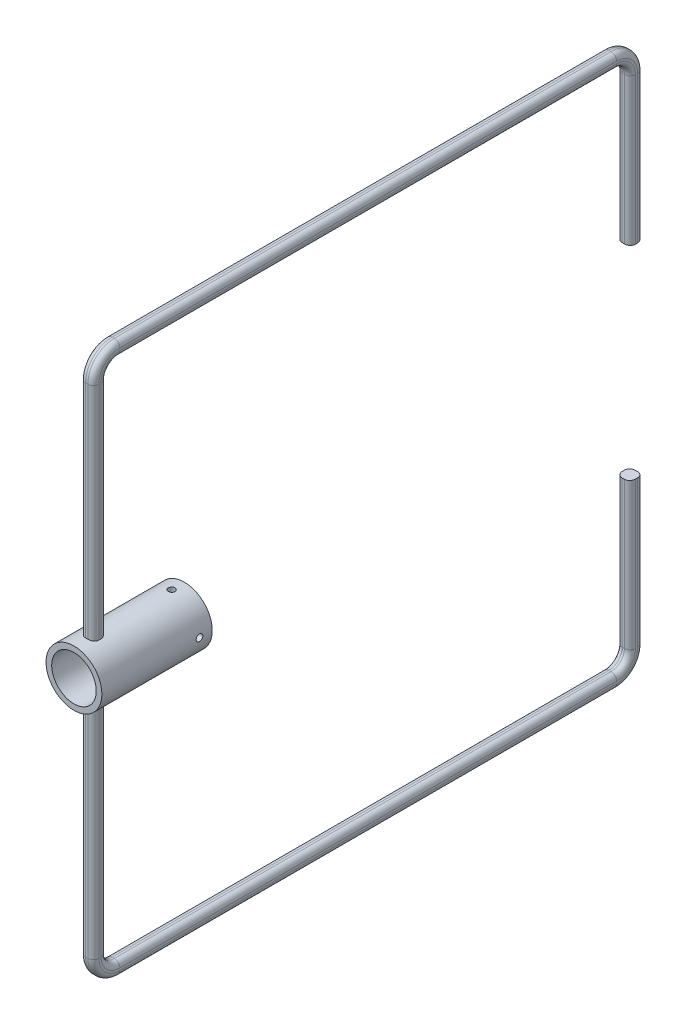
ISO-10303-21;
HEADER;
FILE_DESCRIPTION(('STEP AP214'),'2;1');
FILE_NAME('part.step','',(''),(''),'','','');
FILE_SCHEMA(('AUTOMOTIVE_DESIGN { 1 0 10303 214 1 1 1 1 }'));
ENDSEC;
DATA;
#1=APPLICATION_CONTEXT('core data for automotive mechanical design processes');
#2=APPLICATION_PROTOCOL_DEFINITION('international standard','automotive_design',2000,#1);
#3=PRODUCT_CONTEXT('',#1,'mechanical');
#4=PRODUCT('Part','Part','',(#3));
#5=PRODUCT_RELATED_PRODUCT_CATEGORY('part','',(#4));
#6=PRODUCT_DEFINITION_FORMATION('','',#4);
#7=PRODUCT_DEFINITION_CONTEXT('part definition',#1,'design');
#8=PRODUCT_DEFINITION('design','',#6,#7);
#9=PRODUCT_DEFINITION_SHAPE('','',#8);
#10=(LENGTH_UNIT() NAMED_UNIT(*) SI_UNIT(.MILLI.,.METRE.));
#11=(NAMED_UNIT(*) PLANE_ANGLE_UNIT() SI_UNIT($,.RADIAN.));
#12=(NAMED_UNIT(*) SI_UNIT($,.STERADIAN.) SOLID_ANGLE_UNIT());
#13=UNCERTAINTY_MEASURE_WITH_UNIT(LENGTH_MEASURE(1.E-05),#10,'distance_accuracy_value','');
#14=(GEOMETRIC_REPRESENTATION_CONTEXT(3) GLOBAL_UNCERTAINTY_ASSIGNED_CONTEXT((#13)) GLOBAL_UNIT_ASSIGNED_CONTEXT((#10,
#11,#12)) REPRESENTATION_CONTEXT('',''));
#15=CARTESIAN_POINT('',(0.,0.,0.));
#16=DIRECTION('',(0.,0.,1.));
#17=DIRECTION('',(1.,0.,0.));
#18=AXIS2_PLACEMENT_3D('',#15,#16,#17);
#19=CARTESIAN_POINT('',(-18.89125,148.735230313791,320.9925));
#20=DIRECTION('',(0.,0.,1.));
#21=DIRECTION('',(0.,-1.,0.));
#22=AXIS2_PLACEMENT_3D('',#19,#20,#21);
#23=PLANE('',#22);
#24=CARTESIAN_POINT('',(0.,0.,320.9925));
#25=DIRECTION('',(0.,0.,-1.));
#26=DIRECTION('',(0.,1.,0.));
#27=AXIS2_PLACEMENT_3D('',#24,#25,#26);
#28=CIRCLE('',#27,16.7005);
#29=CARTESIAN_POINT('',(-0.66675,16.6871850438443,320.9925));
#30=VERTEX_POINT('',#29);
#31=CARTESIAN_POINT('',(0.66675,16.6871850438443,320.9925));
#32=VERTEX_POINT('',#31);
#33=EDGE_CURVE('E370',#30,#32,#28,.T.);
#34=ORIENTED_EDGE('',*,*,#33,.F.);
#35=DIRECTION('',(0.,-1.,0.));
#36=VECTOR('',#35,1.);
#37=CARTESIAN_POINT('',(-0.66675,148.735230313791,320.9925));
#38=LINE('',#37,#36);
#39=CARTESIAN_POINT('',(-0.666750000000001,148.735230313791,320.9925));
#40=VERTEX_POINT('',#39);
#41=EDGE_CURVE('E579',#30,#40,#38,.F.);
#42=ORIENTED_EDGE('',*,*,#41,.T.);
#43=DIRECTION('',(1.,0.,0.));
#44=VECTOR('',#43,1.);
#45=CARTESIAN_POINT('',(-18.89125,148.735230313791,320.9925));
#46=LINE('',#45,#44);
#47=CARTESIAN_POINT('',(0.66675,148.735230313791,320.9925));
#48=VERTEX_POINT('',#47);
#49=EDGE_CURVE('E522',#40,#48,#46,.T.);
#50=ORIENTED_EDGE('',*,*,#49,.T.);
#51=DIRECTION('',(0.,1.,0.));
#52=VECTOR('',#51,1.);
#53=CARTESIAN_POINT('',(0.66675,148.735230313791,320.9925));
#54=LINE('',#53,#52);
#55=EDGE_CURVE('E577',#48,#32,#54,.F.);
#56=ORIENTED_EDGE('',*,*,#55,.T.);
#57=EDGE_LOOP('',(#34,#42,#50,#56));
#58=FACE_BOUND('',#57,.T.);
#59=ADVANCED_FACE('F30',(#58),#23,.F.);
#60=CARTESIAN_POINT('',(0.666749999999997,-16.6871850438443,320.9925));
#61=VERTEX_POINT('',#60);
#62=CARTESIAN_POINT('',(-0.666749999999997,-16.6871850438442,320.9925));
#63=VERTEX_POINT('',#62);
#64=EDGE_CURVE('E357',#61,#63,#28,.T.);
#65=ORIENTED_EDGE('',*,*,#64,.F.);
#66=DIRECTION('',(0.,1.,0.));
#67=VECTOR('',#66,1.);
#68=CARTESIAN_POINT('',(0.666749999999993,148.735230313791,320.9925));
#69=LINE('',#68,#67);
#70=CARTESIAN_POINT('',(0.66675,-148.666816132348,320.9925));
#71=VERTEX_POINT('',#70);
#72=EDGE_CURVE('E361',#61,#71,#69,.F.);
#73=ORIENTED_EDGE('',*,*,#72,.T.);
#74=DIRECTION('',(1.,0.,0.));
#75=VECTOR('',#74,1.);
#76=CARTESIAN_POINT('',(-18.89125,-148.666816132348,320.9925));
#77=LINE('',#76,#75);
#78=CARTESIAN_POINT('',(-0.66675,-148.666816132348,320.9925));
#79=VERTEX_POINT('',#78);
#80=EDGE_CURVE('E360',#79,#71,#77,.T.);
#81=ORIENTED_EDGE('',*,*,#80,.F.);
#82=DIRECTION('',(0.,-1.,0.));
#83=VECTOR('',#82,1.);
#84=CARTESIAN_POINT('',(-0.666749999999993,148.735230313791,320.9925));
#85=LINE('',#84,#83);
#86=EDGE_CURVE('E345',#79,#63,#85,.F.);
#87=ORIENTED_EDGE('',*,*,#86,.T.);
#88=EDGE_LOOP('',(#65,#73,#81,#87));
#89=FACE_BOUND('',#88,.T.);
#90=ADVANCED_FACE('F356',(#89),#23,.F.);
#91=CARTESIAN_POINT('',(0.,0.,328.93));
#92=DIRECTION('',(0.,0.,1.));
#93=DIRECTION('',(1.,0.,0.));
#94=AXIS2_PLACEMENT_3D('',#91,#92,#93);
#95=PLANE('',#94);
#96=DIRECTION('',(0.,1.,0.));
#97=VECTOR('',#96,1.);
#98=CARTESIAN_POINT('',(0.666749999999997,-16.2220751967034,328.93));
#99=LINE('',#98,#97);
#100=CARTESIAN_POINT('',(0.66675,-148.666816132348,328.93));
#101=VERTEX_POINT('',#100);
#102=CARTESIAN_POINT('',(0.666749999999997,-16.6871850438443,328.93));
#103=VERTEX_POINT('',#102);
#104=EDGE_CURVE('E51',#101,#103,#99,.T.);
#105=ORIENTED_EDGE('',*,*,#104,.T.);
#106=CARTESIAN_POINT('',(0.,0.,328.93));
#107=DIRECTION('',(0.,0.,1.));
#108=DIRECTION('',(1.,0.,0.));
#109=AXIS2_PLACEMENT_3D('',#106,#107,#108);
#110=CIRCLE('',#109,16.7005);
#111=CARTESIAN_POINT('',(-0.666749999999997,-16.6871850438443,328.93));
#112=VERTEX_POINT('',#111);
#113=EDGE_CURVE('E56',#112,#103,#110,.T.);
#114=ORIENTED_EDGE('',*,*,#113,.F.);
#115=DIRECTION('',(0.,-1.,0.));
#116=VECTOR('',#115,1.);
#117=CARTESIAN_POINT('',(-0.66675,-148.666816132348,328.93));
#118=LINE('',#117,#116);
#119=CARTESIAN_POINT('',(-0.666750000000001,-148.666816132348,328.93));
#120=VERTEX_POINT('',#119);
#121=EDGE_CURVE('E943',#112,#120,#118,.T.);
#122=ORIENTED_EDGE('',*,*,#121,.T.);
#123=DIRECTION('',(1.,0.,0.));
#124=VECTOR('',#123,1.);
#125=CARTESIAN_POINT('',(-18.89125,-148.666816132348,328.93));
#126=LINE('',#125,#124);
#127=EDGE_CURVE('E513',#120,#101,#126,.T.);
#128=ORIENTED_EDGE('',*,*,#127,.T.);
#129=EDGE_LOOP('',(#105,#114,#122,#128));
#130=FACE_BOUND('',#129,.T.);
#131=ADVANCED_FACE('F716',(#130),#95,.T.);
#132=DIRECTION('',(0.,-1.,0.));
#133=VECTOR('',#132,1.);
#134=CARTESIAN_POINT('',(-0.66675,16.2220751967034,328.93));
#135=LINE('',#134,#133);
#136=CARTESIAN_POINT('',(-0.66675,148.735230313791,328.93));
#137=VERTEX_POINT('',#136);
#138=CARTESIAN_POINT('',(-0.66675,16.6871850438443,328.93));
#139=VERTEX_POINT('',#138);
#140=EDGE_CURVE('E1672',#137,#139,#135,.T.);
#141=ORIENTED_EDGE('',*,*,#140,.T.);
#142=CARTESIAN_POINT('',(0.66675,16.6871850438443,328.93));
#143=VERTEX_POINT('',#142);
#144=EDGE_CURVE('E382',#143,#139,#110,.T.);
#145=ORIENTED_EDGE('',*,*,#144,.F.);
#146=DIRECTION('',(0.,1.,0.));
#147=VECTOR('',#146,1.);
#148=CARTESIAN_POINT('',(0.66675,148.735230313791,328.93));
#149=LINE('',#148,#147);
#150=CARTESIAN_POINT('',(0.666750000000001,148.735230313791,328.93));
#151=VERTEX_POINT('',#150);
#152=EDGE_CURVE('E1674',#143,#151,#149,.T.);
#153=ORIENTED_EDGE('',*,*,#152,.T.);
#154=DIRECTION('',(1.,0.,0.));
#155=VECTOR('',#154,1.);
#156=CARTESIAN_POINT('',(-18.89125,148.735230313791,328.93));
#157=LINE('',#156,#155);
#158=EDGE_CURVE('E510',#137,#151,#157,.T.);
#159=ORIENTED_EDGE('',*,*,#158,.F.);
#160=EDGE_LOOP('',(#141,#145,#153,#159));
#161=FACE_BOUND('',#160,.T.);
#162=ADVANCED_FACE('F1571',(#161),#95,.T.);
#163=CARTESIAN_POINT('',(0.,0.,0.));
#164=DIRECTION('',(0.,0.,1.));
#165=DIRECTION('',(1.,0.,0.));
#166=AXIS2_PLACEMENT_3D('',#163,#164,#165);
#167=PLANE('',#166);
#168=CARTESIAN_POINT('',(0.,0.,0.));
#169=DIRECTION('',(0.,0.,-1.));
#170=DIRECTION('',(-1.,0.,0.));
#171=AXIS2_PLACEMENT_3D('',#168,#169,#170);
#172=CIRCLE('',#171,60.96);
#173=CARTESIAN_POINT('',(-0.66675,60.9563536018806,0.));
#174=VERTEX_POINT('',#173);
#175=CARTESIAN_POINT('',(0.66675,60.9563536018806,0.));
#176=VERTEX_POINT('',#175);
#177=EDGE_CURVE('E483',#174,#176,#172,.T.);
#178=ORIENTED_EDGE('',*,*,#177,.F.);
#179=DIRECTION('',(0.,-1.,0.));
#180=VECTOR('',#179,1.);
#181=CARTESIAN_POINT('',(-0.66675,0.,0.));
#182=LINE('',#181,#180);
#183=CARTESIAN_POINT('',(-0.666750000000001,148.735230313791,0.));
#184=VERTEX_POINT('',#183);
#185=EDGE_CURVE('E1689',#174,#184,#182,.F.);
#186=ORIENTED_EDGE('',*,*,#185,.T.);
#187=DIRECTION('',(1.,0.,0.));
#188=VECTOR('',#187,1.);
#189=CARTESIAN_POINT('',(-18.89125,148.735230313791,0.));
#190=LINE('',#189,#188);
#191=CARTESIAN_POINT('',(0.66675,148.735230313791,0.));
#192=VERTEX_POINT('',#191);
#193=EDGE_CURVE('E501',#184,#192,#190,.T.);
#194=ORIENTED_EDGE('',*,*,#193,.T.);
#195=DIRECTION('',(0.,1.,0.));
#196=VECTOR('',#195,1.);
#197=CARTESIAN_POINT('',(0.66675,0.,0.));
#198=LINE('',#197,#196);
#199=EDGE_CURVE('E1690',#192,#176,#198,.F.);
#200=ORIENTED_EDGE('',*,*,#199,.T.);
#201=EDGE_LOOP('',(#178,#186,#194,#200));
#202=FACE_BOUND('',#201,.T.);
#203=ADVANCED_FACE('F803',(#202),#167,.F.);
#204=CARTESIAN_POINT('',(0.666749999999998,-60.9563536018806,0.));
#205=VERTEX_POINT('',#204);
#206=CARTESIAN_POINT('',(-0.666749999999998,-60.9563536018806,0.));
#207=VERTEX_POINT('',#206);
#208=EDGE_CURVE('E480',#205,#207,#172,.T.);
#209=ORIENTED_EDGE('',*,*,#208,.F.);
#210=DIRECTION('',(0.,1.,0.));
#211=VECTOR('',#210,1.);
#212=CARTESIAN_POINT('',(0.666749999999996,0.,0.));
#213=LINE('',#212,#211);
#214=CARTESIAN_POINT('',(0.666750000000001,-148.666816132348,0.));
#215=VERTEX_POINT('',#214);
#216=EDGE_CURVE('E929',#205,#215,#213,.F.);
#217=ORIENTED_EDGE('',*,*,#216,.T.);
#218=DIRECTION('',(1.,0.,0.));
#219=VECTOR('',#218,1.);
#220=CARTESIAN_POINT('',(-18.89125,-148.666816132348,0.));
#221=LINE('',#220,#219);
#222=CARTESIAN_POINT('',(-0.66675,-148.666816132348,0.));
#223=VERTEX_POINT('',#222);
#224=EDGE_CURVE('E497',#223,#215,#221,.T.);
#225=ORIENTED_EDGE('',*,*,#224,.F.);
#226=DIRECTION('',(0.,-1.,0.));
#227=VECTOR('',#226,1.);
#228=CARTESIAN_POINT('',(-0.666749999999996,0.,0.));
#229=LINE('',#228,#227);
#230=EDGE_CURVE('E927',#223,#207,#229,.F.);
#231=ORIENTED_EDGE('',*,*,#230,.T.);
#232=EDGE_LOOP('',(#209,#217,#225,#231));
#233=FACE_BOUND('',#232,.T.);
#234=ADVANCED_FACE('F870',(#233),#167,.F.);
#235=CARTESIAN_POINT('',(-18.89125,-148.666816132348,7.9375));
#236=DIRECTION('',(0.,0.,-1.));
#237=DIRECTION('',(-1.,0.,0.));
#238=AXIS2_PLACEMENT_3D('',#235,#236,#237);
#239=PLANE('',#238);
#240=DIRECTION('',(1.,0.,0.));
#241=VECTOR('',#240,1.);
#242=CARTESIAN_POINT('',(-18.89125,148.735230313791,7.9375));
#243=LINE('',#242,#241);
#244=CARTESIAN_POINT('',(-0.66675,148.735230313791,7.9375));
#245=VERTEX_POINT('',#244);
#246=CARTESIAN_POINT('',(0.666750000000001,148.735230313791,7.9375));
#247=VERTEX_POINT('',#246);
#248=EDGE_CURVE('E531',#245,#247,#243,.T.);
#249=ORIENTED_EDGE('',*,*,#248,.F.);
#250=DIRECTION('',(0.,1.,0.));
#251=VECTOR('',#250,1.);
#252=CARTESIAN_POINT('',(-0.66675,-148.666816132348,7.9375));
#253=LINE('',#252,#251);
#254=CARTESIAN_POINT('',(-0.66675,60.9563536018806,7.9375));
#255=VERTEX_POINT('',#254);
#256=EDGE_CURVE('E595',#245,#255,#253,.F.);
#257=ORIENTED_EDGE('',*,*,#256,.T.);
#258=CARTESIAN_POINT('',(0.,0.,7.9375));
#259=DIRECTION('',(0.,0.,-1.));
#260=DIRECTION('',(-1.,0.,0.));
#261=AXIS2_PLACEMENT_3D('',#258,#259,#260);
#262=CIRCLE('',#261,60.96);
#263=CARTESIAN_POINT('',(0.66675,60.9563536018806,7.9375));
#264=VERTEX_POINT('',#263);
#265=EDGE_CURVE('E554',#255,#264,#262,.T.);
#266=ORIENTED_EDGE('',*,*,#265,.T.);
#267=DIRECTION('',(0.,-1.,0.));
#268=VECTOR('',#267,1.);
#269=CARTESIAN_POINT('',(0.66675,-148.666816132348,7.9375));
#270=LINE('',#269,#268);
#271=EDGE_CURVE('E593',#264,#247,#270,.F.);
#272=ORIENTED_EDGE('',*,*,#271,.T.);
#273=EDGE_LOOP('',(#249,#257,#266,#272));
#274=FACE_BOUND('',#273,.T.);
#275=ADVANCED_FACE('F866',(#274),#239,.F.);
#276=DIRECTION('',(1.,0.,0.));
#277=VECTOR('',#276,1.);
#278=CARTESIAN_POINT('',(-18.89125,-148.666816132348,7.93749999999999));
#279=LINE('',#278,#277);
#280=CARTESIAN_POINT('',(-0.666750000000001,-148.666816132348,7.93749999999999));
#281=VERTEX_POINT('',#280);
#282=CARTESIAN_POINT('',(0.666750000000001,-148.666816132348,7.93749999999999));
#283=VERTEX_POINT('',#282);
#284=EDGE_CURVE('E534',#281,#283,#279,.T.);
#285=ORIENTED_EDGE('',*,*,#284,.T.);
#286=DIRECTION('',(0.,-1.,0.));
#287=VECTOR('',#286,1.);
#288=CARTESIAN_POINT('',(0.66675,-148.666816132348,7.9375));
#289=LINE('',#288,#287);
#290=CARTESIAN_POINT('',(0.666749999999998,-60.9563536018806,7.9375));
#291=VERTEX_POINT('',#290);
#292=EDGE_CURVE('E987',#283,#291,#289,.F.);
#293=ORIENTED_EDGE('',*,*,#292,.T.);
#294=CARTESIAN_POINT('',(-0.666749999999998,-60.9563536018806,7.9375));
#295=VERTEX_POINT('',#294);
#296=EDGE_CURVE('E551',#291,#295,#262,.T.);
#297=ORIENTED_EDGE('',*,*,#296,.T.);
#298=DIRECTION('',(0.,1.,0.));
#299=VECTOR('',#298,1.);
#300=CARTESIAN_POINT('',(-0.66675,-148.666816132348,7.9375));
#301=LINE('',#300,#299);
#302=EDGE_CURVE('E986',#295,#281,#301,.F.);
#303=ORIENTED_EDGE('',*,*,#302,.T.);
#304=EDGE_LOOP('',(#285,#293,#297,#303));
#305=FACE_BOUND('',#304,.T.);
#306=ADVANCED_FACE('F869',(#305),#239,.F.);
#307=CARTESIAN_POINT('',(-3.96875,-165.052291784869,328.93));
#308=DIRECTION('',(1.,0.,0.));
#309=DIRECTION('',(0.,1.,0.));
#310=AXIS2_PLACEMENT_3D('',#307,#308,#309);
#311=PLANE('',#310);
#312=CARTESIAN_POINT('',(-3.96875,-148.666816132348,15.875));
#313=DIRECTION('',(1.,0.,0.));
#314=DIRECTION('',(0.,1.,0.));
#315=AXIS2_PLACEMENT_3D('',#312,#313,#314);
#316=CIRCLE('',#315,11.2395);
#317=CARTESIAN_POINT('',(-3.96875,-159.906316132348,15.8750000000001));
#318=VERTEX_POINT('',#317);
#319=CARTESIAN_POINT('',(-3.96875,-148.666816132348,4.63549999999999));
#320=VERTEX_POINT('',#319);
#321=EDGE_CURVE('E922',#318,#320,#316,.T.);
#322=ORIENTED_EDGE('',*,*,#321,.T.);
#323=DIRECTION('',(0.,1.,0.));
#324=VECTOR('',#323,1.);
#325=CARTESIAN_POINT('',(-3.96875,-165.052291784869,4.63550000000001));
#326=LINE('',#325,#324);
#327=CARTESIAN_POINT('',(-3.96875,-60.8306717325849,4.63550000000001));
#328=VERTEX_POINT('',#327);
#329=EDGE_CURVE('E924',#320,#328,#326,.T.);
#330=ORIENTED_EDGE('',*,*,#329,.T.);
#331=DIRECTION('',(0.,0.,-1.));
#332=VECTOR('',#331,1.);
#333=CARTESIAN_POINT('',(-3.96875,-60.8306717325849,22.86));
#334=LINE('',#333,#332);
#335=CARTESIAN_POINT('',(-3.96875,-60.8306717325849,3.30200000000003));
#336=VERTEX_POINT('',#335);
#337=EDGE_CURVE('E487',#328,#336,#334,.T.);
#338=ORIENTED_EDGE('',*,*,#337,.T.);
#339=DIRECTION('',(0.,-1.,0.));
#340=VECTOR('',#339,1.);
#341=CARTESIAN_POINT('',(-3.96875,-165.052291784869,3.30200000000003));
#342=LINE('',#341,#340);
#343=CARTESIAN_POINT('',(-3.96875,-148.666816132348,3.30200000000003));
#344=VERTEX_POINT('',#343);
#345=EDGE_CURVE('E907',#336,#344,#342,.T.);
#346=ORIENTED_EDGE('',*,*,#345,.T.);
#347=CARTESIAN_POINT('',(-3.96875,-148.666816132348,15.875));
#348=DIRECTION('',(1.,0.,0.));
#349=DIRECTION('',(0.,1.,0.));
#350=AXIS2_PLACEMENT_3D('',#347,#348,#349);
#351=CIRCLE('',#350,12.573);
#352=CARTESIAN_POINT('',(-3.96875,-161.239816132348,15.8750000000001));
#353=VERTEX_POINT('',#352);
#354=EDGE_CURVE('E909',#344,#353,#351,.F.);
#355=ORIENTED_EDGE('',*,*,#354,.T.);
#356=DIRECTION('',(0.,0.,-1.));
#357=VECTOR('',#356,1.);
#358=CARTESIAN_POINT('',(-3.96875,-161.239816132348,313.055));
#359=LINE('',#358,#357);
#360=CARTESIAN_POINT('',(-3.96875,-161.239816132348,313.055));
#361=VERTEX_POINT('',#360);
#362=EDGE_CURVE('E911',#353,#361,#359,.F.);
#363=ORIENTED_EDGE('',*,*,#362,.T.);
#364=CARTESIAN_POINT('',(-3.96875,-148.666816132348,313.055));
#365=DIRECTION('',(1.,0.,0.));
#366=DIRECTION('',(0.,1.,0.));
#367=AXIS2_PLACEMENT_3D('',#364,#365,#366);
#368=CIRCLE('',#367,12.573);
#369=CARTESIAN_POINT('',(-3.96875,-148.666816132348,325.628));
#370=VERTEX_POINT('',#369);
#371=EDGE_CURVE('E913',#361,#370,#368,.F.);
#372=ORIENTED_EDGE('',*,*,#371,.T.);
#373=DIRECTION('',(0.,-1.,0.));
#374=VECTOR('',#373,1.);
#375=CARTESIAN_POINT('',(-3.96875,-16.2220751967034,325.628));
#376=LINE('',#375,#374);
#377=CARTESIAN_POINT('',(-3.96875,-16.2220751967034,325.628));
#378=VERTEX_POINT('',#377);
#379=EDGE_CURVE('E915',#370,#378,#376,.F.);
#380=ORIENTED_EDGE('',*,*,#379,.T.);
#381=DIRECTION('',(0.,0.,-1.));
#382=VECTOR('',#381,1.);
#383=CARTESIAN_POINT('',(-3.96875,-16.2220751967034,328.93));
#384=LINE('',#383,#382);
#385=CARTESIAN_POINT('',(-3.96875,-16.2220751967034,324.2945));
#386=VERTEX_POINT('',#385);
#387=EDGE_CURVE('E549',#378,#386,#384,.T.);
#388=ORIENTED_EDGE('',*,*,#387,.T.);
#389=DIRECTION('',(0.,-1.,0.));
#390=VECTOR('',#389,1.);
#391=CARTESIAN_POINT('',(-3.96875,-165.052291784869,324.2945));
#392=LINE('',#391,#390);
#393=CARTESIAN_POINT('',(-3.96875,-148.666816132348,324.2945));
#394=VERTEX_POINT('',#393);
#395=EDGE_CURVE('E347',#386,#394,#392,.T.);
#396=ORIENTED_EDGE('',*,*,#395,.T.);
#397=CARTESIAN_POINT('',(-3.96875,-148.666816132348,313.055));
#398=DIRECTION('',(1.,0.,0.));
#399=DIRECTION('',(0.,1.,0.));
#400=AXIS2_PLACEMENT_3D('',#397,#398,#399);
#401=CIRCLE('',#400,11.2395);
#402=CARTESIAN_POINT('',(-3.96875,-159.906316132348,313.055));
#403=VERTEX_POINT('',#402);
#404=EDGE_CURVE('E918',#394,#403,#401,.T.);
#405=ORIENTED_EDGE('',*,*,#404,.T.);
#406=DIRECTION('',(0.,0.,-1.));
#407=VECTOR('',#406,1.);
#408=CARTESIAN_POINT('',(-3.96875,-159.906316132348,328.93));
#409=LINE('',#408,#407);
#410=EDGE_CURVE('E920',#403,#318,#409,.T.);
#411=ORIENTED_EDGE('',*,*,#410,.T.);
#412=EDGE_LOOP('',(#322,#330,#338,#346,#355,#363,#372,#380,#388,#396,#405,#411));
#413=FACE_BOUND('',#412,.T.);
#414=ADVANCED_FACE('F32',(#413),#311,.F.);
#415=CARTESIAN_POINT('',(3.96875,-165.052291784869,328.93));
#416=DIRECTION('',(-1.,0.,0.));
#417=DIRECTION('',(0.,-1.,0.));
#418=AXIS2_PLACEMENT_3D('',#415,#416,#417);
#419=PLANE('',#418);
#420=DIRECTION('',(0.,0.,-1.));
#421=VECTOR('',#420,1.);
#422=CARTESIAN_POINT('',(3.96875,-60.8306717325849,22.86));
#423=LINE('',#422,#421);
#424=CARTESIAN_POINT('',(3.96875,-60.8306717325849,3.30200000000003));
#425=VERTEX_POINT('',#424);
#426=CARTESIAN_POINT('',(3.96875,-60.8306717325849,4.63550000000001));
#427=VERTEX_POINT('',#426);
#428=EDGE_CURVE('E484',#425,#427,#423,.F.);
#429=ORIENTED_EDGE('',*,*,#428,.T.);
#430=DIRECTION('',(0.,-1.,0.));
#431=VECTOR('',#430,1.);
#432=CARTESIAN_POINT('',(3.96875,-165.052291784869,4.63550000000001));
#433=LINE('',#432,#431);
#434=CARTESIAN_POINT('',(3.96875,-148.666816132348,4.63549999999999));
#435=VERTEX_POINT('',#434);
#436=EDGE_CURVE('E983',#427,#435,#433,.T.);
#437=ORIENTED_EDGE('',*,*,#436,.T.);
#438=CARTESIAN_POINT('',(3.96875,-148.666816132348,15.875));
#439=DIRECTION('',(-1.,0.,0.));
#440=DIRECTION('',(0.,-1.,0.));
#441=AXIS2_PLACEMENT_3D('',#438,#439,#440);
#442=CIRCLE('',#441,11.2395);
#443=CARTESIAN_POINT('',(3.96875,-159.906316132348,15.8750000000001));
#444=VERTEX_POINT('',#443);
#445=EDGE_CURVE('E981',#435,#444,#442,.T.);
#446=ORIENTED_EDGE('',*,*,#445,.T.);
#447=DIRECTION('',(0.,0.,1.));
#448=VECTOR('',#447,1.);
#449=CARTESIAN_POINT('',(3.96875,-159.906316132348,328.93));
#450=LINE('',#449,#448);
#451=CARTESIAN_POINT('',(3.96875,-159.906316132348,313.055));
#452=VERTEX_POINT('',#451);
#453=EDGE_CURVE('E979',#444,#452,#450,.T.);
#454=ORIENTED_EDGE('',*,*,#453,.T.);
#455=CARTESIAN_POINT('',(3.96875,-148.666816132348,313.055));
#456=DIRECTION('',(-1.,0.,0.));
#457=DIRECTION('',(0.,-1.,0.));
#458=AXIS2_PLACEMENT_3D('',#455,#456,#457);
#459=CIRCLE('',#458,11.2395);
#460=CARTESIAN_POINT('',(3.96875,-148.666816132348,324.2945));
#461=VERTEX_POINT('',#460);
#462=EDGE_CURVE('E892',#452,#461,#459,.T.);
#463=ORIENTED_EDGE('',*,*,#462,.T.);
#464=DIRECTION('',(0.,1.,0.));
#465=VECTOR('',#464,1.);
#466=CARTESIAN_POINT('',(3.96875,-165.052291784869,324.2945));
#467=LINE('',#466,#465);
#468=CARTESIAN_POINT('',(3.96875,-16.2220751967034,324.2945));
#469=VERTEX_POINT('',#468);
#470=EDGE_CURVE('E976',#461,#469,#467,.T.);
#471=ORIENTED_EDGE('',*,*,#470,.T.);
#472=DIRECTION('',(0.,0.,-1.));
#473=VECTOR('',#472,1.);
#474=CARTESIAN_POINT('',(3.96875,-16.2220751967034,328.93));
#475=LINE('',#474,#473);
#476=CARTESIAN_POINT('',(3.96875,-16.2220751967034,325.628));
#477=VERTEX_POINT('',#476);
#478=EDGE_CURVE('E547',#477,#469,#475,.T.);
#479=ORIENTED_EDGE('',*,*,#478,.F.);
#480=DIRECTION('',(0.,1.,0.));
#481=VECTOR('',#480,1.);
#482=CARTESIAN_POINT('',(3.96875,-148.666816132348,325.628));
#483=LINE('',#482,#481);
#484=CARTESIAN_POINT('',(3.96875,-148.666816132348,325.628));
#485=VERTEX_POINT('',#484);
#486=EDGE_CURVE('E971',#477,#485,#483,.F.);
#487=ORIENTED_EDGE('',*,*,#486,.T.);
#488=CARTESIAN_POINT('',(3.96875,-148.666816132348,313.055));
#489=DIRECTION('',(-1.,0.,0.));
#490=DIRECTION('',(0.,-1.,0.));
#491=AXIS2_PLACEMENT_3D('',#488,#489,#490);
#492=CIRCLE('',#491,12.573);
#493=CARTESIAN_POINT('',(3.96875,-161.239816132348,313.055));
#494=VERTEX_POINT('',#493);
#495=EDGE_CURVE('E967',#485,#494,#492,.F.);
#496=ORIENTED_EDGE('',*,*,#495,.T.);
#497=DIRECTION('',(0.,0.,1.));
#498=VECTOR('',#497,1.);
#499=CARTESIAN_POINT('',(3.96875,-161.239816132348,15.8750000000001));
#500=LINE('',#499,#498);
#501=CARTESIAN_POINT('',(3.96875,-161.239816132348,15.8750000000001));
#502=VERTEX_POINT('',#501);
#503=EDGE_CURVE('E963',#494,#502,#500,.F.);
#504=ORIENTED_EDGE('',*,*,#503,.T.);
#505=CARTESIAN_POINT('',(3.96875,-148.666816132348,15.875));
#506=DIRECTION('',(-1.,0.,0.));
#507=DIRECTION('',(0.,-1.,0.));
#508=AXIS2_PLACEMENT_3D('',#505,#506,#507);
#509=CIRCLE('',#508,12.573);
#510=CARTESIAN_POINT('',(3.96875,-148.666816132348,3.302));
#511=VERTEX_POINT('',#510);
#512=EDGE_CURVE('E966',#502,#511,#509,.F.);
#513=ORIENTED_EDGE('',*,*,#512,.T.);
#514=DIRECTION('',(0.,1.,0.));
#515=VECTOR('',#514,1.);
#516=CARTESIAN_POINT('',(3.96875,-165.052291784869,3.30200000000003));
#517=LINE('',#516,#515);
#518=EDGE_CURVE('E969',#511,#425,#517,.T.);
#519=ORIENTED_EDGE('',*,*,#518,.T.);
#520=EDGE_LOOP('',(#429,#437,#446,#454,#463,#471,#479,#487,#496,#504,#513,#519));
#521=FACE_BOUND('',#520,.T.);
#522=ADVANCED_FACE('F1039',(#521),#419,.F.);
#523=CARTESIAN_POINT('',(3.96875,16.2220751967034,328.93));
#524=DIRECTION('',(-1.,0.,0.));
#525=DIRECTION('',(0.,0.,1.));
#526=AXIS2_PLACEMENT_3D('',#523,#524,#525);
#527=PLANE('',#526);
#528=CARTESIAN_POINT('',(3.96875,148.735230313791,15.875));
#529=DIRECTION('',(-1.,0.,0.));
#530=DIRECTION('',(0.,0.,1.));
#531=AXIS2_PLACEMENT_3D('',#528,#529,#530);
#532=CIRCLE('',#531,11.2395);
#533=CARTESIAN_POINT('',(3.96875,159.974730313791,15.8750000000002));
#534=VERTEX_POINT('',#533);
#535=CARTESIAN_POINT('',(3.96875,148.735230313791,4.63550000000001));
#536=VERTEX_POINT('',#535);
#537=EDGE_CURVE('E1651',#534,#536,#532,.T.);
#538=ORIENTED_EDGE('',*,*,#537,.T.);
#539=DIRECTION('',(0.,-1.,0.));
#540=VECTOR('',#539,1.);
#541=CARTESIAN_POINT('',(3.96875,16.2220751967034,4.63550000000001));
#542=LINE('',#541,#540);
#543=CARTESIAN_POINT('',(3.96875,60.8306717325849,4.63550000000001));
#544=VERTEX_POINT('',#543);
#545=EDGE_CURVE('E1649',#536,#544,#542,.T.);
#546=ORIENTED_EDGE('',*,*,#545,.T.);
#547=DIRECTION('',(0.,0.,-1.));
#548=VECTOR('',#547,1.);
#549=CARTESIAN_POINT('',(3.96875,60.8306717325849,22.86));
#550=LINE('',#549,#548);
#551=CARTESIAN_POINT('',(3.96875,60.8306717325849,3.30200000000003));
#552=VERTEX_POINT('',#551);
#553=EDGE_CURVE('E493',#544,#552,#550,.T.);
#554=ORIENTED_EDGE('',*,*,#553,.T.);
#555=DIRECTION('',(0.,1.,0.));
#556=VECTOR('',#555,1.);
#557=CARTESIAN_POINT('',(3.96875,16.2220751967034,3.30200000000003));
#558=LINE('',#557,#556);
#559=CARTESIAN_POINT('',(3.96875,148.735230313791,3.30200000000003));
#560=VERTEX_POINT('',#559);
#561=EDGE_CURVE('E1670',#552,#560,#558,.T.);
#562=ORIENTED_EDGE('',*,*,#561,.T.);
#563=CARTESIAN_POINT('',(3.96875,148.735230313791,15.875));
#564=DIRECTION('',(-1.,0.,0.));
#565=DIRECTION('',(0.,0.,1.));
#566=AXIS2_PLACEMENT_3D('',#563,#564,#565);
#567=CIRCLE('',#566,12.573);
#568=CARTESIAN_POINT('',(3.96875,161.308230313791,15.8750000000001));
#569=VERTEX_POINT('',#568);
#570=EDGE_CURVE('E1668',#560,#569,#567,.F.);
#571=ORIENTED_EDGE('',*,*,#570,.T.);
#572=DIRECTION('',(0.,0.,-1.));
#573=VECTOR('',#572,1.);
#574=CARTESIAN_POINT('',(3.96875,161.308230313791,313.055));
#575=LINE('',#574,#573);
#576=CARTESIAN_POINT('',(3.96875,161.308230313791,313.055));
#577=VERTEX_POINT('',#576);
#578=EDGE_CURVE('E1666',#569,#577,#575,.F.);
#579=ORIENTED_EDGE('',*,*,#578,.T.);
#580=CARTESIAN_POINT('',(3.96875,148.735230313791,313.055));
#581=DIRECTION('',(-1.,0.,0.));
#582=DIRECTION('',(0.,0.,1.));
#583=AXIS2_PLACEMENT_3D('',#580,#581,#582);
#584=CIRCLE('',#583,12.573);
#585=CARTESIAN_POINT('',(3.96875,148.735230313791,325.628));
#586=VERTEX_POINT('',#585);
#587=EDGE_CURVE('E1664',#577,#586,#584,.F.);
#588=ORIENTED_EDGE('',*,*,#587,.T.);
#589=DIRECTION('',(0.,1.,0.));
#590=VECTOR('',#589,1.);
#591=CARTESIAN_POINT('',(3.96875,16.2220751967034,325.628));
#592=LINE('',#591,#590);
#593=CARTESIAN_POINT('',(3.96875,16.2220751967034,325.628));
#594=VERTEX_POINT('',#593);
#595=EDGE_CURVE('E1662',#586,#594,#592,.F.);
#596=ORIENTED_EDGE('',*,*,#595,.T.);
#597=DIRECTION('',(0.,0.,-1.));
#598=VECTOR('',#597,1.);
#599=CARTESIAN_POINT('',(3.96875,16.2220751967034,328.93));
#600=LINE('',#599,#598);
#601=CARTESIAN_POINT('',(3.96875,16.2220751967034,324.2945));
#602=VERTEX_POINT('',#601);
#603=EDGE_CURVE('E544',#594,#602,#600,.T.);
#604=ORIENTED_EDGE('',*,*,#603,.T.);
#605=DIRECTION('',(0.,1.,0.));
#606=VECTOR('',#605,1.);
#607=CARTESIAN_POINT('',(3.96875,16.2220751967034,324.2945));
#608=LINE('',#607,#606);
#609=CARTESIAN_POINT('',(3.96875,148.735230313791,324.2945));
#610=VERTEX_POINT('',#609);
#611=EDGE_CURVE('E1660',#602,#610,#608,.T.);
#612=ORIENTED_EDGE('',*,*,#611,.T.);
#613=CARTESIAN_POINT('',(3.96875,148.735230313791,313.055));
#614=DIRECTION('',(-1.,0.,0.));
#615=DIRECTION('',(0.,0.,1.));
#616=AXIS2_PLACEMENT_3D('',#613,#614,#615);
#617=CIRCLE('',#616,11.2395);
#618=CARTESIAN_POINT('',(3.96875,159.974730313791,313.055));
#619=VERTEX_POINT('',#618);
#620=EDGE_CURVE('E1658',#610,#619,#617,.T.);
#621=ORIENTED_EDGE('',*,*,#620,.T.);
#622=DIRECTION('',(0.,0.,-1.));
#623=VECTOR('',#622,1.);
#624=CARTESIAN_POINT('',(3.96875,159.974730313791,328.93));
#625=LINE('',#624,#623);
#626=EDGE_CURVE('E1654',#619,#534,#625,.T.);
#627=ORIENTED_EDGE('',*,*,#626,.T.);
#628=EDGE_LOOP('',(#538,#546,#554,#562,#571,#579,#588,#596,#604,#612,#621,#627));
#629=FACE_BOUND('',#628,.T.);
#630=ADVANCED_FACE('F1622',(#629),#527,.F.);
#631=CARTESIAN_POINT('',(-3.96875,16.2220751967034,328.93));
#632=DIRECTION('',(1.,0.,0.));
#633=DIRECTION('',(0.,0.,-1.));
#634=AXIS2_PLACEMENT_3D('',#631,#632,#633);
#635=PLANE('',#634);
#636=CARTESIAN_POINT('',(-3.96875,148.735230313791,313.055));
#637=DIRECTION('',(1.,0.,0.));
#638=DIRECTION('',(0.,0.,-1.));
#639=AXIS2_PLACEMENT_3D('',#636,#637,#638);
#640=CIRCLE('',#639,11.2395);
#641=CARTESIAN_POINT('',(-3.96875,159.974730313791,313.055));
#642=VERTEX_POINT('',#641);
#643=CARTESIAN_POINT('',(-3.96875,148.735230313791,324.2945));
#644=VERTEX_POINT('',#643);
#645=EDGE_CURVE('E572',#642,#644,#640,.T.);
#646=ORIENTED_EDGE('',*,*,#645,.T.);
#647=DIRECTION('',(0.,-1.,0.));
#648=VECTOR('',#647,1.);
#649=CARTESIAN_POINT('',(-3.96875,16.2220751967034,324.2945));
#650=LINE('',#649,#648);
#651=CARTESIAN_POINT('',(-3.96875,16.2220751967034,324.2945));
#652=VERTEX_POINT('',#651);
#653=EDGE_CURVE('E574',#644,#652,#650,.T.);
#654=ORIENTED_EDGE('',*,*,#653,.T.);
#655=DIRECTION('',(0.,0.,-1.));
#656=VECTOR('',#655,1.);
#657=CARTESIAN_POINT('',(-3.96875,16.2220751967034,328.93));
#658=LINE('',#657,#656);
#659=CARTESIAN_POINT('',(-3.96875,16.2220751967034,325.628));
#660=VERTEX_POINT('',#659);
#661=EDGE_CURVE('E521',#660,#652,#658,.T.);
#662=ORIENTED_EDGE('',*,*,#661,.F.);
#663=DIRECTION('',(0.,-1.,0.));
#664=VECTOR('',#663,1.);
#665=CARTESIAN_POINT('',(-3.96875,148.735230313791,325.628));
#666=LINE('',#665,#664);
#667=CARTESIAN_POINT('',(-3.96875,148.735230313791,325.628));
#668=VERTEX_POINT('',#667);
#669=EDGE_CURVE('E555',#660,#668,#666,.F.);
#670=ORIENTED_EDGE('',*,*,#669,.T.);
#671=CARTESIAN_POINT('',(-3.96875,148.735230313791,313.055));
#672=DIRECTION('',(1.,0.,0.));
#673=DIRECTION('',(0.,0.,-1.));
#674=AXIS2_PLACEMENT_3D('',#671,#672,#673);
#675=CIRCLE('',#674,12.573);
#676=CARTESIAN_POINT('',(-3.96875,161.308230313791,313.055));
#677=VERTEX_POINT('',#676);
#678=EDGE_CURVE('E557',#668,#677,#675,.F.);
#679=ORIENTED_EDGE('',*,*,#678,.T.);
#680=DIRECTION('',(0.,0.,1.));
#681=VECTOR('',#680,1.);
#682=CARTESIAN_POINT('',(-3.96875,161.308230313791,15.8750000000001));
#683=LINE('',#682,#681);
#684=CARTESIAN_POINT('',(-3.96875,161.308230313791,15.8750000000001));
#685=VERTEX_POINT('',#684);
#686=EDGE_CURVE('E559',#677,#685,#683,.F.);
#687=ORIENTED_EDGE('',*,*,#686,.T.);
#688=CARTESIAN_POINT('',(-3.96875,148.735230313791,15.875));
#689=DIRECTION('',(1.,0.,0.));
#690=DIRECTION('',(0.,0.,-1.));
#691=AXIS2_PLACEMENT_3D('',#688,#689,#690);
#692=CIRCLE('',#691,12.573);
#693=CARTESIAN_POINT('',(-3.96875,148.735230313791,3.302));
#694=VERTEX_POINT('',#693);
#695=EDGE_CURVE('E561',#685,#694,#692,.F.);
#696=ORIENTED_EDGE('',*,*,#695,.T.);
#697=DIRECTION('',(0.,-1.,0.));
#698=VECTOR('',#697,1.);
#699=CARTESIAN_POINT('',(-3.96875,16.2220751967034,3.30200000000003));
#700=LINE('',#699,#698);
#701=CARTESIAN_POINT('',(-3.96875,60.8306717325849,3.30200000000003));
#702=VERTEX_POINT('',#701);
#703=EDGE_CURVE('E563',#694,#702,#700,.T.);
#704=ORIENTED_EDGE('',*,*,#703,.T.);
#705=DIRECTION('',(0.,0.,-1.));
#706=VECTOR('',#705,1.);
#707=CARTESIAN_POINT('',(-3.96875,60.8306717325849,22.86));
#708=LINE('',#707,#706);
#709=CARTESIAN_POINT('',(-3.96875,60.8306717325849,4.63550000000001));
#710=VERTEX_POINT('',#709);
#711=EDGE_CURVE('E490',#702,#710,#708,.F.);
#712=ORIENTED_EDGE('',*,*,#711,.T.);
#713=DIRECTION('',(0.,1.,0.));
#714=VECTOR('',#713,1.);
#715=CARTESIAN_POINT('',(-3.96875,16.2220751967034,4.63550000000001));
#716=LINE('',#715,#714);
#717=CARTESIAN_POINT('',(-3.96875,148.735230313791,4.63550000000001));
#718=VERTEX_POINT('',#717);
#719=EDGE_CURVE('E566',#710,#718,#716,.T.);
#720=ORIENTED_EDGE('',*,*,#719,.T.);
#721=CARTESIAN_POINT('',(-3.96875,148.735230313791,15.875));
#722=DIRECTION('',(1.,0.,0.));
#723=DIRECTION('',(0.,0.,-1.));
#724=AXIS2_PLACEMENT_3D('',#721,#722,#723);
#725=CIRCLE('',#724,11.2395);
#726=CARTESIAN_POINT('',(-3.96875,159.974730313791,15.8750000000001));
#727=VERTEX_POINT('',#726);
#728=EDGE_CURVE('E568',#718,#727,#725,.T.);
#729=ORIENTED_EDGE('',*,*,#728,.T.);
#730=DIRECTION('',(0.,0.,1.));
#731=VECTOR('',#730,1.);
#732=CARTESIAN_POINT('',(-3.96875,159.974730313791,328.93));
#733=LINE('',#732,#731);
#734=EDGE_CURVE('E570',#727,#642,#733,.T.);
#735=ORIENTED_EDGE('',*,*,#734,.T.);
#736=EDGE_LOOP('',(#646,#654,#662,#670,#679,#687,#696,#704,#712,#720,#729,#735));
#737=FACE_BOUND('',#736,.T.);
#738=ADVANCED_FACE('F714',(#737),#635,.F.);
#739=CARTESIAN_POINT('',(0.,0.,328.93));
#740=DIRECTION('',(0.,0.,-1.));
#741=DIRECTION('',(-1.,0.,0.));
#742=AXIS2_PLACEMENT_3D('',#739,#740,#741);
#743=CYLINDRICAL_SURFACE('',#742,16.7005);
#744=CARTESIAN_POINT('',(0.,-16.7005,280.1112));
#745=CARTESIAN_POINT('',(0.110867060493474,-16.7004985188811,280.111195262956));
#746=CARTESIAN_POINT('',(0.221804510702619,-16.6993843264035,280.101862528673));
#747=CARTESIAN_POINT('',(0.440595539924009,-16.6950467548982,280.064777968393));
#748=CARTESIAN_POINT('',(0.548445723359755,-16.6918211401,280.037006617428));
#749=CARTESIAN_POINT('',(0.757862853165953,-16.683624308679,279.963871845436));
#750=CARTESIAN_POINT('',(0.85943385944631,-16.6786542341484,279.918519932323));
#751=CARTESIAN_POINT('',(1.05350282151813,-16.6675220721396,279.811535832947));
#752=CARTESIAN_POINT('',(1.14600239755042,-16.6613601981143,279.749906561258));
#753=CARTESIAN_POINT('',(1.3197836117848,-16.6484987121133,279.611788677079));
#754=CARTESIAN_POINT('',(1.40101358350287,-16.6417968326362,279.535235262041));
#755=CARTESIAN_POINT('',(1.54950502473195,-16.628629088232,279.369581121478));
#756=CARTESIAN_POINT('',(1.61676580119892,-16.6221632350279,279.28047977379));
#757=CARTESIAN_POINT('',(1.73559968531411,-16.6101771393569,279.091926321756));
#758=CARTESIAN_POINT('',(1.78712479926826,-16.6046598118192,278.992443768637));
#759=CARTESIAN_POINT('',(1.8727182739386,-16.5952249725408,278.786161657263));
#760=CARTESIAN_POINT('',(1.90678723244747,-16.5913074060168,278.679362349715));
#761=CARTESIAN_POINT('',(1.95634524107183,-16.5855370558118,278.462012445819));
#762=CARTESIAN_POINT('',(1.97192116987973,-16.5836746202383,278.351481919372));
#763=CARTESIAN_POINT('',(1.9843197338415,-16.5821957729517,278.129361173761));
#764=CARTESIAN_POINT('',(1.98114305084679,-16.5825792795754,278.017770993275));
#765=CARTESIAN_POINT('',(1.95619795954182,-16.5855401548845,277.797302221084));
#766=CARTESIAN_POINT('',(1.93452501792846,-16.5881062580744,277.688412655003));
#767=CARTESIAN_POINT('',(1.87335146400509,-16.5951256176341,277.475827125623));
#768=CARTESIAN_POINT('',(1.83385052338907,-16.5995789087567,277.372131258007));
#769=CARTESIAN_POINT('',(1.73803888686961,-16.6098837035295,277.172578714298));
#770=CARTESIAN_POINT('',(1.68168646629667,-16.6157386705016,277.076742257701));
#771=CARTESIAN_POINT('',(1.55380139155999,-16.6281843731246,276.895850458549));
#772=CARTESIAN_POINT('',(1.48226811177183,-16.6347751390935,276.810795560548));
#773=CARTESIAN_POINT('',(1.32552166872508,-16.647999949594,276.653326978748));
#774=CARTESIAN_POINT('',(1.2402261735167,-16.6546340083,276.580995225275));
#775=CARTESIAN_POINT('',(1.05866066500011,-16.6671594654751,276.451663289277));
#776=CARTESIAN_POINT('',(0.962390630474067,-16.6730508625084,276.394663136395));
#777=CARTESIAN_POINT('',(0.761547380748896,-16.6834303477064,276.297613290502));
#778=CARTESIAN_POINT('',(0.656971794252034,-16.6879180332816,276.257568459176));
#779=CARTESIAN_POINT('',(0.442515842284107,-16.694980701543,276.195629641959));
#780=CARTESIAN_POINT('',(0.3326357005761,-16.6975557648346,276.173734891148));
#781=CARTESIAN_POINT('',(0.111398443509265,-16.7004926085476,276.148823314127));
#782=CARTESIAN_POINT('',(5.42113473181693E-05,-16.7008676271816,276.145693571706));
#783=CARTESIAN_POINT('',(-0.221572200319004,-16.699397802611,276.158103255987));
#784=CARTESIAN_POINT('',(-0.331854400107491,-16.6975530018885,276.17364232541));
#785=CARTESIAN_POINT('',(-0.547895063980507,-16.6918591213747,276.222854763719));
#786=CARTESIAN_POINT('',(-0.653665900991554,-16.688015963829,276.256474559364));
#787=CARTESIAN_POINT('',(-0.858067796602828,-16.6787558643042,276.340838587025));
#788=CARTESIAN_POINT('',(-0.956698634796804,-16.673338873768,276.391583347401));
#789=CARTESIAN_POINT('',(-1.14452678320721,-16.6615025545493,276.509031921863));
#790=CARTESIAN_POINT('',(-1.23367793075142,-16.6550786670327,276.575809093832));
#791=CARTESIAN_POINT('',(-1.39954701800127,-16.641962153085,276.723322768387));
#792=CARTESIAN_POINT('',(-1.47626451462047,-16.6352695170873,276.804059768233));
#793=CARTESIAN_POINT('',(-1.61548684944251,-16.6223292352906,276.977697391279));
#794=CARTESIAN_POINT('',(-1.67791703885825,-16.6160840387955,277.070658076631));
#795=CARTESIAN_POINT('',(-1.78627759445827,-16.6047852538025,277.265811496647));
#796=CARTESIAN_POINT('',(-1.83220826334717,-16.599731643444,277.368004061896));
#797=CARTESIAN_POINT('',(-1.90614398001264,-16.5914045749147,277.578475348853));
#798=CARTESIAN_POINT('',(-1.93419175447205,-16.5881268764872,277.686738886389));
#799=CARTESIAN_POINT('',(-1.97170340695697,-16.5837103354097,277.906480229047));
#800=CARTESIAN_POINT('',(-1.9811680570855,-16.582571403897,278.01795790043));
#801=CARTESIAN_POINT('',(-1.98123158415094,-16.5825637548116,278.240220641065));
#802=CARTESIAN_POINT('',(-1.97194772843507,-16.5836809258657,278.351005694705));
#803=CARTESIAN_POINT('',(-1.93502543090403,-16.5880293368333,278.569429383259));
#804=CARTESIAN_POINT('',(-1.90738698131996,-16.5912605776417,278.677068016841));
#805=CARTESIAN_POINT('',(-1.83457556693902,-16.5994688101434,278.886131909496));
#806=CARTESIAN_POINT('',(-1.78940765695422,-16.6044452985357,278.987558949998));
#807=CARTESIAN_POINT('',(-1.68283108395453,-16.6155841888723,279.181412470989));
#808=CARTESIAN_POINT('',(-1.62142229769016,-16.6217465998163,279.273838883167));
#809=CARTESIAN_POINT('',(-1.48367033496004,-16.6346091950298,279.447667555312));
#810=CARTESIAN_POINT('',(-1.40723970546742,-16.6413123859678,279.529000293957));
#811=CARTESIAN_POINT('',(-1.24179445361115,-16.654474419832,279.677732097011));
#812=CARTESIAN_POINT('',(-1.15277685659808,-16.6609332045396,279.745127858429));
#813=CARTESIAN_POINT('',(-0.964336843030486,-16.6729029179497,279.864266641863));
#814=CARTESIAN_POINT('',(-0.864879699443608,-16.678410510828,279.915955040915));
#815=CARTESIAN_POINT('',(-0.658689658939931,-16.6878229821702,280.001824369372));
#816=CARTESIAN_POINT('',(-0.551964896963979,-16.6917296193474,280.036024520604));
#817=CARTESIAN_POINT('',(-0.370560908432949,-16.6965472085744,280.077665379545));
#818=CARTESIAN_POINT('',(-0.297030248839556,-16.6980223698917,280.090223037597));
#819=CARTESIAN_POINT('',(-0.149010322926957,-16.699999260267,280.106991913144));
#820=CARTESIAN_POINT('',(-0.074521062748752,-16.7005009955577,280.11120318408));
#821=CARTESIAN_POINT('',(0.,-16.7005,280.1112));
#822=B_SPLINE_CURVE_WITH_KNOTS('',3,(#744,#745,#746,#747,#748,#749,#750,#751,#752,#753,#754,
#755,#756,#757,#758,#759,#760,#761,#762,#763,#764,#765,#766,#767,#768,#769,#770,#771,#772,#773,
#774,#775,#776,#777,#778,#779,#780,#781,#782,#783,#784,#785,#786,#787,#788,#789,#790,#791,#792,
#793,#794,#795,#796,#797,#798,#799,#800,#801,#802,#803,#804,#805,#806,#807,#808,#809,#810,#811,
#812,#813,#814,#815,#816,#817,#818,#819,#820,#821),.UNSPECIFIED.,.T.,.F.,(4,2,2,2,2,2,2,2,2,2,2,
2,2,2,2,2,2,2,2,2,2,2,2,2,2,2,2,2,2,2,2,2,2,2,2,2,2,2,4),(0.,0.33232900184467,0.665010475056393,
0.997474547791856,1.32987913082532,1.66376056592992,1.99765856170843,2.33256500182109,
2.66745997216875,3.00077532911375,3.33407856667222,3.66567182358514,3.99727118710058,
4.3296984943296,4.66213950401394,4.99664857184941,5.33115828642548,5.66576385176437,
6.00035531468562,6.33293137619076,6.66550107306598,6.99709075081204,7.32869066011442,
7.66183776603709,7.99499674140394,8.32985857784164,8.66471427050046,8.99876688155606,
9.33280561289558,9.66476148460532,9.99671749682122,10.3285778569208,10.6604407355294,
10.9942961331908,11.3282305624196,11.6633133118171,11.99802696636,12.2214086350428,
12.4447888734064),.UNSPECIFIED.);
#823=CARTESIAN_POINT('',(0.,-16.7005,280.1112));
#824=VERTEX_POINT('',#823);
#825=EDGE_CURVE('E775',#824,#824,#822,.T.);
#826=ORIENTED_EDGE('',*,*,#825,.T.);
#827=EDGE_LOOP('',(#826));
#828=FACE_BOUND('',#827,.T.);
#829=CARTESIAN_POINT('',(0.,16.7005,280.1112));
#830=CARTESIAN_POINT('',(-0.110867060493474,16.7004985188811,280.111195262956));
#831=CARTESIAN_POINT('',(-0.221804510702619,16.6993843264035,280.101862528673));
#832=CARTESIAN_POINT('',(-0.440595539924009,16.6950467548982,280.064777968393));
#833=CARTESIAN_POINT('',(-0.548445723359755,16.6918211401,280.037006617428));
#834=CARTESIAN_POINT('',(-0.757862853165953,16.683624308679,279.963871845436));
#835=CARTESIAN_POINT('',(-0.85943385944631,16.6786542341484,279.918519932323));
#836=CARTESIAN_POINT('',(-1.05350282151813,16.6675220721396,279.811535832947));
#837=CARTESIAN_POINT('',(-1.14600239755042,16.6613601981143,279.749906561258));
#838=CARTESIAN_POINT('',(-1.3197836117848,16.6484987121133,279.611788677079));
#839=CARTESIAN_POINT('',(-1.40101358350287,16.6417968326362,279.535235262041));
#840=CARTESIAN_POINT('',(-1.54950502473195,16.628629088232,279.369581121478));
#841=CARTESIAN_POINT('',(-1.61676580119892,16.6221632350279,279.28047977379));
#842=CARTESIAN_POINT('',(-1.73559968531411,16.6101771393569,279.091926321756));
#843=CARTESIAN_POINT('',(-1.78712479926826,16.6046598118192,278.992443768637));
#844=CARTESIAN_POINT('',(-1.8727182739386,16.5952249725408,278.786161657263));
#845=CARTESIAN_POINT('',(-1.90678723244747,16.5913074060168,278.679362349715));
#846=CARTESIAN_POINT('',(-1.95634524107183,16.5855370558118,278.462012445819));
#847=CARTESIAN_POINT('',(-1.97192116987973,16.5836746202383,278.351481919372));
#848=CARTESIAN_POINT('',(-1.9843197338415,16.5821957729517,278.129361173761));
#849=CARTESIAN_POINT('',(-1.98114305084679,16.5825792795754,278.017770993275));
#850=CARTESIAN_POINT('',(-1.95619795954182,16.5855401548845,277.797302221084));
#851=CARTESIAN_POINT('',(-1.93452501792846,16.5881062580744,277.688412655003));
#852=CARTESIAN_POINT('',(-1.87335146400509,16.5951256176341,277.475827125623));
#853=CARTESIAN_POINT('',(-1.83385052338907,16.5995789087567,277.372131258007));
#854=CARTESIAN_POINT('',(-1.73803888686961,16.6098837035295,277.172578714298));
#855=CARTESIAN_POINT('',(-1.68168646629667,16.6157386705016,277.076742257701));
#856=CARTESIAN_POINT('',(-1.55380139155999,16.6281843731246,276.895850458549));
#857=CARTESIAN_POINT('',(-1.48226811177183,16.6347751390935,276.810795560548));
#858=CARTESIAN_POINT('',(-1.32552166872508,16.647999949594,276.653326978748));
#859=CARTESIAN_POINT('',(-1.2402261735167,16.6546340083,276.580995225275));
#860=CARTESIAN_POINT('',(-1.05866066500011,16.6671594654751,276.451663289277));
#861=CARTESIAN_POINT('',(-0.962390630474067,16.6730508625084,276.394663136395));
#862=CARTESIAN_POINT('',(-0.761547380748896,16.6834303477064,276.297613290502));
#863=CARTESIAN_POINT('',(-0.656971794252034,16.6879180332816,276.257568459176));
#864=CARTESIAN_POINT('',(-0.442515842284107,16.694980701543,276.195629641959));
#865=CARTESIAN_POINT('',(-0.3326357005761,16.6975557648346,276.173734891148));
#866=CARTESIAN_POINT('',(-0.111398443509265,16.7004926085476,276.148823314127));
#867=CARTESIAN_POINT('',(-5.42113473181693E-05,16.7008676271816,276.145693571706));
#868=CARTESIAN_POINT('',(0.221572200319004,16.699397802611,276.158103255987));
#869=CARTESIAN_POINT('',(0.331854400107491,16.6975530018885,276.17364232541));
#870=CARTESIAN_POINT('',(0.547895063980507,16.6918591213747,276.222854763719));
#871=CARTESIAN_POINT('',(0.653665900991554,16.688015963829,276.256474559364));
#872=CARTESIAN_POINT('',(0.858067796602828,16.6787558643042,276.340838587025));
#873=CARTESIAN_POINT('',(0.956698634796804,16.673338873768,276.391583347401));
#874=CARTESIAN_POINT('',(1.14452678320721,16.6615025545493,276.509031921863));
#875=CARTESIAN_POINT('',(1.23367793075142,16.6550786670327,276.575809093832));
#876=CARTESIAN_POINT('',(1.39954701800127,16.641962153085,276.723322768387));
#877=CARTESIAN_POINT('',(1.47626451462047,16.6352695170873,276.804059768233));
#878=CARTESIAN_POINT('',(1.61548684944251,16.6223292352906,276.977697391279));
#879=CARTESIAN_POINT('',(1.67791703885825,16.6160840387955,277.070658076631));
#880=CARTESIAN_POINT('',(1.78627759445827,16.6047852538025,277.265811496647));
#881=CARTESIAN_POINT('',(1.83220826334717,16.599731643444,277.368004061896));
#882=CARTESIAN_POINT('',(1.90614398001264,16.5914045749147,277.578475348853));
#883=CARTESIAN_POINT('',(1.93419175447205,16.5881268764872,277.686738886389));
#884=CARTESIAN_POINT('',(1.97170340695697,16.5837103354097,277.906480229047));
#885=CARTESIAN_POINT('',(1.9811680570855,16.582571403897,278.01795790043));
#886=CARTESIAN_POINT('',(1.98123158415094,16.5825637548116,278.240220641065));
#887=CARTESIAN_POINT('',(1.97194772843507,16.5836809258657,278.351005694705));
#888=CARTESIAN_POINT('',(1.93502543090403,16.5880293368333,278.569429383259));
#889=CARTESIAN_POINT('',(1.90738698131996,16.5912605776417,278.677068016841));
#890=CARTESIAN_POINT('',(1.83457556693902,16.5994688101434,278.886131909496));
#891=CARTESIAN_POINT('',(1.78940765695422,16.6044452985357,278.987558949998));
#892=CARTESIAN_POINT('',(1.68283108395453,16.6155841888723,279.181412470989));
#893=CARTESIAN_POINT('',(1.62142229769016,16.6217465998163,279.273838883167));
#894=CARTESIAN_POINT('',(1.48367033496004,16.6346091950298,279.447667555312));
#895=CARTESIAN_POINT('',(1.40723970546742,16.6413123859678,279.529000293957));
#896=CARTESIAN_POINT('',(1.24179445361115,16.654474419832,279.677732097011));
#897=CARTESIAN_POINT('',(1.15277685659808,16.6609332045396,279.745127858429));
#898=CARTESIAN_POINT('',(0.964336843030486,16.6729029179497,279.864266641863));
#899=CARTESIAN_POINT('',(0.864879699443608,16.678410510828,279.915955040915));
#900=CARTESIAN_POINT('',(0.658689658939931,16.6878229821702,280.001824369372));
#901=CARTESIAN_POINT('',(0.551964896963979,16.6917296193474,280.036024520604));
#902=CARTESIAN_POINT('',(0.370560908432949,16.6965472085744,280.077665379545));
#903=CARTESIAN_POINT('',(0.297030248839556,16.6980223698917,280.090223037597));
#904=CARTESIAN_POINT('',(0.149010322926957,16.699999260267,280.106991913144));
#905=CARTESIAN_POINT('',(0.074521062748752,16.7005009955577,280.11120318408));
#906=CARTESIAN_POINT('',(0.,16.7005,280.1112));
#907=B_SPLINE_CURVE_WITH_KNOTS('',3,(#829,#830,#831,#832,#833,#834,#835,#836,#837,#838,#839,
#840,#841,#842,#843,#844,#845,#846,#847,#848,#849,#850,#851,#852,#853,#854,#855,#856,#857,#858,
#859,#860,#861,#862,#863,#864,#865,#866,#867,#868,#869,#870,#871,#872,#873,#874,#875,#876,#877,
#878,#879,#880,#881,#882,#883,#884,#885,#886,#887,#888,#889,#890,#891,#892,#893,#894,#895,#896,
#897,#898,#899,#900,#901,#902,#903,#904,#905,#906),.UNSPECIFIED.,.T.,.F.,(4,2,2,2,2,2,2,2,2,2,2,
2,2,2,2,2,2,2,2,2,2,2,2,2,2,2,2,2,2,2,2,2,2,2,2,2,2,2,4),(0.,0.33232900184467,0.665010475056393,
0.997474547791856,1.32987913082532,1.66376056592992,1.99765856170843,2.33256500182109,
2.66745997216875,3.00077532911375,3.33407856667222,3.66567182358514,3.99727118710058,
4.3296984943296,4.66213950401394,4.99664857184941,5.33115828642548,5.66576385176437,
6.00035531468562,6.33293137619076,6.66550107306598,6.99709075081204,7.32869066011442,
7.66183776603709,7.99499674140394,8.32985857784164,8.66471427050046,8.99876688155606,
9.33280561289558,9.66476148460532,9.99671749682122,10.3285778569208,10.6604407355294,
10.9942961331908,11.3282305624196,11.6633133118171,11.99802696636,12.2214086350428,
12.4447888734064),.UNSPECIFIED.);
#908=CARTESIAN_POINT('',(0.,16.7005,280.1112));
#909=VERTEX_POINT('',#908);
#910=EDGE_CURVE('E771',#909,#909,#907,.T.);
#911=ORIENTED_EDGE('',*,*,#910,.T.);
#912=EDGE_LOOP('',(#911));
#913=FACE_BOUND('',#912,.T.);
#914=CARTESIAN_POINT('',(-16.7005,0.,280.1112));
#915=CARTESIAN_POINT('',(-16.7004985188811,-0.110867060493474,280.111195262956));
#916=CARTESIAN_POINT('',(-16.6993843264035,-0.221804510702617,280.101862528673));
#917=CARTESIAN_POINT('',(-16.6950467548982,-0.440595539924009,280.064777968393));
#918=CARTESIAN_POINT('',(-16.6918211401,-0.548445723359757,280.037006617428));
#919=CARTESIAN_POINT('',(-16.683624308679,-0.757862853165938,279.963871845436));
#920=CARTESIAN_POINT('',(-16.6786542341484,-0.859433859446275,279.918519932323));
#921=CARTESIAN_POINT('',(-16.6675220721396,-1.0535028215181,279.811535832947));
#922=CARTESIAN_POINT('',(-16.6613601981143,-1.14600239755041,279.749906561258));
#923=CARTESIAN_POINT('',(-16.6484987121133,-1.31978361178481,279.611788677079));
#924=CARTESIAN_POINT('',(-16.6417968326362,-1.40101358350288,279.535235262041));
#925=CARTESIAN_POINT('',(-16.628629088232,-1.54950502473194,279.369581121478));
#926=CARTESIAN_POINT('',(-16.6221632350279,-1.61676580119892,279.28047977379));
#927=CARTESIAN_POINT('',(-16.6101771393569,-1.73559968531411,279.091926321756));
#928=CARTESIAN_POINT('',(-16.6046598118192,-1.78712479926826,278.992443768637));
#929=CARTESIAN_POINT('',(-16.5952249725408,-1.8727182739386,278.786161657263));
#930=CARTESIAN_POINT('',(-16.5913074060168,-1.90678723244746,278.679362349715));
#931=CARTESIAN_POINT('',(-16.5855370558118,-1.95634524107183,278.462012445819));
#932=CARTESIAN_POINT('',(-16.5836746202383,-1.97192116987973,278.351481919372));
#933=CARTESIAN_POINT('',(-16.5821957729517,-1.98431973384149,278.129361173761));
#934=CARTESIAN_POINT('',(-16.5825792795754,-1.98114305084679,278.017770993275));
#935=CARTESIAN_POINT('',(-16.5855401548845,-1.95619795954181,277.797302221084));
#936=CARTESIAN_POINT('',(-16.5881062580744,-1.93452501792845,277.688412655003));
#937=CARTESIAN_POINT('',(-16.5951256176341,-1.87335146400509,277.475827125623));
#938=CARTESIAN_POINT('',(-16.5995789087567,-1.83385052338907,277.372131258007));
#939=CARTESIAN_POINT('',(-16.6098837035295,-1.73803888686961,277.172578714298));
#940=CARTESIAN_POINT('',(-16.6157386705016,-1.68168646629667,277.076742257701));
#941=CARTESIAN_POINT('',(-16.6281843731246,-1.55380139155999,276.895850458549));
#942=CARTESIAN_POINT('',(-16.6347751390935,-1.48226811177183,276.810795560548));
#943=CARTESIAN_POINT('',(-16.647999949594,-1.32552166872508,276.653326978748));
#944=CARTESIAN_POINT('',(-16.6546340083,-1.24022617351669,276.580995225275));
#945=CARTESIAN_POINT('',(-16.6671594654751,-1.05866066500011,276.451663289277));
#946=CARTESIAN_POINT('',(-16.6730508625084,-0.962390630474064,276.394663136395));
#947=CARTESIAN_POINT('',(-16.6834303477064,-0.761547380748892,276.297613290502));
#948=CARTESIAN_POINT('',(-16.6879180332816,-0.65697179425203,276.257568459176));
#949=CARTESIAN_POINT('',(-16.694980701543,-0.442515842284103,276.195629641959));
#950=CARTESIAN_POINT('',(-16.6975557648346,-0.332635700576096,276.173734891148));
#951=CARTESIAN_POINT('',(-16.7004926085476,-0.111398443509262,276.148823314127));
#952=CARTESIAN_POINT('',(-16.7008676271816,-5.42113473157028E-05,276.145693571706));
#953=CARTESIAN_POINT('',(-16.699397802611,0.221572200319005,276.158103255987));
#954=CARTESIAN_POINT('',(-16.6975530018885,0.331854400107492,276.17364232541));
#955=CARTESIAN_POINT('',(-16.6918591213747,0.547895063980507,276.222854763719));
#956=CARTESIAN_POINT('',(-16.688015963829,0.653665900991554,276.256474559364));
#957=CARTESIAN_POINT('',(-16.6787558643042,0.858067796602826,276.340838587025));
#958=CARTESIAN_POINT('',(-16.673338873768,0.956698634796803,276.391583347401));
#959=CARTESIAN_POINT('',(-16.6615025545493,1.14452678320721,276.509031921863));
#960=CARTESIAN_POINT('',(-16.6550786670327,1.23367793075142,276.575809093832));
#961=CARTESIAN_POINT('',(-16.641962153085,1.39954701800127,276.723322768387));
#962=CARTESIAN_POINT('',(-16.6352695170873,1.47626451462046,276.804059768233));
#963=CARTESIAN_POINT('',(-16.6223292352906,1.61548684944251,276.977697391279));
#964=CARTESIAN_POINT('',(-16.6160840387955,1.67791703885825,277.070658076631));
#965=CARTESIAN_POINT('',(-16.6047852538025,1.78627759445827,277.265811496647));
#966=CARTESIAN_POINT('',(-16.599731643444,1.83220826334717,277.368004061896));
#967=CARTESIAN_POINT('',(-16.5914045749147,1.90614398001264,277.578475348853));
#968=CARTESIAN_POINT('',(-16.5881268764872,1.93419175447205,277.686738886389));
#969=CARTESIAN_POINT('',(-16.5837103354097,1.97170340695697,277.906480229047));
#970=CARTESIAN_POINT('',(-16.582571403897,1.9811680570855,278.01795790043));
#971=CARTESIAN_POINT('',(-16.5825637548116,1.98123158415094,278.240220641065));
#972=CARTESIAN_POINT('',(-16.5836809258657,1.97194772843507,278.351005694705));
#973=CARTESIAN_POINT('',(-16.5880293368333,1.93502543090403,278.569429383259));
#974=CARTESIAN_POINT('',(-16.5912605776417,1.90738698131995,278.677068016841));
#975=CARTESIAN_POINT('',(-16.5994688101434,1.83457556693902,278.886131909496));
#976=CARTESIAN_POINT('',(-16.6044452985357,1.78940765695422,278.987558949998));
#977=CARTESIAN_POINT('',(-16.6155841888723,1.68283108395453,279.181412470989));
#978=CARTESIAN_POINT('',(-16.6217465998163,1.62142229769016,279.273838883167));
#979=CARTESIAN_POINT('',(-16.6346091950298,1.48367033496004,279.447667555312));
#980=CARTESIAN_POINT('',(-16.6413123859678,1.40723970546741,279.529000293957));
#981=CARTESIAN_POINT('',(-16.654474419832,1.24179445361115,279.677732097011));
#982=CARTESIAN_POINT('',(-16.6609332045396,1.15277685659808,279.745127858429));
#983=CARTESIAN_POINT('',(-16.6729029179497,0.964336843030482,279.864266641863));
#984=CARTESIAN_POINT('',(-16.678410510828,0.864879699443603,279.915955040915));
#985=CARTESIAN_POINT('',(-16.6878229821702,0.658689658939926,280.001824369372));
#986=CARTESIAN_POINT('',(-16.6917296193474,0.551964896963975,280.036024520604));
#987=CARTESIAN_POINT('',(-16.6965472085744,0.370560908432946,280.077665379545));
#988=CARTESIAN_POINT('',(-16.6980223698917,0.297030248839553,280.090223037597));
#989=CARTESIAN_POINT('',(-16.699999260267,0.149010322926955,280.106991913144));
#990=CARTESIAN_POINT('',(-16.7005009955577,0.0745210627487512,280.11120318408));
#991=CARTESIAN_POINT('',(-16.7005,0.,280.1112));
#992=B_SPLINE_CURVE_WITH_KNOTS('',3,(#914,#915,#916,#917,#918,#919,#920,#921,#922,#923,#924,
#925,#926,#927,#928,#929,#930,#931,#932,#933,#934,#935,#936,#937,#938,#939,#940,#941,#942,#943,
#944,#945,#946,#947,#948,#949,#950,#951,#952,#953,#954,#955,#956,#957,#958,#959,#960,#961,#962,
#963,#964,#965,#966,#967,#968,#969,#970,#971,#972,#973,#974,#975,#976,#977,#978,#979,#980,#981,
#982,#983,#984,#985,#986,#987,#988,#989,#990,#991),.UNSPECIFIED.,.T.,.F.,(4,2,2,2,2,2,2,2,2,2,2,
2,2,2,2,2,2,2,2,2,2,2,2,2,2,2,2,2,2,2,2,2,2,2,2,2,2,2,4),(0.,0.33232900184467,0.665010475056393,
0.997474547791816,1.32987913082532,1.66376056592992,1.99765856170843,2.33256500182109,
2.66745997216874,3.00077532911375,3.33407856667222,3.66567182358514,3.99727118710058,
4.3296984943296,4.66213950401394,4.99664857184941,5.33115828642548,5.66576385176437,
6.00035531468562,6.33293137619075,6.66550107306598,6.99709075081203,7.32869066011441,
7.66183776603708,7.99499674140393,8.32985857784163,8.66471427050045,8.99876688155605,
9.33280561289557,9.66476148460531,9.99671749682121,10.3285778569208,10.6604407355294,
10.9942961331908,11.3282305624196,11.6633133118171,11.99802696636,12.2214086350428,
12.4447888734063),.UNSPECIFIED.);
#993=CARTESIAN_POINT('',(-16.7005,0.,280.1112));
#994=VERTEX_POINT('',#993);
#995=EDGE_CURVE('E767',#994,#994,#992,.T.);
#996=ORIENTED_EDGE('',*,*,#995,.T.);
#997=EDGE_LOOP('',(#996));
#998=FACE_BOUND('',#997,.T.);
#999=CARTESIAN_POINT('',(16.7005,0.,276.1488));
#1000=CARTESIAN_POINT('',(16.7004985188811,-0.110867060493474,276.148804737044));
#1001=CARTESIAN_POINT('',(16.6993843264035,-0.221804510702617,276.158137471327));
#1002=CARTESIAN_POINT('',(16.6950467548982,-0.440595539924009,276.195222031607));
#1003=CARTESIAN_POINT('',(16.6918211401,-0.548445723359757,276.222993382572));
#1004=CARTESIAN_POINT('',(16.683624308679,-0.757862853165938,276.296128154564));
#1005=CARTESIAN_POINT('',(16.6786542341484,-0.859433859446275,276.341480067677));
#1006=CARTESIAN_POINT('',(16.6675220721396,-1.0535028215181,276.448464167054));
#1007=CARTESIAN_POINT('',(16.6613601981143,-1.14600239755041,276.510093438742));
#1008=CARTESIAN_POINT('',(16.6484987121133,-1.31978361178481,276.648211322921));
#1009=CARTESIAN_POINT('',(16.6417968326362,-1.40101358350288,276.724764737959));
#1010=CARTESIAN_POINT('',(16.628629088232,-1.54950502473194,276.890418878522));
#1011=CARTESIAN_POINT('',(16.6221632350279,-1.61676580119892,276.97952022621));
#1012=CARTESIAN_POINT('',(16.6101771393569,-1.73559968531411,277.168073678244));
#1013=CARTESIAN_POINT('',(16.6046598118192,-1.78712479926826,277.267556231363));
#1014=CARTESIAN_POINT('',(16.5952249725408,-1.8727182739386,277.473838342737));
#1015=CARTESIAN_POINT('',(16.5913074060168,-1.90678723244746,277.580637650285));
#1016=CARTESIAN_POINT('',(16.5855370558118,-1.95634524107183,277.797987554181));
#1017=CARTESIAN_POINT('',(16.5836746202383,-1.97192116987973,277.908518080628));
#1018=CARTESIAN_POINT('',(16.5821957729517,-1.98431973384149,278.130638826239));
#1019=CARTESIAN_POINT('',(16.5825792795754,-1.98114305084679,278.242229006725));
#1020=CARTESIAN_POINT('',(16.5855401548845,-1.95619795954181,278.462697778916));
#1021=CARTESIAN_POINT('',(16.5881062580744,-1.93452501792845,278.571587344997));
#1022=CARTESIAN_POINT('',(16.5951256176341,-1.87335146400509,278.784172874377));
#1023=CARTESIAN_POINT('',(16.5995789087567,-1.83385052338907,278.887868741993));
#1024=CARTESIAN_POINT('',(16.6098837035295,-1.73803888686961,279.087421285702));
#1025=CARTESIAN_POINT('',(16.6157386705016,-1.68168646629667,279.183257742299));
#1026=CARTESIAN_POINT('',(16.6281843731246,-1.55380139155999,279.364149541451));
#1027=CARTESIAN_POINT('',(16.6347751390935,-1.48226811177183,279.449204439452));
#1028=CARTESIAN_POINT('',(16.647999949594,-1.32552166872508,279.606673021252));
#1029=CARTESIAN_POINT('',(16.6546340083,-1.24022617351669,279.679004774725));
#1030=CARTESIAN_POINT('',(16.6671594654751,-1.05866066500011,279.808336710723));
#1031=CARTESIAN_POINT('',(16.6730508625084,-0.962390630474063,279.865336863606));
#1032=CARTESIAN_POINT('',(16.6834303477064,-0.761547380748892,279.962386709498));
#1033=CARTESIAN_POINT('',(16.6879180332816,-0.65697179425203,280.002431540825));
#1034=CARTESIAN_POINT('',(16.694980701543,-0.442515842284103,280.064370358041));
#1035=CARTESIAN_POINT('',(16.6975557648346,-0.332635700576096,280.086265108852));
#1036=CARTESIAN_POINT('',(16.7004926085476,-0.111398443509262,280.111176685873));
#1037=CARTESIAN_POINT('',(16.7008676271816,-5.42113473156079E-05,280.114306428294));
#1038=CARTESIAN_POINT('',(16.699397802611,0.221572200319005,280.101896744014));
#1039=CARTESIAN_POINT('',(16.6975530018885,0.331854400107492,280.08635767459));
#1040=CARTESIAN_POINT('',(16.6918591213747,0.547895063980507,280.037145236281));
#1041=CARTESIAN_POINT('',(16.688015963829,0.653665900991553,280.003525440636));
#1042=CARTESIAN_POINT('',(16.6787558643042,0.858067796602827,279.919161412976));
#1043=CARTESIAN_POINT('',(16.673338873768,0.956698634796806,279.868416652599));
#1044=CARTESIAN_POINT('',(16.6615025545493,1.1445267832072,279.750968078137));
#1045=CARTESIAN_POINT('',(16.6550786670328,1.23367793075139,279.684190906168));
#1046=CARTESIAN_POINT('',(16.641962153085,1.39954701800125,279.536677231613));
#1047=CARTESIAN_POINT('',(16.6352695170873,1.47626451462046,279.455940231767));
#1048=CARTESIAN_POINT('',(16.6223292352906,1.61548684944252,279.282302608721));
#1049=CARTESIAN_POINT('',(16.6160840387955,1.67791703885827,279.189341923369));
#1050=CARTESIAN_POINT('',(16.6047852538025,1.78627759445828,278.994188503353));
#1051=CARTESIAN_POINT('',(16.599731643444,1.83220826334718,278.891995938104));
#1052=CARTESIAN_POINT('',(16.5914045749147,1.90614398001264,278.681524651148));
#1053=CARTESIAN_POINT('',(16.5881268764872,1.93419175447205,278.573261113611));
#1054=CARTESIAN_POINT('',(16.5837103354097,1.97170340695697,278.353519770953));
#1055=CARTESIAN_POINT('',(16.582571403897,1.9811680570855,278.24204209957));
#1056=CARTESIAN_POINT('',(16.5825637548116,1.98123158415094,278.019779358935));
#1057=CARTESIAN_POINT('',(16.5836809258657,1.97194772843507,277.908994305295));
#1058=CARTESIAN_POINT('',(16.5880293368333,1.93502543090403,277.690570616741));
#1059=CARTESIAN_POINT('',(16.5912605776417,1.90738698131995,277.582931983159));
#1060=CARTESIAN_POINT('',(16.5994688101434,1.83457556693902,277.373868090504));
#1061=CARTESIAN_POINT('',(16.6044452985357,1.78940765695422,277.272441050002));
#1062=CARTESIAN_POINT('',(16.6155841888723,1.68283108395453,277.078587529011));
#1063=CARTESIAN_POINT('',(16.6217465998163,1.62142229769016,276.986161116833));
#1064=CARTESIAN_POINT('',(16.6346091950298,1.48367033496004,276.812332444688));
#1065=CARTESIAN_POINT('',(16.6413123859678,1.40723970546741,276.730999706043));
#1066=CARTESIAN_POINT('',(16.654474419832,1.24179445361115,276.582267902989));
#1067=CARTESIAN_POINT('',(16.6609332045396,1.15277685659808,276.514872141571));
#1068=CARTESIAN_POINT('',(16.6729029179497,0.964336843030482,276.395733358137));
#1069=CARTESIAN_POINT('',(16.678410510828,0.864879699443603,276.344044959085));
#1070=CARTESIAN_POINT('',(16.6878229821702,0.658689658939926,276.258175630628));
#1071=CARTESIAN_POINT('',(16.6917296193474,0.551964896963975,276.223975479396));
#1072=CARTESIAN_POINT('',(16.6965472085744,0.370560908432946,276.182334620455));
#1073=CARTESIAN_POINT('',(16.6980223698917,0.297030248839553,276.169776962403));
#1074=CARTESIAN_POINT('',(16.699999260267,0.149010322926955,276.153008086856));
#1075=CARTESIAN_POINT('',(16.7005009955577,0.0745210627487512,276.14879681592));
#1076=CARTESIAN_POINT('',(16.7005,0.,276.1488));
#1077=B_SPLINE_CURVE_WITH_KNOTS('',3,(#999,#1000,#1001,#1002,#1003,#1004,#1005,#1006,#1007,
#1008,#1009,#1010,#1011,#1012,#1013,#1014,#1015,#1016,#1017,#1018,#1019,#1020,#1021,#1022,#1023,
#1024,#1025,#1026,#1027,#1028,#1029,#1030,#1031,#1032,#1033,#1034,#1035,#1036,#1037,#1038,#1039,
#1040,#1041,#1042,#1043,#1044,#1045,#1046,#1047,#1048,#1049,#1050,#1051,#1052,#1053,#1054,#1055,
#1056,#1057,#1058,#1059,#1060,#1061,#1062,#1063,#1064,#1065,#1066,#1067,#1068,#1069,#1070,#1071,
#1072,#1073,#1074,#1075,#1076),.UNSPECIFIED.,.T.,.F.,(4,2,2,2,2,2,2,2,2,2,2,2,2,2,2,2,2,2,2,2,2,
2,2,2,2,2,2,2,2,2,2,2,2,2,2,2,2,2,4),(0.,0.332329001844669,0.665010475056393,0.997474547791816,
1.32987913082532,1.66376056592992,1.99765856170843,2.33256500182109,2.66745997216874,
3.00077532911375,3.33407856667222,3.66567182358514,3.99727118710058,4.3296984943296,
4.66213950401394,4.99664857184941,5.33115828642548,5.66576385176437,6.00035531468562,
6.33293137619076,6.66550107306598,6.99709075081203,7.32869066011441,7.66183776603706,
7.99499674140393,8.32985857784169,8.66471427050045,8.99876688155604,9.33280561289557,
9.66476148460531,9.99671749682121,10.3285778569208,10.6604407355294,10.9942961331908,
11.3282305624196,11.6633133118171,11.99802696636,12.2214086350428,12.4447888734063),.UNSPECIFIED.);
#1078=CARTESIAN_POINT('',(16.7005,0.,276.1488));
#1079=VERTEX_POINT('',#1078);
#1080=EDGE_CURVE('E763',#1079,#1079,#1077,.T.);
#1081=ORIENTED_EDGE('',*,*,#1080,.T.);
#1082=EDGE_LOOP('',(#1081));
#1083=FACE_BOUND('',#1082,.T.);
#1084=ORIENTED_EDGE('',*,*,#64,.T.);
#1085=CARTESIAN_POINT('',(-0.666749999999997,-16.6871850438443,320.9925));
#1086=CARTESIAN_POINT('',(-0.759181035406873,-16.6834992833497,320.992490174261));
#1087=CARTESIAN_POINT('',(-0.851574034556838,-16.6790312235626,320.996380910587));
#1088=CARTESIAN_POINT('',(-1.03561408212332,-16.6686122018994,321.011870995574));
#1089=CARTESIAN_POINT('',(-1.12726123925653,-16.6626614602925,321.02346919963));
#1090=CARTESIAN_POINT('',(-1.30901914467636,-16.6493684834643,321.054256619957));
#1091=CARTESIAN_POINT('',(-1.39913215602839,-16.6420285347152,321.073433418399));
#1092=CARTESIAN_POINT('',(-1.57731706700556,-16.6260875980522,321.11919777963));
#1093=CARTESIAN_POINT('',(-1.66538894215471,-16.6174865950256,321.145785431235));
#1094=CARTESIAN_POINT('',(-1.92562860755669,-16.5900254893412,321.236380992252));
#1095=CARTESIAN_POINT('',(-2.09398328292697,-16.5694950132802,321.311249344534));
#1096=CARTESIAN_POINT('',(-2.41559758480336,-16.5256780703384,321.487644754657));
#1097=CARTESIAN_POINT('',(-2.56885454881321,-16.5023911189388,321.589176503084));
#1098=CARTESIAN_POINT('',(-2.85847846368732,-16.454715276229,321.81780133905));
#1099=CARTESIAN_POINT('',(-2.9945691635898,-16.4303153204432,321.945242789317));
#1100=CARTESIAN_POINT('',(-3.24354059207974,-16.3829866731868,322.221357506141));
#1101=CARTESIAN_POINT('',(-3.3564171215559,-16.3600582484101,322.370034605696));
#1102=CARTESIAN_POINT('',(-3.55631009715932,-16.3177783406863,322.685547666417));
#1103=CARTESIAN_POINT('',(-3.64317431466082,-16.2984481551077,322.852483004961));
#1104=CARTESIAN_POINT('',(-3.78740499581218,-16.2655395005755,323.199108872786));
#1105=CARTESIAN_POINT('',(-3.8447961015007,-16.2519562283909,323.378788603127));
#1106=CARTESIAN_POINT('',(-3.91380281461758,-16.2354438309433,323.682106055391));
#1107=CARTESIAN_POINT('',(-3.93438229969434,-16.2304552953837,323.803666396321));
#1108=CARTESIAN_POINT('',(-3.96186047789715,-16.2237609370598,324.048296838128));
#1109=CARTESIAN_POINT('',(-3.9687718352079,-16.2220520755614,324.171365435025));
#1110=CARTESIAN_POINT('',(-3.96875,-16.2220751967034,324.2945));
#1111=B_SPLINE_CURVE_WITH_KNOTS('',3,(#1085,#1086,#1087,#1088,#1089,#1090,#1091,#1092,#1093,
#1094,#1095,#1096,#1097,#1098,#1099,#1100,#1101,#1102,#1103,#1104,#1105,#1106,#1107,#1108,#1109,
#1110),.UNSPECIFIED.,.F.,.F.,(4,2,2,2,2,2,2,2,2,2,2,2,4),(0.,0.277416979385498,
0.554792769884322,0.831715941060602,1.10864243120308,1.66200465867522,2.21546429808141,
2.77692635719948,3.33848988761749,3.90327829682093,4.46759372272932,4.83700877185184,
5.20608137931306),.UNSPECIFIED.);
#1112=EDGE_CURVE('E341',#63,#386,#1111,.T.);
#1113=ORIENTED_EDGE('',*,*,#1112,.T.);
#1114=ORIENTED_EDGE('',*,*,#387,.F.);
#1115=CARTESIAN_POINT('',(-3.96875,-16.2220751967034,325.628));
#1116=CARTESIAN_POINT('',(-3.96876039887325,-16.2220667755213,325.719390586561));
#1117=CARTESIAN_POINT('',(-3.96495597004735,-16.2230032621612,325.810775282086));
#1118=CARTESIAN_POINT('',(-3.94979808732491,-16.2267035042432,325.992866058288));
#1119=CARTESIAN_POINT('',(-3.93844575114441,-16.2294669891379,326.08357223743));
#1120=CARTESIAN_POINT('',(-3.90830081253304,-16.2367519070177,326.263498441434));
#1121=CARTESIAN_POINT('',(-3.88952214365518,-16.241270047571,326.352720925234));
#1122=CARTESIAN_POINT('',(-3.84469726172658,-16.2519392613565,326.529196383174));
#1123=CARTESIAN_POINT('',(-3.81865098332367,-16.2580903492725,326.616449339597));
#1124=CARTESIAN_POINT('',(-3.72988746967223,-16.2787709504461,326.87434220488));
#1125=CARTESIAN_POINT('',(-3.6565183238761,-16.2955347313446,327.041277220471));
#1126=CARTESIAN_POINT('',(-3.48366424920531,-16.3333572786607,327.360394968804));
#1127=CARTESIAN_POINT('',(-3.38417365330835,-16.3544169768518,327.512574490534));
#1128=CARTESIAN_POINT('',(-3.15989605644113,-16.3992386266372,327.80086167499));
#1129=CARTESIAN_POINT('',(-3.03470394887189,-16.4230407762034,327.936648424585));
#1130=CARTESIAN_POINT('',(-2.7634715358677,-16.4708486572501,328.185509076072));
#1131=CARTESIAN_POINT('',(-2.61742643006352,-16.4948544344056,328.298577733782));
#1132=CARTESIAN_POINT('',(-2.30575228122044,-16.5413244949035,328.500619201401));
#1133=CARTESIAN_POINT('',(-2.13983706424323,-16.5637563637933,328.58915835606));
#1134=CARTESIAN_POINT('',(-1.79502832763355,-16.6046568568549,328.736908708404));
#1135=CARTESIAN_POINT('',(-1.61614414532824,-16.6231282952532,328.796140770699));
#1136=CARTESIAN_POINT('',(-1.30808073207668,-16.64966862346,328.869685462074));
#1137=CARTESIAN_POINT('',(-1.18093867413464,-16.6591825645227,328.892263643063));
#1138=CARTESIAN_POINT('',(-0.924823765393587,-16.6753725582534,328.922427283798));
#1139=CARTESIAN_POINT('',(-0.795852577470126,-16.682051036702,328.930025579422));
#1140=CARTESIAN_POINT('',(-0.666749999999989,-16.6871850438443,328.93));
#1141=B_SPLINE_CURVE_WITH_KNOTS('',3,(#1115,#1116,#1117,#1118,#1119,#1120,#1121,#1122,#1123,
#1124,#1125,#1126,#1127,#1128,#1129,#1130,#1131,#1132,#1133,#1134,#1135,#1136,#1137,#1138,#1139,
#1140),.UNSPECIFIED.,.F.,.F.,(4,2,2,2,2,2,2,2,2,2,2,2,4),(0.,0.274077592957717,
0.548114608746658,0.821639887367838,1.09516762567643,1.64173864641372,2.18842834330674,
2.74450715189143,3.30071417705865,3.86620428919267,4.43129123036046,4.81887536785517,
5.20612724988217),.UNSPECIFIED.);
#1142=EDGE_CURVE('E11',#378,#112,#1141,.T.);
#1143=ORIENTED_EDGE('',*,*,#1142,.T.);
#1144=ORIENTED_EDGE('',*,*,#113,.T.);
#1145=CARTESIAN_POINT('',(0.666749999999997,-16.6871850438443,328.93));
#1146=CARTESIAN_POINT('',(0.759181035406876,-16.6834992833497,328.930009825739));
#1147=CARTESIAN_POINT('',(0.851574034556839,-16.6790312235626,328.926119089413));
#1148=CARTESIAN_POINT('',(1.03561408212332,-16.6686122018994,328.910629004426));
#1149=CARTESIAN_POINT('',(1.12726123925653,-16.6626614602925,328.89903080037));
#1150=CARTESIAN_POINT('',(1.30901914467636,-16.6493684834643,328.868243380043));
#1151=CARTESIAN_POINT('',(1.3991321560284,-16.6420285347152,328.849066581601));
#1152=CARTESIAN_POINT('',(1.57731706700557,-16.6260875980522,328.80330222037));
#1153=CARTESIAN_POINT('',(1.66538894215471,-16.6174865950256,328.776714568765));
#1154=CARTESIAN_POINT('',(1.92562860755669,-16.5900254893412,328.686119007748));
#1155=CARTESIAN_POINT('',(2.09398328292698,-16.5694950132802,328.611250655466));
#1156=CARTESIAN_POINT('',(2.41559758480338,-16.5256780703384,328.434855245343));
#1157=CARTESIAN_POINT('',(2.56885454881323,-16.5023911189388,328.333323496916));
#1158=CARTESIAN_POINT('',(2.85847846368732,-16.454715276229,328.10469866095));
#1159=CARTESIAN_POINT('',(2.99456916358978,-16.4303153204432,327.977257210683));
#1160=CARTESIAN_POINT('',(3.24354059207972,-16.3829866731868,327.701142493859));
#1161=CARTESIAN_POINT('',(3.3564171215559,-16.3600582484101,327.552465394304));
#1162=CARTESIAN_POINT('',(3.55631009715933,-16.3177783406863,327.236952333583));
#1163=CARTESIAN_POINT('',(3.64317431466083,-16.2984481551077,327.070016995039));
#1164=CARTESIAN_POINT('',(3.78740499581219,-16.2655395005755,326.723391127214));
#1165=CARTESIAN_POINT('',(3.84479610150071,-16.2519562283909,326.543711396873));
#1166=CARTESIAN_POINT('',(3.91380281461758,-16.2354438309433,326.240393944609));
#1167=CARTESIAN_POINT('',(3.93438229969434,-16.2304552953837,326.118833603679));
#1168=CARTESIAN_POINT('',(3.96186047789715,-16.2237609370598,325.874203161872));
#1169=CARTESIAN_POINT('',(3.9687718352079,-16.2220520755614,325.751134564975));
#1170=CARTESIAN_POINT('',(3.96875,-16.2220751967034,325.628));
#1171=B_SPLINE_CURVE_WITH_KNOTS('',3,(#1145,#1146,#1147,#1148,#1149,#1150,#1151,#1152,#1153,
#1154,#1155,#1156,#1157,#1158,#1159,#1160,#1161,#1162,#1163,#1164,#1165,#1166,#1167,#1168,#1169,
#1170),.UNSPECIFIED.,.F.,.F.,(4,2,2,2,2,2,2,2,2,2,2,2,4),(0.,0.277416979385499,
0.554792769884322,0.831715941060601,1.10864243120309,1.66200465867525,2.2154642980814,
2.77692635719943,3.33848988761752,3.90327829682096,4.46759372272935,4.83700877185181,
5.20608137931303),.UNSPECIFIED.);
#1172=EDGE_CURVE('E43',#103,#477,#1171,.T.);
#1173=ORIENTED_EDGE('',*,*,#1172,.T.);
#1174=ORIENTED_EDGE('',*,*,#478,.T.);
#1175=CARTESIAN_POINT('',(3.96875,-16.2220751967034,324.2945));
#1176=CARTESIAN_POINT('',(3.96876039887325,-16.2220667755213,324.203109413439));
#1177=CARTESIAN_POINT('',(3.96495597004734,-16.2230032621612,324.111724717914));
#1178=CARTESIAN_POINT('',(3.94979808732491,-16.2267035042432,323.929633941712));
#1179=CARTESIAN_POINT('',(3.9384457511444,-16.2294669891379,323.83892776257));
#1180=CARTESIAN_POINT('',(3.90830081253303,-16.2367519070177,323.659001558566));
#1181=CARTESIAN_POINT('',(3.88952214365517,-16.241270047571,323.569779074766));
#1182=CARTESIAN_POINT('',(3.84469726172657,-16.2519392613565,323.393303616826));
#1183=CARTESIAN_POINT('',(3.81865098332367,-16.2580903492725,323.306050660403));
#1184=CARTESIAN_POINT('',(3.72988746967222,-16.2787709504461,323.04815779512));
#1185=CARTESIAN_POINT('',(3.65651832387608,-16.2955347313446,322.881222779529));
#1186=CARTESIAN_POINT('',(3.48366424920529,-16.3333572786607,322.562105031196));
#1187=CARTESIAN_POINT('',(3.38417365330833,-16.3544169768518,322.409925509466));
#1188=CARTESIAN_POINT('',(3.15989605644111,-16.3992386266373,322.12163832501));
#1189=CARTESIAN_POINT('',(3.03470394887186,-16.4230407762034,321.985851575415));
#1190=CARTESIAN_POINT('',(2.76347153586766,-16.4708486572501,321.736990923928));
#1191=CARTESIAN_POINT('',(2.61742643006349,-16.4948544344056,321.623922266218));
#1192=CARTESIAN_POINT('',(2.3057522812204,-16.5413244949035,321.421880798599));
#1193=CARTESIAN_POINT('',(2.13983706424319,-16.5637563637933,321.33334164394));
#1194=CARTESIAN_POINT('',(1.79502832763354,-16.6046568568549,321.185591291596));
#1195=CARTESIAN_POINT('',(1.61614414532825,-16.6231282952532,321.126359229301));
#1196=CARTESIAN_POINT('',(1.3080807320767,-16.64966862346,321.052814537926));
#1197=CARTESIAN_POINT('',(1.18093867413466,-16.6591825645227,321.030236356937));
#1198=CARTESIAN_POINT('',(0.924823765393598,-16.6753725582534,321.000072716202));
#1199=CARTESIAN_POINT('',(0.795852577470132,-16.682051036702,320.992474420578));
#1200=CARTESIAN_POINT('',(0.666749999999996,-16.6871850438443,320.9925));
#1201=B_SPLINE_CURVE_WITH_KNOTS('',3,(#1175,#1176,#1177,#1178,#1179,#1180,#1181,#1182,#1183,
#1184,#1185,#1186,#1187,#1188,#1189,#1190,#1191,#1192,#1193,#1194,#1195,#1196,#1197,#1198,#1199,
#1200),.UNSPECIFIED.,.F.,.F.,(4,2,2,2,2,2,2,2,2,2,2,2,4),(0.,0.274077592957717,
0.548114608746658,0.821639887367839,1.09516762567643,1.64173864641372,2.18842834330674,
2.74450715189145,3.30071417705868,3.86620428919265,4.43129123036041,4.81887536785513,
5.20612724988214),.UNSPECIFIED.);
#1202=EDGE_CURVE('E352',#469,#61,#1201,.T.);
#1203=ORIENTED_EDGE('',*,*,#1202,.T.);
#1204=EDGE_LOOP('',(#1084,#1113,#1114,#1143,#1144,#1173,#1174,#1203));
#1205=FACE_BOUND('',#1204,.T.);
#1206=CARTESIAN_POINT('',(-3.96875,16.2220751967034,324.2945));
#1207=CARTESIAN_POINT('',(-3.96876039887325,16.2220667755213,324.203109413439));
#1208=CARTESIAN_POINT('',(-3.96495597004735,16.2230032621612,324.111724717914));
#1209=CARTESIAN_POINT('',(-3.94979808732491,16.2267035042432,323.929633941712));
#1210=CARTESIAN_POINT('',(-3.93844575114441,16.2294669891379,323.83892776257));
#1211=CARTESIAN_POINT('',(-3.90830081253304,16.2367519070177,323.659001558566));
#1212=CARTESIAN_POINT('',(-3.88952214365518,16.241270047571,323.569779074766));
#1213=CARTESIAN_POINT('',(-3.84469726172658,16.2519392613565,323.393303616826));
#1214=CARTESIAN_POINT('',(-3.81865098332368,16.2580903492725,323.306050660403));
#1215=CARTESIAN_POINT('',(-3.72988746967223,16.2787709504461,323.04815779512));
#1216=CARTESIAN_POINT('',(-3.6565183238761,16.2955347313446,322.881222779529));
#1217=CARTESIAN_POINT('',(-3.48366424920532,16.3333572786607,322.562105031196));
#1218=CARTESIAN_POINT('',(-3.38417365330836,16.3544169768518,322.409925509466));
#1219=CARTESIAN_POINT('',(-3.15989605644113,16.3992386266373,322.12163832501));
#1220=CARTESIAN_POINT('',(-3.03470394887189,16.4230407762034,321.985851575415));
#1221=CARTESIAN_POINT('',(-2.7634715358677,16.4708486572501,321.736990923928));
#1222=CARTESIAN_POINT('',(-2.61742643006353,16.4948544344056,321.623922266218));
#1223=CARTESIAN_POINT('',(-2.30575228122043,16.5413244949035,321.421880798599));
#1224=CARTESIAN_POINT('',(-2.13983706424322,16.5637563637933,321.33334164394));
#1225=CARTESIAN_POINT('',(-1.79502832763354,16.6046568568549,321.185591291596));
#1226=CARTESIAN_POINT('',(-1.61614414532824,16.6231282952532,321.126359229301));
#1227=CARTESIAN_POINT('',(-1.30808073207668,16.64966862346,321.052814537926));
#1228=CARTESIAN_POINT('',(-1.18093867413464,16.6591825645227,321.030236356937));
#1229=CARTESIAN_POINT('',(-0.924823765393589,16.6753725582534,321.000072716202));
#1230=CARTESIAN_POINT('',(-0.795852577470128,16.682051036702,320.992474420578));
#1231=CARTESIAN_POINT('',(-0.666749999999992,16.6871850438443,320.9925));
#1232=B_SPLINE_CURVE_WITH_KNOTS('',3,(#1206,#1207,#1208,#1209,#1210,#1211,#1212,#1213,#1214,
#1215,#1216,#1217,#1218,#1219,#1220,#1221,#1222,#1223,#1224,#1225,#1226,#1227,#1228,#1229,#1230,
#1231),.UNSPECIFIED.,.F.,.F.,(4,2,2,2,2,2,2,2,2,2,2,2,4),(0.,0.274077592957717,
0.548114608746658,0.821639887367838,1.09516762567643,1.64173864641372,2.18842834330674,
2.74450715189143,3.30071417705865,3.86620428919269,4.43129123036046,4.81887536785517,
5.20612724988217),.UNSPECIFIED.);
#1233=EDGE_CURVE('E722',#652,#30,#1232,.T.);
#1234=ORIENTED_EDGE('',*,*,#1233,.T.);
#1235=ORIENTED_EDGE('',*,*,#33,.T.);
#1236=CARTESIAN_POINT('',(0.66675,16.6871850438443,320.9925));
#1237=CARTESIAN_POINT('',(0.759181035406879,16.6834992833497,320.992490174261));
#1238=CARTESIAN_POINT('',(0.851574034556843,16.6790312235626,320.996380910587));
#1239=CARTESIAN_POINT('',(1.03561408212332,16.6686122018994,321.011870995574));
#1240=CARTESIAN_POINT('',(1.12726123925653,16.6626614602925,321.02346919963));
#1241=CARTESIAN_POINT('',(1.30901914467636,16.6493684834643,321.054256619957));
#1242=CARTESIAN_POINT('',(1.39913215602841,16.6420285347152,321.073433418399));
#1243=CARTESIAN_POINT('',(1.57731706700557,16.6260875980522,321.11919777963));
#1244=CARTESIAN_POINT('',(1.66538894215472,16.6174865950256,321.145785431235));
#1245=CARTESIAN_POINT('',(1.92562860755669,16.5900254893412,321.236380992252));
#1246=CARTESIAN_POINT('',(2.09398328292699,16.5694950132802,321.311249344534));
#1247=CARTESIAN_POINT('',(2.41559758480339,16.5256780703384,321.487644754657));
#1248=CARTESIAN_POINT('',(2.56885454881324,16.5023911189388,321.589176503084));
#1249=CARTESIAN_POINT('',(2.85847846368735,16.454715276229,321.81780133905));
#1250=CARTESIAN_POINT('',(2.99456916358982,16.4303153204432,321.945242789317));
#1251=CARTESIAN_POINT('',(3.24354059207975,16.3829866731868,322.221357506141));
#1252=CARTESIAN_POINT('',(3.35641712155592,16.3600582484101,322.370034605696));
#1253=CARTESIAN_POINT('',(3.55631009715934,16.3177783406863,322.685547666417));
#1254=CARTESIAN_POINT('',(3.64317431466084,16.2984481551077,322.852483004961));
#1255=CARTESIAN_POINT('',(3.78740499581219,16.2655395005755,323.199108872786));
#1256=CARTESIAN_POINT('',(3.84479610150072,16.2519562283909,323.378788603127));
#1257=CARTESIAN_POINT('',(3.91380281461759,16.2354438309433,323.682106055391));
#1258=CARTESIAN_POINT('',(3.93438229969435,16.2304552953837,323.803666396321));
#1259=CARTESIAN_POINT('',(3.96186047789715,16.2237609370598,324.048296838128));
#1260=CARTESIAN_POINT('',(3.96877183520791,16.2220520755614,324.171365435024));
#1261=CARTESIAN_POINT('',(3.96875,16.2220751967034,324.2945));
#1262=B_SPLINE_CURVE_WITH_KNOTS('',3,(#1236,#1237,#1238,#1239,#1240,#1241,#1242,#1243,#1244,
#1245,#1246,#1247,#1248,#1249,#1250,#1251,#1252,#1253,#1254,#1255,#1256,#1257,#1258,#1259,#1260,
#1261),.UNSPECIFIED.,.F.,.F.,(4,2,2,2,2,2,2,2,2,2,2,2,4),(0.,0.277416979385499,
0.554792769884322,0.831715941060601,1.10864243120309,1.66200465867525,2.2154642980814,
2.77692635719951,3.33848988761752,3.90327829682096,4.46759372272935,4.83700877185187,
5.20608137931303),.UNSPECIFIED.);
#1263=EDGE_CURVE('E743',#32,#602,#1262,.T.);
#1264=ORIENTED_EDGE('',*,*,#1263,.T.);
#1265=ORIENTED_EDGE('',*,*,#603,.F.);
#1266=CARTESIAN_POINT('',(3.96875,16.2220751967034,325.628));
#1267=CARTESIAN_POINT('',(3.96876039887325,16.2220667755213,325.719390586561));
#1268=CARTESIAN_POINT('',(3.96495597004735,16.2230032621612,325.810775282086));
#1269=CARTESIAN_POINT('',(3.94979808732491,16.2267035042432,325.992866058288));
#1270=CARTESIAN_POINT('',(3.93844575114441,16.2294669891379,326.08357223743));
#1271=CARTESIAN_POINT('',(3.90830081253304,16.2367519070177,326.263498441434));
#1272=CARTESIAN_POINT('',(3.88952214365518,16.241270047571,326.352720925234));
#1273=CARTESIAN_POINT('',(3.84469726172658,16.2519392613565,326.529196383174));
#1274=CARTESIAN_POINT('',(3.81865098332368,16.2580903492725,326.616449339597));
#1275=CARTESIAN_POINT('',(3.72988746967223,16.2787709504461,326.87434220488));
#1276=CARTESIAN_POINT('',(3.6565183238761,16.2955347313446,327.041277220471));
#1277=CARTESIAN_POINT('',(3.48366424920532,16.3333572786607,327.360394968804));
#1278=CARTESIAN_POINT('',(3.38417365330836,16.3544169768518,327.512574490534));
#1279=CARTESIAN_POINT('',(3.15989605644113,16.3992386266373,327.80086167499));
#1280=CARTESIAN_POINT('',(3.03470394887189,16.4230407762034,327.936648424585));
#1281=CARTESIAN_POINT('',(2.7634715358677,16.4708486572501,328.185509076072));
#1282=CARTESIAN_POINT('',(2.61742643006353,16.4948544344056,328.298577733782));
#1283=CARTESIAN_POINT('',(2.30575228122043,16.5413244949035,328.500619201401));
#1284=CARTESIAN_POINT('',(2.13983706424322,16.5637563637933,328.58915835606));
#1285=CARTESIAN_POINT('',(1.79502832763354,16.6046568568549,328.736908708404));
#1286=CARTESIAN_POINT('',(1.61614414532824,16.6231282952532,328.796140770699));
#1287=CARTESIAN_POINT('',(1.30808073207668,16.64966862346,328.869685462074));
#1288=CARTESIAN_POINT('',(1.18093867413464,16.6591825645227,328.892263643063));
#1289=CARTESIAN_POINT('',(0.924823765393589,16.6753725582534,328.922427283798));
#1290=CARTESIAN_POINT('',(0.795852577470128,16.682051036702,328.930025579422));
#1291=CARTESIAN_POINT('',(0.666749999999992,16.6871850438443,328.93));
#1292=B_SPLINE_CURVE_WITH_KNOTS('',3,(#1266,#1267,#1268,#1269,#1270,#1271,#1272,#1273,#1274,
#1275,#1276,#1277,#1278,#1279,#1280,#1281,#1282,#1283,#1284,#1285,#1286,#1287,#1288,#1289,#1290,
#1291),.UNSPECIFIED.,.F.,.F.,(4,2,2,2,2,2,2,2,2,2,2,2,4),(0.,0.274077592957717,
0.548114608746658,0.821639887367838,1.09516762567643,1.64173864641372,2.18842834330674,
2.74450715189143,3.30071417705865,3.86620428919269,4.43129123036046,4.81887536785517,
5.20612724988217),.UNSPECIFIED.);
#1293=EDGE_CURVE('E735',#594,#143,#1292,.T.);
#1294=ORIENTED_EDGE('',*,*,#1293,.T.);
#1295=ORIENTED_EDGE('',*,*,#144,.T.);
#1296=CARTESIAN_POINT('',(-0.66675,16.6871850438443,328.93));
#1297=CARTESIAN_POINT('',(-0.759181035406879,16.6834992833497,328.930009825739));
#1298=CARTESIAN_POINT('',(-0.851574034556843,16.6790312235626,328.926119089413));
#1299=CARTESIAN_POINT('',(-1.03561408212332,16.6686122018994,328.910629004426));
#1300=CARTESIAN_POINT('',(-1.12726123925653,16.6626614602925,328.89903080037));
#1301=CARTESIAN_POINT('',(-1.30901914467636,16.6493684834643,328.868243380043));
#1302=CARTESIAN_POINT('',(-1.39913215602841,16.6420285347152,328.849066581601));
#1303=CARTESIAN_POINT('',(-1.57731706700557,16.6260875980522,328.80330222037));
#1304=CARTESIAN_POINT('',(-1.66538894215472,16.6174865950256,328.776714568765));
#1305=CARTESIAN_POINT('',(-1.92562860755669,16.5900254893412,328.686119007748));
#1306=CARTESIAN_POINT('',(-2.09398328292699,16.5694950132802,328.611250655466));
#1307=CARTESIAN_POINT('',(-2.41559758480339,16.5256780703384,328.434855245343));
#1308=CARTESIAN_POINT('',(-2.56885454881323,16.5023911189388,328.333323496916));
#1309=CARTESIAN_POINT('',(-2.85847846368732,16.454715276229,328.10469866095));
#1310=CARTESIAN_POINT('',(-2.99456916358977,16.4303153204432,327.977257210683));
#1311=CARTESIAN_POINT('',(-3.24354059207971,16.3829866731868,327.701142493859));
#1312=CARTESIAN_POINT('',(-3.35641712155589,16.3600582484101,327.552465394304));
#1313=CARTESIAN_POINT('',(-3.55631009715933,16.3177783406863,327.236952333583));
#1314=CARTESIAN_POINT('',(-3.64317431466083,16.2984481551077,327.070016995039));
#1315=CARTESIAN_POINT('',(-3.78740499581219,16.2655395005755,326.723391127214));
#1316=CARTESIAN_POINT('',(-3.84479610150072,16.2519562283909,326.543711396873));
#1317=CARTESIAN_POINT('',(-3.91380281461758,16.2354438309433,326.240393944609));
#1318=CARTESIAN_POINT('',(-3.93438229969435,16.2304552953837,326.118833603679));
#1319=CARTESIAN_POINT('',(-3.96186047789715,16.2237609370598,325.874203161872));
#1320=CARTESIAN_POINT('',(-3.9687718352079,16.2220520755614,325.751134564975));
#1321=CARTESIAN_POINT('',(-3.96875,16.2220751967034,325.628));
#1322=B_SPLINE_CURVE_WITH_KNOTS('',3,(#1296,#1297,#1298,#1299,#1300,#1301,#1302,#1303,#1304,
#1305,#1306,#1307,#1308,#1309,#1310,#1311,#1312,#1313,#1314,#1315,#1316,#1317,#1318,#1319,#1320,
#1321),.UNSPECIFIED.,.F.,.F.,(4,2,2,2,2,2,2,2,2,2,2,2,4),(0.,0.277416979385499,
0.554792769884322,0.831715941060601,1.10864243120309,1.66200465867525,2.2154642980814,
2.77692635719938,3.33848988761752,3.90327829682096,4.46759372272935,4.83700877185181,
5.20608137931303),.UNSPECIFIED.);
#1323=EDGE_CURVE('E756',#139,#660,#1322,.T.);
#1324=ORIENTED_EDGE('',*,*,#1323,.T.);
#1325=ORIENTED_EDGE('',*,*,#661,.T.);
#1326=EDGE_LOOP('',(#1234,#1235,#1264,#1265,#1294,#1295,#1324,#1325));
#1327=FACE_BOUND('',#1326,.T.);
#1328=CARTESIAN_POINT('',(0.,0.,336.55));
#1329=DIRECTION('',(0.,0.,1.));
#1330=DIRECTION('',(1.,0.,0.));
#1331=AXIS2_PLACEMENT_3D('',#1328,#1329,#1330);
#1332=CIRCLE('',#1331,16.7005);
#1333=CARTESIAN_POINT('',(16.7005,0.,336.55));
#1334=VERTEX_POINT('',#1333);
#1335=EDGE_CURVE('E385',#1334,#1334,#1332,.T.);
#1336=ORIENTED_EDGE('',*,*,#1335,.F.);
#1337=EDGE_LOOP('',(#1336));
#1338=FACE_BOUND('',#1337,.T.);
#1339=CARTESIAN_POINT('',(0.,0.,270.51));
#1340=DIRECTION('',(0.,0.,-1.));
#1341=DIRECTION('',(0.,1.,0.));
#1342=AXIS2_PLACEMENT_3D('',#1339,#1340,#1341);
#1343=CIRCLE('',#1342,16.7005);
#1344=CARTESIAN_POINT('',(0.,16.7005,270.51));
#1345=VERTEX_POINT('',#1344);
#1346=EDGE_CURVE('E369',#1345,#1345,#1343,.T.);
#1347=ORIENTED_EDGE('',*,*,#1346,.F.);
#1348=EDGE_LOOP('',(#1347));
#1349=FACE_BOUND('',#1348,.T.);
#1350=ADVANCED_FACE('F364',(#828,#913,#998,#1083,#1205,#1327,#1338,#1349),#743,.T.);
#1351=CARTESIAN_POINT('',(0.,0.,328.93));
#1352=DIRECTION('',(0.,0.,-1.));
#1353=DIRECTION('',(-1.,0.,0.));
#1354=AXIS2_PLACEMENT_3D('',#1351,#1352,#1353);
#1355=CYLINDRICAL_SURFACE('',#1354,13.3223);
#1356=CARTESIAN_POINT('',(0.,-13.3223,280.1112));
#1357=CARTESIAN_POINT('',(0.110630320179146,-13.3222982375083,280.111195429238));
#1358=CARTESIAN_POINT('',(0.221325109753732,-13.3209075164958,280.101902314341));
#1359=CARTESIAN_POINT('',(0.439621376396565,-13.3154934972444,280.064984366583));
#1360=CARTESIAN_POINT('',(0.547219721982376,-13.3114676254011,280.037341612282));
#1361=CARTESIAN_POINT('',(0.756132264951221,-13.3012357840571,279.9645679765));
#1362=CARTESIAN_POINT('',(0.857451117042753,-13.2950314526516,279.919450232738));
#1363=CARTESIAN_POINT('',(1.05106412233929,-13.281128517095,279.813039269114));
#1364=CARTESIAN_POINT('',(1.14335954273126,-13.273430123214,279.751748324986));
#1365=CARTESIAN_POINT('',(1.31703063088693,-13.2573291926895,279.614228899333));
#1366=CARTESIAN_POINT('',(1.39832692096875,-13.2489221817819,279.537900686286));
#1367=CARTESIAN_POINT('',(1.5470072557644,-13.2323866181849,279.372687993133));
#1368=CARTESIAN_POINT('',(1.6143905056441,-13.2242580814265,279.28380279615));
#1369=CARTESIAN_POINT('',(1.73364028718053,-13.2091563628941,279.095466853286));
#1370=CARTESIAN_POINT('',(1.78543014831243,-13.2021889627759,278.995967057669));
#1371=CARTESIAN_POINT('',(1.87153307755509,-13.1902593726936,278.789560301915));
#1372=CARTESIAN_POINT('',(1.90584708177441,-13.1852970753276,278.682653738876));
#1373=CARTESIAN_POINT('',(1.95577801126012,-13.1779834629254,278.465302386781));
#1374=CARTESIAN_POINT('',(1.9715307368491,-13.1756131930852,278.354889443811));
#1375=CARTESIAN_POINT('',(1.98431261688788,-13.1736944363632,278.132963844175));
#1376=CARTESIAN_POINT('',(1.98134282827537,-13.174145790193,278.021451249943));
#1377=CARTESIAN_POINT('',(1.95687498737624,-13.1778019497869,277.801450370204));
#1378=CARTESIAN_POINT('',(1.93552809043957,-13.1809842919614,277.692944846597));
#1379=CARTESIAN_POINT('',(1.87514856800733,-13.189708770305,277.481073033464));
#1380=CARTESIAN_POINT('',(1.83611545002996,-13.1952509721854,277.377706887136));
#1381=CARTESIAN_POINT('',(1.74131398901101,-13.2080955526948,277.178587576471));
#1382=CARTESIAN_POINT('',(1.68548152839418,-13.2154046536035,277.082865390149));
#1383=CARTESIAN_POINT('',(1.55871193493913,-13.2309546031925,276.90209119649));
#1384=CARTESIAN_POINT('',(1.48777382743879,-13.2391955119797,276.817039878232));
#1385=CARTESIAN_POINT('',(1.33197645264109,-13.2557798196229,276.659145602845));
#1386=CARTESIAN_POINT('',(1.24698720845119,-13.2641234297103,276.586430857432));
#1387=CARTESIAN_POINT('',(1.06594334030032,-13.279897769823,276.456277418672));
#1388=CARTESIAN_POINT('',(0.969888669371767,-13.2873284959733,276.398838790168));
#1389=CARTESIAN_POINT('',(0.769330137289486,-13.3004473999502,276.300861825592));
#1390=CARTESIAN_POINT('',(0.66482142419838,-13.3061345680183,276.260333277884));
#1391=CARTESIAN_POINT('',(0.450377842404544,-13.3151170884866,276.19743785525));
#1392=CARTESIAN_POINT('',(0.340443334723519,-13.3184125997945,276.175069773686));
#1393=CARTESIAN_POINT('',(0.119375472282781,-13.3222194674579,276.149300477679));
#1394=CARTESIAN_POINT('',(0.00826309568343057,-13.3227566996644,276.145722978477));
#1395=CARTESIAN_POINT('',(-0.212975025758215,-13.3210568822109,276.157168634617));
#1396=CARTESIAN_POINT('',(-0.323100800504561,-13.3188199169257,276.172191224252));
#1397=CARTESIAN_POINT('',(-0.538706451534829,-13.3118390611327,276.220264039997));
#1398=CARTESIAN_POINT('',(-0.644205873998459,-13.3071071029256,276.253228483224));
#1399=CARTESIAN_POINT('',(-0.848180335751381,-13.2956651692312,276.336158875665));
#1400=CARTESIAN_POINT('',(-0.946655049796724,-13.2889551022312,276.386125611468));
#1401=CARTESIAN_POINT('',(-1.13456060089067,-13.2742384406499,276.502056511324));
#1402=CARTESIAN_POINT('',(-1.22392165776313,-13.2662229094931,276.568132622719));
#1403=CARTESIAN_POINT('',(-1.39034921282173,-13.2498155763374,276.714250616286));
#1404=CARTESIAN_POINT('',(-1.46741500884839,-13.2414237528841,276.794293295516));
#1405=CARTESIAN_POINT('',(-1.60770497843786,-13.2251277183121,276.966856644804));
#1406=CARTESIAN_POINT('',(-1.67081105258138,-13.2172280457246,277.059473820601));
#1407=CARTESIAN_POINT('',(-1.78056961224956,-13.2028908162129,277.254097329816));
#1408=CARTESIAN_POINT('',(-1.8272225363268,-13.1964532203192,277.356103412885));
#1409=CARTESIAN_POINT('',(-1.90256699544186,-13.1858017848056,277.56625539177));
#1410=CARTESIAN_POINT('',(-1.93132092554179,-13.1815802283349,277.674378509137));
#1411=CARTESIAN_POINT('',(-1.97024990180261,-13.1758182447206,277.893986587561));
#1412=CARTESIAN_POINT('',(-1.98042620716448,-13.1742776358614,278.005471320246));
#1413=CARTESIAN_POINT('',(-1.98188149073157,-13.1740586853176,278.22746098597));
#1414=CARTESIAN_POINT('',(-1.97334615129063,-13.1753522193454,278.337964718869));
#1415=CARTESIAN_POINT('',(-1.93801807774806,-13.1805947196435,278.555946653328));
#1416=CARTESIAN_POINT('',(-1.91122537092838,-13.1845436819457,278.66342485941));
#1417=CARTESIAN_POINT('',(-1.84020835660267,-13.1946423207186,278.872254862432));
#1418=CARTESIAN_POINT('',(-1.79599680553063,-13.2007903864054,278.973611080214));
#1419=CARTESIAN_POINT('',(-1.6914155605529,-13.2145964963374,279.167497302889));
#1420=CARTESIAN_POINT('',(-1.63104533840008,-13.222254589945,279.260027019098));
#1421=CARTESIAN_POINT('',(-1.495185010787,-13.2383083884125,279.434577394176));
#1422=CARTESIAN_POINT('',(-1.41955732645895,-13.2467103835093,279.516490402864));
#1423=CARTESIAN_POINT('',(-1.25561955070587,-13.2632526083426,279.666529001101));
#1424=CARTESIAN_POINT('',(-1.16730651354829,-13.27139277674,279.734651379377));
#1425=CARTESIAN_POINT('',(-0.979943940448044,-13.2865443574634,279.8555032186));
#1426=CARTESIAN_POINT('',(-0.880838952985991,-13.2935494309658,279.908147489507));
#1427=CARTESIAN_POINT('',(-0.675136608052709,-13.3055793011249,279.995964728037));
#1428=CARTESIAN_POINT('',(-0.568547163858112,-13.3106061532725,280.031155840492));
#1429=CARTESIAN_POINT('',(-0.384562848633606,-13.316962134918,280.075059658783));
#1430=CARTESIAN_POINT('',(-0.308305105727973,-13.3189535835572,280.088591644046));
#1431=CARTESIAN_POINT('',(-0.154708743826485,-13.321623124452,280.106663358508));
#1432=CARTESIAN_POINT('',(-0.0773701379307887,-13.3223012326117,280.111203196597));
#1433=CARTESIAN_POINT('',(0.,-13.3223,280.1112));
#1434=B_SPLINE_CURVE_WITH_KNOTS('',3,(#1356,#1357,#1358,#1359,#1360,#1361,#1362,#1363,#1364,
#1365,#1366,#1367,#1368,#1369,#1370,#1371,#1372,#1373,#1374,#1375,#1376,#1377,#1378,#1379,#1380,
#1381,#1382,#1383,#1384,#1385,#1386,#1387,#1388,#1389,#1390,#1391,#1392,#1393,#1394,#1395,#1396,
#1397,#1398,#1399,#1400,#1401,#1402,#1403,#1404,#1405,#1406,#1407,#1408,#1409,#1410,#1411,#1412,
#1413,#1414,#1415,#1416,#1417,#1418,#1419,#1420,#1421,#1422,#1423,#1424,#1425,#1426,#1427,#1428,
#1429,#1430,#1431,#1432,#1433),.UNSPECIFIED.,.T.,.F.,(4,2,2,2,2,2,2,2,2,2,2,2,2,2,2,2,2,2,2,2,2,
2,2,2,2,2,2,2,2,2,2,2,2,2,2,2,2,2,4),(0.,0.331608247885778,0.663540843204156,0.995224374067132,
1.32686125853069,1.66077656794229,1.99471094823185,2.3302613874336,2.66579385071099,
2.99885589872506,3.33189914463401,3.66222893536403,3.99256792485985,4.32418405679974,
4.65582159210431,4.99071876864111,5.32561736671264,5.66070955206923,5.99577947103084,
6.32770022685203,6.65961088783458,6.98994839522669,7.32030118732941,7.65301859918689,
7.98575500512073,8.32120698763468,8.65665002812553,8.99091708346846,9.32516148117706,
9.65610407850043,9.98704618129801,10.3177463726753,10.6484573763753,10.9822956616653,
11.3162115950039,11.6519323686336,11.987303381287,12.2192188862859,12.4511315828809),.UNSPECIFIED.);
#1435=CARTESIAN_POINT('',(0.,-13.3223,280.1112));
#1436=VERTEX_POINT('',#1435);
#1437=EDGE_CURVE('E34',#1436,#1436,#1434,.T.);
#1438=ORIENTED_EDGE('',*,*,#1437,.F.);
#1439=EDGE_LOOP('',(#1438));
#1440=FACE_BOUND('',#1439,.T.);
#1441=CARTESIAN_POINT('',(0.,13.3223,280.1112));
#1442=CARTESIAN_POINT('',(-0.110630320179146,13.3222982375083,280.111195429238));
#1443=CARTESIAN_POINT('',(-0.221325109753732,13.3209075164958,280.101902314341));
#1444=CARTESIAN_POINT('',(-0.439621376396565,13.3154934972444,280.064984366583));
#1445=CARTESIAN_POINT('',(-0.547219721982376,13.3114676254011,280.037341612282));
#1446=CARTESIAN_POINT('',(-0.756132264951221,13.3012357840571,279.9645679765));
#1447=CARTESIAN_POINT('',(-0.857451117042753,13.2950314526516,279.919450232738));
#1448=CARTESIAN_POINT('',(-1.05106412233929,13.281128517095,279.813039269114));
#1449=CARTESIAN_POINT('',(-1.14335954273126,13.273430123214,279.751748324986));
#1450=CARTESIAN_POINT('',(-1.31703063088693,13.2573291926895,279.614228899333));
#1451=CARTESIAN_POINT('',(-1.39832692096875,13.2489221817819,279.537900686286));
#1452=CARTESIAN_POINT('',(-1.5470072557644,13.2323866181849,279.372687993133));
#1453=CARTESIAN_POINT('',(-1.6143905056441,13.2242580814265,279.28380279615));
#1454=CARTESIAN_POINT('',(-1.73364028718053,13.2091563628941,279.095466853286));
#1455=CARTESIAN_POINT('',(-1.78543014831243,13.2021889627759,278.995967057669));
#1456=CARTESIAN_POINT('',(-1.87153307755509,13.1902593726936,278.789560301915));
#1457=CARTESIAN_POINT('',(-1.90584708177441,13.1852970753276,278.682653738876));
#1458=CARTESIAN_POINT('',(-1.95577801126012,13.1779834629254,278.465302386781));
#1459=CARTESIAN_POINT('',(-1.9715307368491,13.1756131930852,278.354889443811));
#1460=CARTESIAN_POINT('',(-1.98431261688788,13.1736944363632,278.132963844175));
#1461=CARTESIAN_POINT('',(-1.98134282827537,13.174145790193,278.021451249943));
#1462=CARTESIAN_POINT('',(-1.95687498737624,13.1778019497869,277.801450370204));
#1463=CARTESIAN_POINT('',(-1.93552809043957,13.1809842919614,277.692944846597));
#1464=CARTESIAN_POINT('',(-1.87514856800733,13.189708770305,277.481073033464));
#1465=CARTESIAN_POINT('',(-1.83611545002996,13.1952509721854,277.377706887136));
#1466=CARTESIAN_POINT('',(-1.74131398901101,13.2080955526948,277.178587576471));
#1467=CARTESIAN_POINT('',(-1.68548152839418,13.2154046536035,277.082865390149));
#1468=CARTESIAN_POINT('',(-1.55871193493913,13.2309546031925,276.90209119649));
#1469=CARTESIAN_POINT('',(-1.48777382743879,13.2391955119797,276.817039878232));
#1470=CARTESIAN_POINT('',(-1.33197645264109,13.2557798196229,276.659145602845));
#1471=CARTESIAN_POINT('',(-1.24698720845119,13.2641234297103,276.586430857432));
#1472=CARTESIAN_POINT('',(-1.06594334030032,13.279897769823,276.456277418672));
#1473=CARTESIAN_POINT('',(-0.969888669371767,13.2873284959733,276.398838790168));
#1474=CARTESIAN_POINT('',(-0.769330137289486,13.3004473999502,276.300861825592));
#1475=CARTESIAN_POINT('',(-0.66482142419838,13.3061345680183,276.260333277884));
#1476=CARTESIAN_POINT('',(-0.450377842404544,13.3151170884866,276.19743785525));
#1477=CARTESIAN_POINT('',(-0.340443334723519,13.3184125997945,276.175069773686));
#1478=CARTESIAN_POINT('',(-0.119375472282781,13.3222194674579,276.149300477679));
#1479=CARTESIAN_POINT('',(-0.00826309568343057,13.3227566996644,276.145722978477));
#1480=CARTESIAN_POINT('',(0.212975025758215,13.3210568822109,276.157168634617));
#1481=CARTESIAN_POINT('',(0.323100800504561,13.3188199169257,276.172191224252));
#1482=CARTESIAN_POINT('',(0.538706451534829,13.3118390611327,276.220264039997));
#1483=CARTESIAN_POINT('',(0.644205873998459,13.3071071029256,276.253228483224));
#1484=CARTESIAN_POINT('',(0.848180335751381,13.2956651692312,276.336158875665));
#1485=CARTESIAN_POINT('',(0.946655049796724,13.2889551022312,276.386125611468));
#1486=CARTESIAN_POINT('',(1.13456060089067,13.2742384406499,276.502056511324));
#1487=CARTESIAN_POINT('',(1.22392165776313,13.2662229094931,276.568132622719));
#1488=CARTESIAN_POINT('',(1.39034921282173,13.2498155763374,276.714250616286));
#1489=CARTESIAN_POINT('',(1.46741500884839,13.2414237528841,276.794293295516));
#1490=CARTESIAN_POINT('',(1.60770497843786,13.2251277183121,276.966856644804));
#1491=CARTESIAN_POINT('',(1.67081105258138,13.2172280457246,277.059473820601));
#1492=CARTESIAN_POINT('',(1.78056961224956,13.2028908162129,277.254097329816));
#1493=CARTESIAN_POINT('',(1.8272225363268,13.1964532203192,277.356103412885));
#1494=CARTESIAN_POINT('',(1.90256699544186,13.1858017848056,277.56625539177));
#1495=CARTESIAN_POINT('',(1.93132092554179,13.1815802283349,277.674378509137));
#1496=CARTESIAN_POINT('',(1.97024990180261,13.1758182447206,277.893986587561));
#1497=CARTESIAN_POINT('',(1.98042620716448,13.1742776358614,278.005471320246));
#1498=CARTESIAN_POINT('',(1.98188149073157,13.1740586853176,278.22746098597));
#1499=CARTESIAN_POINT('',(1.97334615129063,13.1753522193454,278.337964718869));
#1500=CARTESIAN_POINT('',(1.93801807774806,13.1805947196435,278.555946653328));
#1501=CARTESIAN_POINT('',(1.91122537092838,13.1845436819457,278.66342485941));
#1502=CARTESIAN_POINT('',(1.84020835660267,13.1946423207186,278.872254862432));
#1503=CARTESIAN_POINT('',(1.79599680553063,13.2007903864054,278.973611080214));
#1504=CARTESIAN_POINT('',(1.6914155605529,13.2145964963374,279.167497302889));
#1505=CARTESIAN_POINT('',(1.63104533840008,13.222254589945,279.260027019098));
#1506=CARTESIAN_POINT('',(1.495185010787,13.2383083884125,279.434577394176));
#1507=CARTESIAN_POINT('',(1.41955732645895,13.2467103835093,279.516490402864));
#1508=CARTESIAN_POINT('',(1.25561955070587,13.2632526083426,279.666529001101));
#1509=CARTESIAN_POINT('',(1.16730651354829,13.27139277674,279.734651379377));
#1510=CARTESIAN_POINT('',(0.979943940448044,13.2865443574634,279.8555032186));
#1511=CARTESIAN_POINT('',(0.880838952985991,13.2935494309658,279.908147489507));
#1512=CARTESIAN_POINT('',(0.675136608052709,13.3055793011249,279.995964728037));
#1513=CARTESIAN_POINT('',(0.568547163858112,13.3106061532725,280.031155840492));
#1514=CARTESIAN_POINT('',(0.384562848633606,13.316962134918,280.075059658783));
#1515=CARTESIAN_POINT('',(0.308305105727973,13.3189535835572,280.088591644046));
#1516=CARTESIAN_POINT('',(0.154708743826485,13.321623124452,280.106663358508));
#1517=CARTESIAN_POINT('',(0.0773701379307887,13.3223012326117,280.111203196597));
#1518=CARTESIAN_POINT('',(0.,13.3223,280.1112));
#1519=B_SPLINE_CURVE_WITH_KNOTS('',3,(#1441,#1442,#1443,#1444,#1445,#1446,#1447,#1448,#1449,
#1450,#1451,#1452,#1453,#1454,#1455,#1456,#1457,#1458,#1459,#1460,#1461,#1462,#1463,#1464,#1465,
#1466,#1467,#1468,#1469,#1470,#1471,#1472,#1473,#1474,#1475,#1476,#1477,#1478,#1479,#1480,#1481,
#1482,#1483,#1484,#1485,#1486,#1487,#1488,#1489,#1490,#1491,#1492,#1493,#1494,#1495,#1496,#1497,
#1498,#1499,#1500,#1501,#1502,#1503,#1504,#1505,#1506,#1507,#1508,#1509,#1510,#1511,#1512,#1513,
#1514,#1515,#1516,#1517,#1518),.UNSPECIFIED.,.T.,.F.,(4,2,2,2,2,2,2,2,2,2,2,2,2,2,2,2,2,2,2,2,2,
2,2,2,2,2,2,2,2,2,2,2,2,2,2,2,2,2,4),(0.,0.331608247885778,0.663540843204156,0.995224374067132,
1.32686125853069,1.66077656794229,1.99471094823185,2.3302613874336,2.66579385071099,
2.99885589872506,3.33189914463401,3.66222893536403,3.99256792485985,4.32418405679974,
4.65582159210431,4.99071876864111,5.32561736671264,5.66070955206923,5.99577947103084,
6.32770022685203,6.65961088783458,6.98994839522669,7.32030118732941,7.65301859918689,
7.98575500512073,8.32120698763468,8.65665002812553,8.99091708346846,9.32516148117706,
9.65610407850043,9.98704618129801,10.3177463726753,10.6484573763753,10.9822956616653,
11.3162115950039,11.6519323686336,11.987303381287,12.2192188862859,12.4511315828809),.UNSPECIFIED.);
#1520=CARTESIAN_POINT('',(0.,13.3223,280.1112));
#1521=VERTEX_POINT('',#1520);
#1522=EDGE_CURVE('E788',#1521,#1521,#1519,.T.);
#1523=ORIENTED_EDGE('',*,*,#1522,.F.);
#1524=EDGE_LOOP('',(#1523));
#1525=FACE_BOUND('',#1524,.T.);
#1526=CARTESIAN_POINT('',(-13.3223,0.,280.1112));
#1527=CARTESIAN_POINT('',(-13.3222982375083,-0.110630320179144,280.111195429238));
#1528=CARTESIAN_POINT('',(-13.3209075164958,-0.221325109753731,280.101902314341));
#1529=CARTESIAN_POINT('',(-13.3154934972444,-0.439621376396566,280.064984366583));
#1530=CARTESIAN_POINT('',(-13.3114676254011,-0.547219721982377,280.037341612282));
#1531=CARTESIAN_POINT('',(-13.3012357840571,-0.756132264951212,279.9645679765));
#1532=CARTESIAN_POINT('',(-13.2950314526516,-0.857451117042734,279.919450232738));
#1533=CARTESIAN_POINT('',(-13.281128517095,-1.05106412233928,279.813039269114));
#1534=CARTESIAN_POINT('',(-13.273430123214,-1.14335954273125,279.751748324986));
#1535=CARTESIAN_POINT('',(-13.2573291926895,-1.31703063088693,279.614228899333));
#1536=CARTESIAN_POINT('',(-13.2489221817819,-1.39832692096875,279.537900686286));
#1537=CARTESIAN_POINT('',(-13.2323866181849,-1.5470072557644,279.372687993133));
#1538=CARTESIAN_POINT('',(-13.2242580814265,-1.6143905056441,279.28380279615));
#1539=CARTESIAN_POINT('',(-13.2091563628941,-1.73364028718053,279.095466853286));
#1540=CARTESIAN_POINT('',(-13.2021889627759,-1.78543014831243,278.995967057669));
#1541=CARTESIAN_POINT('',(-13.1902593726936,-1.87153307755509,278.789560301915));
#1542=CARTESIAN_POINT('',(-13.1852970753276,-1.90584708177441,278.682653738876));
#1543=CARTESIAN_POINT('',(-13.1779834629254,-1.95577801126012,278.465302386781));
#1544=CARTESIAN_POINT('',(-13.1756131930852,-1.9715307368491,278.354889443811));
#1545=CARTESIAN_POINT('',(-13.1736944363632,-1.98431261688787,278.132963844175));
#1546=CARTESIAN_POINT('',(-13.174145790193,-1.98134282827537,278.021451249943));
#1547=CARTESIAN_POINT('',(-13.1778019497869,-1.95687498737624,277.801450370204));
#1548=CARTESIAN_POINT('',(-13.1809842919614,-1.93552809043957,277.692944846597));
#1549=CARTESIAN_POINT('',(-13.189708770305,-1.87514856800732,277.481073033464));
#1550=CARTESIAN_POINT('',(-13.1952509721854,-1.83611545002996,277.377706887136));
#1551=CARTESIAN_POINT('',(-13.2080955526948,-1.74131398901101,277.178587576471));
#1552=CARTESIAN_POINT('',(-13.2154046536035,-1.68548152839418,277.082865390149));
#1553=CARTESIAN_POINT('',(-13.2309546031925,-1.55871193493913,276.90209119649));
#1554=CARTESIAN_POINT('',(-13.2391955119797,-1.48777382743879,276.817039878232));
#1555=CARTESIAN_POINT('',(-13.2557798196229,-1.33197645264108,276.659145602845));
#1556=CARTESIAN_POINT('',(-13.2641234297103,-1.24698720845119,276.586430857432));
#1557=CARTESIAN_POINT('',(-13.279897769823,-1.06594334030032,276.456277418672));
#1558=CARTESIAN_POINT('',(-13.2873284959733,-0.969888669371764,276.398838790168));
#1559=CARTESIAN_POINT('',(-13.3004473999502,-0.769330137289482,276.300861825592));
#1560=CARTESIAN_POINT('',(-13.3061345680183,-0.664821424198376,276.260333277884));
#1561=CARTESIAN_POINT('',(-13.3151170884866,-0.45037784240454,276.19743785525));
#1562=CARTESIAN_POINT('',(-13.3184125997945,-0.340443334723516,276.175069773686));
#1563=CARTESIAN_POINT('',(-13.3222194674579,-0.119375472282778,276.149300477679));
#1564=CARTESIAN_POINT('',(-13.3227566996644,-0.00826309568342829,276.145722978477));
#1565=CARTESIAN_POINT('',(-13.3210568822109,0.212975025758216,276.157168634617));
#1566=CARTESIAN_POINT('',(-13.3188199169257,0.323100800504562,276.172191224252));
#1567=CARTESIAN_POINT('',(-13.3118390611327,0.538706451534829,276.220264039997));
#1568=CARTESIAN_POINT('',(-13.3071071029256,0.644205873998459,276.253228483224));
#1569=CARTESIAN_POINT('',(-13.2956651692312,0.848180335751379,276.336158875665));
#1570=CARTESIAN_POINT('',(-13.2889551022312,0.946655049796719,276.386125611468));
#1571=CARTESIAN_POINT('',(-13.2742384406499,1.13456060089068,276.502056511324));
#1572=CARTESIAN_POINT('',(-13.2662229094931,1.22392165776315,276.568132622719));
#1573=CARTESIAN_POINT('',(-13.2498155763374,1.39034921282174,276.714250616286));
#1574=CARTESIAN_POINT('',(-13.2414237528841,1.46741500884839,276.794293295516));
#1575=CARTESIAN_POINT('',(-13.2251277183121,1.60770497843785,276.966856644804));
#1576=CARTESIAN_POINT('',(-13.2172280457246,1.67081105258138,277.059473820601));
#1577=CARTESIAN_POINT('',(-13.2028908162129,1.78056961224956,277.254097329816));
#1578=CARTESIAN_POINT('',(-13.1964532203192,1.82722253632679,277.356103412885));
#1579=CARTESIAN_POINT('',(-13.1858017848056,1.90256699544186,277.56625539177));
#1580=CARTESIAN_POINT('',(-13.1815802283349,1.93132092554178,277.674378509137));
#1581=CARTESIAN_POINT('',(-13.1758182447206,1.97024990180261,277.893986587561));
#1582=CARTESIAN_POINT('',(-13.1742776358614,1.98042620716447,278.005471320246));
#1583=CARTESIAN_POINT('',(-13.1740586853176,1.98188149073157,278.22746098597));
#1584=CARTESIAN_POINT('',(-13.1753522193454,1.97334615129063,278.337964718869));
#1585=CARTESIAN_POINT('',(-13.1805947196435,1.93801807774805,278.555946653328));
#1586=CARTESIAN_POINT('',(-13.1845436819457,1.91122537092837,278.66342485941));
#1587=CARTESIAN_POINT('',(-13.1946423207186,1.84020835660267,278.872254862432));
#1588=CARTESIAN_POINT('',(-13.2007903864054,1.79599680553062,278.973611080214));
#1589=CARTESIAN_POINT('',(-13.2145964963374,1.69141556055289,279.167497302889));
#1590=CARTESIAN_POINT('',(-13.222254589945,1.63104533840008,279.260027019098));
#1591=CARTESIAN_POINT('',(-13.2383083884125,1.495185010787,279.434577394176));
#1592=CARTESIAN_POINT('',(-13.2467103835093,1.41955732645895,279.516490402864));
#1593=CARTESIAN_POINT('',(-13.2632526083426,1.25561955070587,279.666529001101));
#1594=CARTESIAN_POINT('',(-13.27139277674,1.16730651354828,279.734651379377));
#1595=CARTESIAN_POINT('',(-13.2865443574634,0.97994394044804,279.8555032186));
#1596=CARTESIAN_POINT('',(-13.2935494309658,0.880838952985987,279.908147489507));
#1597=CARTESIAN_POINT('',(-13.3055793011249,0.675136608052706,279.995964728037));
#1598=CARTESIAN_POINT('',(-13.3106061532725,0.568547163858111,280.031155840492));
#1599=CARTESIAN_POINT('',(-13.316962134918,0.384562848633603,280.075059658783));
#1600=CARTESIAN_POINT('',(-13.3189535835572,0.308305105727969,280.088591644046));
#1601=CARTESIAN_POINT('',(-13.321623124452,0.154708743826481,280.106663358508));
#1602=CARTESIAN_POINT('',(-13.3223012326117,0.0773701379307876,280.111203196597));
#1603=CARTESIAN_POINT('',(-13.3223,0.,280.1112));
#1604=B_SPLINE_CURVE_WITH_KNOTS('',3,(#1526,#1527,#1528,#1529,#1530,#1531,#1532,#1533,#1534,
#1535,#1536,#1537,#1538,#1539,#1540,#1541,#1542,#1543,#1544,#1545,#1546,#1547,#1548,#1549,#1550,
#1551,#1552,#1553,#1554,#1555,#1556,#1557,#1558,#1559,#1560,#1561,#1562,#1563,#1564,#1565,#1566,
#1567,#1568,#1569,#1570,#1571,#1572,#1573,#1574,#1575,#1576,#1577,#1578,#1579,#1580,#1581,#1582,
#1583,#1584,#1585,#1586,#1587,#1588,#1589,#1590,#1591,#1592,#1593,#1594,#1595,#1596,#1597,#1598,
#1599,#1600,#1601,#1602,#1603),.UNSPECIFIED.,.T.,.F.,(4,2,2,2,2,2,2,2,2,2,2,2,2,2,2,2,2,2,2,2,2,
2,2,2,2,2,2,2,2,2,2,2,2,2,2,2,2,2,4),(0.,0.331608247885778,0.663540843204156,0.995224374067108,
1.32686125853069,1.66077656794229,1.99471094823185,2.3302613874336,2.66579385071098,
2.99885589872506,3.331899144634,3.66222893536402,3.99256792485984,4.32418405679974,
4.6558215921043,4.9907187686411,5.32561736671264,5.66070955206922,5.99577947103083,
6.32770022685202,6.65961088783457,6.98994839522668,7.3203011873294,7.6530185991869,
7.98575500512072,8.32120698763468,8.65665002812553,8.99091708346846,9.32516148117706,
9.65610407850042,9.987046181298,10.3177463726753,10.6484573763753,10.9822956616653,
11.3162115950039,11.6519323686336,11.987303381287,12.2192188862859,12.4511315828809),.UNSPECIFIED.);
#1605=CARTESIAN_POINT('',(-13.3223,0.,280.1112));
#1606=VERTEX_POINT('',#1605);
#1607=EDGE_CURVE('E794',#1606,#1606,#1604,.T.);
#1608=ORIENTED_EDGE('',*,*,#1607,.F.);
#1609=EDGE_LOOP('',(#1608));
#1610=FACE_BOUND('',#1609,.T.);
#1611=CARTESIAN_POINT('',(13.3223,0.,276.1488));
#1612=CARTESIAN_POINT('',(13.3222982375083,-0.110630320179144,276.148804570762));
#1613=CARTESIAN_POINT('',(13.3209075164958,-0.221325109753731,276.158097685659));
#1614=CARTESIAN_POINT('',(13.3154934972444,-0.439621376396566,276.195015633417));
#1615=CARTESIAN_POINT('',(13.3114676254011,-0.547219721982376,276.222658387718));
#1616=CARTESIAN_POINT('',(13.3012357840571,-0.75613226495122,276.2954320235));
#1617=CARTESIAN_POINT('',(13.2950314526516,-0.857451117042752,276.340549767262));
#1618=CARTESIAN_POINT('',(13.281128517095,-1.05106412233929,276.446960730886));
#1619=CARTESIAN_POINT('',(13.273430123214,-1.14335954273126,276.508251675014));
#1620=CARTESIAN_POINT('',(13.2573291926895,-1.31703063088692,276.645771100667));
#1621=CARTESIAN_POINT('',(13.2489221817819,-1.39832692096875,276.722099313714));
#1622=CARTESIAN_POINT('',(13.2323866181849,-1.5470072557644,276.887312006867));
#1623=CARTESIAN_POINT('',(13.2242580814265,-1.6143905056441,276.97619720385));
#1624=CARTESIAN_POINT('',(13.2091563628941,-1.73364028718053,277.164533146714));
#1625=CARTESIAN_POINT('',(13.2021889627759,-1.78543014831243,277.264032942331));
#1626=CARTESIAN_POINT('',(13.1902593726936,-1.87153307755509,277.470439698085));
#1627=CARTESIAN_POINT('',(13.1852970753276,-1.90584708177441,277.577346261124));
#1628=CARTESIAN_POINT('',(13.1779834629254,-1.95577801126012,277.794697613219));
#1629=CARTESIAN_POINT('',(13.1756131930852,-1.9715307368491,277.905110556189));
#1630=CARTESIAN_POINT('',(13.1736944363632,-1.98431261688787,278.127036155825));
#1631=CARTESIAN_POINT('',(13.174145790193,-1.98134282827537,278.238548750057));
#1632=CARTESIAN_POINT('',(13.1778019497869,-1.95687498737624,278.458549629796));
#1633=CARTESIAN_POINT('',(13.1809842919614,-1.93552809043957,278.567055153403));
#1634=CARTESIAN_POINT('',(13.189708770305,-1.87514856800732,278.778926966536));
#1635=CARTESIAN_POINT('',(13.1952509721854,-1.83611545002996,278.882293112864));
#1636=CARTESIAN_POINT('',(13.2080955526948,-1.74131398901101,279.08141242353));
#1637=CARTESIAN_POINT('',(13.2154046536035,-1.68548152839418,279.177134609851));
#1638=CARTESIAN_POINT('',(13.2309546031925,-1.55871193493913,279.35790880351));
#1639=CARTESIAN_POINT('',(13.2391955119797,-1.48777382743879,279.442960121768));
#1640=CARTESIAN_POINT('',(13.2557798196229,-1.33197645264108,279.600854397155));
#1641=CARTESIAN_POINT('',(13.2641234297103,-1.24698720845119,279.673569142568));
#1642=CARTESIAN_POINT('',(13.279897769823,-1.06594334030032,279.803722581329));
#1643=CARTESIAN_POINT('',(13.2873284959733,-0.969888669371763,279.861161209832));
#1644=CARTESIAN_POINT('',(13.3004473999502,-0.769330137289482,279.959138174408));
#1645=CARTESIAN_POINT('',(13.3061345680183,-0.664821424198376,279.999666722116));
#1646=CARTESIAN_POINT('',(13.3151170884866,-0.45037784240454,280.06256214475));
#1647=CARTESIAN_POINT('',(13.3184125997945,-0.340443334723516,280.084930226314));
#1648=CARTESIAN_POINT('',(13.3222194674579,-0.119375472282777,280.110699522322));
#1649=CARTESIAN_POINT('',(13.3227566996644,-0.00826309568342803,280.114277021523));
#1650=CARTESIAN_POINT('',(13.3210568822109,0.212975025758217,280.102831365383));
#1651=CARTESIAN_POINT('',(13.3188199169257,0.323100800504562,280.087808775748));
#1652=CARTESIAN_POINT('',(13.3118390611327,0.53870645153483,280.039735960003));
#1653=CARTESIAN_POINT('',(13.3071071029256,0.64420587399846,280.006771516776));
#1654=CARTESIAN_POINT('',(13.2956651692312,0.848180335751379,279.923841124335));
#1655=CARTESIAN_POINT('',(13.2889551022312,0.946655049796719,279.873874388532));
#1656=CARTESIAN_POINT('',(13.2742384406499,1.13456060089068,279.757943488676));
#1657=CARTESIAN_POINT('',(13.2662229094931,1.22392165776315,279.691867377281));
#1658=CARTESIAN_POINT('',(13.2498155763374,1.39034921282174,279.545749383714));
#1659=CARTESIAN_POINT('',(13.2414237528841,1.46741500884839,279.465706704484));
#1660=CARTESIAN_POINT('',(13.2251277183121,1.60770497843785,279.293143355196));
#1661=CARTESIAN_POINT('',(13.2172280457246,1.67081105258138,279.200526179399));
#1662=CARTESIAN_POINT('',(13.2028908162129,1.78056961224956,279.005902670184));
#1663=CARTESIAN_POINT('',(13.1964532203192,1.82722253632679,278.903896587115));
#1664=CARTESIAN_POINT('',(13.1858017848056,1.90256699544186,278.69374460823));
#1665=CARTESIAN_POINT('',(13.1815802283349,1.93132092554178,278.585621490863));
#1666=CARTESIAN_POINT('',(13.1758182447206,1.97024990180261,278.366013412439));
#1667=CARTESIAN_POINT('',(13.1742776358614,1.98042620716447,278.254528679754));
#1668=CARTESIAN_POINT('',(13.1740586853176,1.98188149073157,278.03253901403));
#1669=CARTESIAN_POINT('',(13.1753522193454,1.97334615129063,277.922035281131));
#1670=CARTESIAN_POINT('',(13.1805947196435,1.93801807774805,277.704053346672));
#1671=CARTESIAN_POINT('',(13.1845436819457,1.91122537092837,277.596575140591));
#1672=CARTESIAN_POINT('',(13.1946423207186,1.84020835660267,277.387745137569));
#1673=CARTESIAN_POINT('',(13.2007903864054,1.79599680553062,277.286388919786));
#1674=CARTESIAN_POINT('',(13.2145964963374,1.69141556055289,277.092502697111));
#1675=CARTESIAN_POINT('',(13.222254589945,1.63104533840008,276.999972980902));
#1676=CARTESIAN_POINT('',(13.2383083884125,1.495185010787,276.825422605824));
#1677=CARTESIAN_POINT('',(13.2467103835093,1.41955732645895,276.743509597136));
#1678=CARTESIAN_POINT('',(13.2632526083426,1.25561955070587,276.593470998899));
#1679=CARTESIAN_POINT('',(13.27139277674,1.16730651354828,276.525348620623));
#1680=CARTESIAN_POINT('',(13.2865443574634,0.97994394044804,276.4044967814));
#1681=CARTESIAN_POINT('',(13.2935494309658,0.880838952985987,276.351852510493));
#1682=CARTESIAN_POINT('',(13.3055793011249,0.675136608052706,276.264035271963));
#1683=CARTESIAN_POINT('',(13.3106061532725,0.568547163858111,276.228844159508));
#1684=CARTESIAN_POINT('',(13.316962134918,0.384562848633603,276.184940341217));
#1685=CARTESIAN_POINT('',(13.3189535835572,0.308305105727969,276.171408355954));
#1686=CARTESIAN_POINT('',(13.321623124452,0.154708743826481,276.153336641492));
#1687=CARTESIAN_POINT('',(13.3223012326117,0.0773701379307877,276.148796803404));
#1688=CARTESIAN_POINT('',(13.3223,0.,276.1488));
#1689=B_SPLINE_CURVE_WITH_KNOTS('',3,(#1611,#1612,#1613,#1614,#1615,#1616,#1617,#1618,#1619,
#1620,#1621,#1622,#1623,#1624,#1625,#1626,#1627,#1628,#1629,#1630,#1631,#1632,#1633,#1634,#1635,
#1636,#1637,#1638,#1639,#1640,#1641,#1642,#1643,#1644,#1645,#1646,#1647,#1648,#1649,#1650,#1651,
#1652,#1653,#1654,#1655,#1656,#1657,#1658,#1659,#1660,#1661,#1662,#1663,#1664,#1665,#1666,#1667,
#1668,#1669,#1670,#1671,#1672,#1673,#1674,#1675,#1676,#1677,#1678,#1679,#1680,#1681,#1682,#1683,
#1684,#1685,#1686,#1687,#1688),.UNSPECIFIED.,.T.,.F.,(4,2,2,2,2,2,2,2,2,2,2,2,2,2,2,2,2,2,2,2,2,
2,2,2,2,2,2,2,2,2,2,2,2,2,2,2,2,2,4),(0.,0.331608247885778,0.663540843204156,0.99522437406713,
1.32686125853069,1.66077656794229,1.99471094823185,2.3302613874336,2.66579385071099,
2.99885589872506,3.331899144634,3.66222893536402,3.99256792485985,4.32418405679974,
4.65582159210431,4.9907187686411,5.32561736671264,5.66070955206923,5.99577947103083,
6.32770022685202,6.65961088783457,6.98994839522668,7.3203011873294,7.6530185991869,
7.98575500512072,8.32120698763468,8.65665002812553,8.99091708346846,9.32516148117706,
9.65610407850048,9.98704618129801,10.3177463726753,10.6484573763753,10.9822956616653,
11.3162115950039,11.6519323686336,11.987303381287,12.2192188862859,12.4511315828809),.UNSPECIFIED.);
#1690=CARTESIAN_POINT('',(13.3223,0.,276.1488));
#1691=VERTEX_POINT('',#1690);
#1692=EDGE_CURVE('E806',#1691,#1691,#1689,.T.);
#1693=ORIENTED_EDGE('',*,*,#1692,.F.);
#1694=EDGE_LOOP('',(#1693));
#1695=FACE_BOUND('',#1694,.T.);
#1696=CARTESIAN_POINT('',(0.,0.,336.55));
#1697=DIRECTION('',(0.,0.,1.));
#1698=DIRECTION('',(1.,0.,0.));
#1699=AXIS2_PLACEMENT_3D('',#1696,#1697,#1698);
#1700=CIRCLE('',#1699,13.3223);
#1701=CARTESIAN_POINT('',(13.3223,0.,336.55));
#1702=VERTEX_POINT('',#1701);
#1703=EDGE_CURVE('E373',#1702,#1702,#1700,.T.);
#1704=ORIENTED_EDGE('',*,*,#1703,.T.);
#1705=EDGE_LOOP('',(#1704));
#1706=FACE_BOUND('',#1705,.T.);
#1707=CARTESIAN_POINT('',(0.,0.,270.51));
#1708=DIRECTION('',(0.,0.,-1.));
#1709=DIRECTION('',(0.,1.,0.));
#1710=AXIS2_PLACEMENT_3D('',#1707,#1708,#1709);
#1711=CIRCLE('',#1710,13.3223);
#1712=CARTESIAN_POINT('',(0.,13.3223,270.51));
#1713=VERTEX_POINT('',#1712);
#1714=EDGE_CURVE('E376',#1713,#1713,#1711,.T.);
#1715=ORIENTED_EDGE('',*,*,#1714,.T.);
#1716=EDGE_LOOP('',(#1715));
#1717=FACE_BOUND('',#1716,.T.);
#1718=ADVANCED_FACE('F713',(#1440,#1525,#1610,#1695,#1706,#1717),#1355,.F.);
#1719=CARTESIAN_POINT('',(-18.89125,-148.666816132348,313.055));
#1720=DIRECTION('',(1.,0.,0.));
#1721=DIRECTION('',(0.,1.,0.));
#1722=AXIS2_PLACEMENT_3D('',#1719,#1720,#1721);
#1723=CYLINDRICAL_SURFACE('',#1722,7.93750000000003);
#1724=ORIENTED_EDGE('',*,*,#80,.T.);
#1725=CARTESIAN_POINT('',(0.666750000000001,-148.666816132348,313.055));
#1726=DIRECTION('',(-1.,0.,0.));
#1727=DIRECTION('',(0.,-1.,0.));
#1728=AXIS2_PLACEMENT_3D('',#1725,#1726,#1727);
#1729=CIRCLE('',#1728,7.93750000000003);
#1730=CARTESIAN_POINT('',(0.66675,-156.604316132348,313.055));
#1731=VERTEX_POINT('',#1730);
#1732=EDGE_CURVE('E362',#71,#1731,#1729,.F.);
#1733=ORIENTED_EDGE('',*,*,#1732,.T.);
#1734=DIRECTION('',(1.,0.,0.));
#1735=VECTOR('',#1734,1.);
#1736=CARTESIAN_POINT('',(-18.89125,-156.604316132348,313.055));
#1737=LINE('',#1736,#1735);
#1738=CARTESIAN_POINT('',(-0.66675,-156.604316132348,313.055));
#1739=VERTEX_POINT('',#1738);
#1740=EDGE_CURVE('E500',#1739,#1731,#1737,.T.);
#1741=ORIENTED_EDGE('',*,*,#1740,.F.);
#1742=CARTESIAN_POINT('',(-0.666750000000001,-148.666816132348,313.055));
#1743=DIRECTION('',(1.,0.,0.));
#1744=DIRECTION('',(0.,1.,0.));
#1745=AXIS2_PLACEMENT_3D('',#1742,#1743,#1744);
#1746=CIRCLE('',#1745,7.93750000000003);
#1747=EDGE_CURVE('E898',#1739,#79,#1746,.F.);
#1748=ORIENTED_EDGE('',*,*,#1747,.T.);
#1749=EDGE_LOOP('',(#1724,#1733,#1741,#1748));
#1750=FACE_BOUND('',#1749,.T.);
#1751=ADVANCED_FACE('F800',(#1750),#1723,.F.);
#1752=CARTESIAN_POINT('',(-18.89125,-148.666816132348,15.875));
#1753=DIRECTION('',(1.,0.,0.));
#1754=DIRECTION('',(0.,1.,0.));
#1755=AXIS2_PLACEMENT_3D('',#1752,#1753,#1754);
#1756=CYLINDRICAL_SURFACE('',#1755,7.93750000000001);
#1757=DIRECTION('',(1.,0.,0.));
#1758=VECTOR('',#1757,1.);
#1759=CARTESIAN_POINT('',(-18.89125,-156.604316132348,15.8750000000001));
#1760=LINE('',#1759,#1758);
#1761=CARTESIAN_POINT('',(-0.66675,-156.604316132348,15.8750000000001));
#1762=VERTEX_POINT('',#1761);
#1763=CARTESIAN_POINT('',(0.66675,-156.604316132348,15.8750000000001));
#1764=VERTEX_POINT('',#1763);
#1765=EDGE_CURVE('E537',#1762,#1764,#1760,.T.);
#1766=ORIENTED_EDGE('',*,*,#1765,.T.);
#1767=CARTESIAN_POINT('',(0.666750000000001,-148.666816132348,15.875));
#1768=DIRECTION('',(-1.,0.,0.));
#1769=DIRECTION('',(0.,-1.,0.));
#1770=AXIS2_PLACEMENT_3D('',#1767,#1768,#1769);
#1771=CIRCLE('',#1770,7.93750000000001);
#1772=EDGE_CURVE('E901',#1764,#283,#1771,.F.);
#1773=ORIENTED_EDGE('',*,*,#1772,.T.);
#1774=ORIENTED_EDGE('',*,*,#284,.F.);
#1775=CARTESIAN_POINT('',(-0.666750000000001,-148.666816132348,15.875));
#1776=DIRECTION('',(1.,0.,0.));
#1777=DIRECTION('',(0.,1.,0.));
#1778=AXIS2_PLACEMENT_3D('',#1775,#1776,#1777);
#1779=CIRCLE('',#1778,7.93750000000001);
#1780=EDGE_CURVE('E1031',#281,#1762,#1779,.F.);
#1781=ORIENTED_EDGE('',*,*,#1780,.T.);
#1782=EDGE_LOOP('',(#1766,#1773,#1774,#1781));
#1783=FACE_BOUND('',#1782,.T.);
#1784=ADVANCED_FACE('F872',(#1783),#1756,.F.);
#1785=CARTESIAN_POINT('',(-18.89125,-156.604316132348,313.055));
#1786=DIRECTION('',(0.,-1.,0.));
#1787=DIRECTION('',(1.,0.,0.));
#1788=AXIS2_PLACEMENT_3D('',#1785,#1786,#1787);
#1789=PLANE('',#1788);
#1790=ORIENTED_EDGE('',*,*,#1740,.T.);
#1791=DIRECTION('',(0.,0.,1.));
#1792=VECTOR('',#1791,1.);
#1793=CARTESIAN_POINT('',(0.66675,-156.604316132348,313.055));
#1794=LINE('',#1793,#1792);
#1795=EDGE_CURVE('E883',#1731,#1764,#1794,.F.);
#1796=ORIENTED_EDGE('',*,*,#1795,.T.);
#1797=ORIENTED_EDGE('',*,*,#1765,.F.);
#1798=DIRECTION('',(0.,0.,-1.));
#1799=VECTOR('',#1798,1.);
#1800=CARTESIAN_POINT('',(-0.66675,-156.604316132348,313.055));
#1801=LINE('',#1800,#1799);
#1802=EDGE_CURVE('E885',#1762,#1739,#1801,.F.);
#1803=ORIENTED_EDGE('',*,*,#1802,.T.);
#1804=EDGE_LOOP('',(#1790,#1796,#1797,#1803));
#1805=FACE_BOUND('',#1804,.T.);
#1806=ADVANCED_FACE('F856',(#1805),#1789,.F.);
#1807=CARTESIAN_POINT('',(-18.89125,148.735230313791,313.055));
#1808=DIRECTION('',(1.,0.,0.));
#1809=DIRECTION('',(0.,1.,0.));
#1810=AXIS2_PLACEMENT_3D('',#1807,#1808,#1809);
#1811=CYLINDRICAL_SURFACE('',#1810,7.93749999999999);
#1812=ORIENTED_EDGE('',*,*,#49,.F.);
#1813=CARTESIAN_POINT('',(-0.666750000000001,148.735230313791,313.055));
#1814=DIRECTION('',(1.,0.,0.));
#1815=DIRECTION('',(0.,0.,-1.));
#1816=AXIS2_PLACEMENT_3D('',#1813,#1814,#1815);
#1817=CIRCLE('',#1816,7.93749999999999);
#1818=CARTESIAN_POINT('',(-0.66675,156.672730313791,313.055));
#1819=VERTEX_POINT('',#1818);
#1820=EDGE_CURVE('E583',#40,#1819,#1817,.F.);
#1821=ORIENTED_EDGE('',*,*,#1820,.T.);
#1822=DIRECTION('',(1.,0.,0.));
#1823=VECTOR('',#1822,1.);
#1824=CARTESIAN_POINT('',(-18.89125,156.672730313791,313.055));
#1825=LINE('',#1824,#1823);
#1826=CARTESIAN_POINT('',(0.666750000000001,156.672730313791,313.055));
#1827=VERTEX_POINT('',#1826);
#1828=EDGE_CURVE('E525',#1819,#1827,#1825,.T.);
#1829=ORIENTED_EDGE('',*,*,#1828,.T.);
#1830=CARTESIAN_POINT('',(0.666750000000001,148.735230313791,313.055));
#1831=DIRECTION('',(-1.,0.,0.));
#1832=DIRECTION('',(0.,0.,1.));
#1833=AXIS2_PLACEMENT_3D('',#1830,#1831,#1832);
#1834=CIRCLE('',#1833,7.93749999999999);
#1835=EDGE_CURVE('E581',#1827,#48,#1834,.F.);
#1836=ORIENTED_EDGE('',*,*,#1835,.T.);
#1837=EDGE_LOOP('',(#1812,#1821,#1829,#1836));
#1838=FACE_BOUND('',#1837,.T.);
#1839=ADVANCED_FACE('F852',(#1838),#1811,.F.);
#1840=CARTESIAN_POINT('',(-18.89125,156.672730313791,15.8750000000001));
#1841=DIRECTION('',(0.,1.,0.));
#1842=DIRECTION('',(-1.,0.,0.));
#1843=AXIS2_PLACEMENT_3D('',#1840,#1841,#1842);
#1844=PLANE('',#1843);
#1845=ORIENTED_EDGE('',*,*,#1828,.F.);
#1846=DIRECTION('',(0.,0.,1.));
#1847=VECTOR('',#1846,1.);
#1848=CARTESIAN_POINT('',(-0.66675,156.672730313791,15.8750000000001));
#1849=LINE('',#1848,#1847);
#1850=CARTESIAN_POINT('',(-0.666750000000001,156.672730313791,15.8750000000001));
#1851=VERTEX_POINT('',#1850);
#1852=EDGE_CURVE('E587',#1819,#1851,#1849,.F.);
#1853=ORIENTED_EDGE('',*,*,#1852,.T.);
#1854=DIRECTION('',(1.,0.,0.));
#1855=VECTOR('',#1854,1.);
#1856=CARTESIAN_POINT('',(-18.89125,156.672730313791,15.8750000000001));
#1857=LINE('',#1856,#1855);
#1858=CARTESIAN_POINT('',(0.66675,156.672730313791,15.8750000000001));
#1859=VERTEX_POINT('',#1858);
#1860=EDGE_CURVE('E528',#1851,#1859,#1857,.T.);
#1861=ORIENTED_EDGE('',*,*,#1860,.T.);
#1862=DIRECTION('',(0.,0.,-1.));
#1863=VECTOR('',#1862,1.);
#1864=CARTESIAN_POINT('',(0.66675,156.672730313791,15.8750000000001));
#1865=LINE('',#1864,#1863);
#1866=EDGE_CURVE('E585',#1859,#1827,#1865,.F.);
#1867=ORIENTED_EDGE('',*,*,#1866,.T.);
#1868=EDGE_LOOP('',(#1845,#1853,#1861,#1867));
#1869=FACE_BOUND('',#1868,.T.);
#1870=ADVANCED_FACE('F855',(#1869),#1844,.F.);
#1871=CARTESIAN_POINT('',(-18.89125,148.735230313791,15.875));
#1872=DIRECTION('',(1.,0.,0.));
#1873=DIRECTION('',(0.,1.,0.));
#1874=AXIS2_PLACEMENT_3D('',#1871,#1872,#1873);
#1875=CYLINDRICAL_SURFACE('',#1874,7.93749999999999);
#1876=ORIENTED_EDGE('',*,*,#1860,.F.);
#1877=CARTESIAN_POINT('',(-0.666750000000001,148.735230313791,15.875));
#1878=DIRECTION('',(1.,0.,0.));
#1879=DIRECTION('',(0.,0.,-1.));
#1880=AXIS2_PLACEMENT_3D('',#1877,#1878,#1879);
#1881=CIRCLE('',#1880,7.93749999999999);
#1882=EDGE_CURVE('E591',#1851,#245,#1881,.F.);
#1883=ORIENTED_EDGE('',*,*,#1882,.T.);
#1884=ORIENTED_EDGE('',*,*,#248,.T.);
#1885=CARTESIAN_POINT('',(0.666750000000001,148.735230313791,15.875));
#1886=DIRECTION('',(-1.,0.,0.));
#1887=DIRECTION('',(0.,0.,1.));
#1888=AXIS2_PLACEMENT_3D('',#1885,#1886,#1887);
#1889=CIRCLE('',#1888,7.93749999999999);
#1890=EDGE_CURVE('E589',#247,#1859,#1889,.F.);
#1891=ORIENTED_EDGE('',*,*,#1890,.T.);
#1892=EDGE_LOOP('',(#1876,#1883,#1884,#1891));
#1893=FACE_BOUND('',#1892,.T.);
#1894=ADVANCED_FACE('F860',(#1893),#1875,.F.);
#1895=CARTESIAN_POINT('',(-18.89125,148.735230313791,15.875));
#1896=DIRECTION('',(1.,0.,0.));
#1897=DIRECTION('',(0.,1.,0.));
#1898=AXIS2_PLACEMENT_3D('',#1895,#1896,#1897);
#1899=CYLINDRICAL_SURFACE('',#1898,15.875);
#1900=ORIENTED_EDGE('',*,*,#193,.F.);
#1901=CARTESIAN_POINT('',(-0.666750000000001,148.735230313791,15.875));
#1902=DIRECTION('',(1.,0.,0.));
#1903=DIRECTION('',(0.,0.,-1.));
#1904=AXIS2_PLACEMENT_3D('',#1901,#1902,#1903);
#1905=CIRCLE('',#1904,15.875);
#1906=CARTESIAN_POINT('',(-0.66675,164.610230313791,15.8750000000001));
#1907=VERTEX_POINT('',#1906);
#1908=EDGE_CURVE('E1685',#184,#1907,#1905,.T.);
#1909=ORIENTED_EDGE('',*,*,#1908,.T.);
#1910=DIRECTION('',(1.,0.,0.));
#1911=VECTOR('',#1910,1.);
#1912=CARTESIAN_POINT('',(-18.89125,164.610230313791,15.8750000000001));
#1913=LINE('',#1912,#1911);
#1914=CARTESIAN_POINT('',(0.666750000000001,164.610230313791,15.8750000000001));
#1915=VERTEX_POINT('',#1914);
#1916=EDGE_CURVE('E504',#1907,#1915,#1913,.T.);
#1917=ORIENTED_EDGE('',*,*,#1916,.T.);
#1918=CARTESIAN_POINT('',(0.666750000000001,148.735230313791,15.875));
#1919=DIRECTION('',(-1.,0.,0.));
#1920=DIRECTION('',(0.,0.,1.));
#1921=AXIS2_PLACEMENT_3D('',#1918,#1919,#1920);
#1922=CIRCLE('',#1921,15.875);
#1923=EDGE_CURVE('E1687',#1915,#192,#1922,.T.);
#1924=ORIENTED_EDGE('',*,*,#1923,.T.);
#1925=EDGE_LOOP('',(#1900,#1909,#1917,#1924));
#1926=FACE_BOUND('',#1925,.T.);
#1927=ADVANCED_FACE('F864',(#1926),#1899,.T.);
#1928=CARTESIAN_POINT('',(-18.89125,164.610230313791,15.8750000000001));
#1929=DIRECTION('',(0.,1.,0.));
#1930=DIRECTION('',(-1.,0.,0.));
#1931=AXIS2_PLACEMENT_3D('',#1928,#1929,#1930);
#1932=PLANE('',#1931);
#1933=ORIENTED_EDGE('',*,*,#1916,.F.);
#1934=DIRECTION('',(0.,0.,1.));
#1935=VECTOR('',#1934,1.);
#1936=CARTESIAN_POINT('',(-0.66675,164.610230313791,313.055));
#1937=LINE('',#1936,#1935);
#1938=CARTESIAN_POINT('',(-0.666750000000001,164.610230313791,313.055));
#1939=VERTEX_POINT('',#1938);
#1940=EDGE_CURVE('E1681',#1907,#1939,#1937,.T.);
#1941=ORIENTED_EDGE('',*,*,#1940,.T.);
#1942=DIRECTION('',(1.,0.,0.));
#1943=VECTOR('',#1942,1.);
#1944=CARTESIAN_POINT('',(-18.89125,164.610230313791,313.055));
#1945=LINE('',#1944,#1943);
#1946=CARTESIAN_POINT('',(0.66675,164.610230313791,313.055));
#1947=VERTEX_POINT('',#1946);
#1948=EDGE_CURVE('E507',#1939,#1947,#1945,.T.);
#1949=ORIENTED_EDGE('',*,*,#1948,.T.);
#1950=DIRECTION('',(0.,0.,-1.));
#1951=VECTOR('',#1950,1.);
#1952=CARTESIAN_POINT('',(0.66675,164.610230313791,15.8750000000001));
#1953=LINE('',#1952,#1951);
#1954=EDGE_CURVE('E1683',#1947,#1915,#1953,.T.);
#1955=ORIENTED_EDGE('',*,*,#1954,.T.);
#1956=EDGE_LOOP('',(#1933,#1941,#1949,#1955));
#1957=FACE_BOUND('',#1956,.T.);
#1958=ADVANCED_FACE('F1089',(#1957),#1932,.T.);
#1959=CARTESIAN_POINT('',(-18.89125,148.735230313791,313.055));
#1960=DIRECTION('',(1.,0.,0.));
#1961=DIRECTION('',(0.,1.,0.));
#1962=AXIS2_PLACEMENT_3D('',#1959,#1960,#1961);
#1963=CYLINDRICAL_SURFACE('',#1962,15.875);
#1964=ORIENTED_EDGE('',*,*,#1948,.F.);
#1965=CARTESIAN_POINT('',(-0.666750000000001,148.735230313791,313.055));
#1966=DIRECTION('',(1.,0.,0.));
#1967=DIRECTION('',(0.,0.,-1.));
#1968=AXIS2_PLACEMENT_3D('',#1965,#1966,#1967);
#1969=CIRCLE('',#1968,15.875);
#1970=EDGE_CURVE('E1677',#1939,#137,#1969,.T.);
#1971=ORIENTED_EDGE('',*,*,#1970,.T.);
#1972=ORIENTED_EDGE('',*,*,#158,.T.);
#1973=CARTESIAN_POINT('',(0.666750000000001,148.735230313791,313.055));
#1974=DIRECTION('',(-1.,0.,0.));
#1975=DIRECTION('',(0.,0.,1.));
#1976=AXIS2_PLACEMENT_3D('',#1973,#1974,#1975);
#1977=CIRCLE('',#1976,15.875);
#1978=EDGE_CURVE('E1679',#151,#1947,#1977,.T.);
#1979=ORIENTED_EDGE('',*,*,#1978,.T.);
#1980=EDGE_LOOP('',(#1964,#1971,#1972,#1979));
#1981=FACE_BOUND('',#1980,.T.);
#1982=ADVANCED_FACE('F1099',(#1981),#1963,.T.);
#1983=CARTESIAN_POINT('',(-18.89125,-148.666816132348,15.875));
#1984=DIRECTION('',(1.,0.,0.));
#1985=DIRECTION('',(0.,1.,0.));
#1986=AXIS2_PLACEMENT_3D('',#1983,#1984,#1985);
#1987=CYLINDRICAL_SURFACE('',#1986,15.875);
#1988=ORIENTED_EDGE('',*,*,#224,.T.);
#1989=CARTESIAN_POINT('',(0.666750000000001,-148.666816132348,15.875));
#1990=DIRECTION('',(-1.,0.,0.));
#1991=DIRECTION('',(0.,-1.,0.));
#1992=AXIS2_PLACEMENT_3D('',#1989,#1990,#1991);
#1993=CIRCLE('',#1992,15.875);
#1994=CARTESIAN_POINT('',(0.66675,-164.541816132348,15.8750000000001));
#1995=VERTEX_POINT('',#1994);
#1996=EDGE_CURVE('E933',#215,#1995,#1993,.T.);
#1997=ORIENTED_EDGE('',*,*,#1996,.T.);
#1998=DIRECTION('',(1.,0.,0.));
#1999=VECTOR('',#1998,1.);
#2000=CARTESIAN_POINT('',(-18.89125,-164.541816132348,15.8750000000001));
#2001=LINE('',#2000,#1999);
#2002=CARTESIAN_POINT('',(-0.666750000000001,-164.541816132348,15.8750000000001));
#2003=VERTEX_POINT('',#2002);
#2004=EDGE_CURVE('E496',#2003,#1995,#2001,.T.);
#2005=ORIENTED_EDGE('',*,*,#2004,.F.);
#2006=CARTESIAN_POINT('',(-0.666750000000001,-148.666816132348,15.875));
#2007=DIRECTION('',(1.,0.,0.));
#2008=DIRECTION('',(0.,1.,0.));
#2009=AXIS2_PLACEMENT_3D('',#2006,#2007,#2008);
#2010=CIRCLE('',#2009,15.875);
#2011=EDGE_CURVE('E931',#2003,#223,#2010,.T.);
#2012=ORIENTED_EDGE('',*,*,#2011,.T.);
#2013=EDGE_LOOP('',(#1988,#1997,#2005,#2012));
#2014=FACE_BOUND('',#2013,.T.);
#2015=ADVANCED_FACE('F623',(#2014),#1987,.T.);
#2016=CARTESIAN_POINT('',(-18.89125,-164.541816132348,313.055));
#2017=DIRECTION('',(0.,-1.,0.));
#2018=DIRECTION('',(1.,0.,0.));
#2019=AXIS2_PLACEMENT_3D('',#2016,#2017,#2018);
#2020=PLANE('',#2019);
#2021=ORIENTED_EDGE('',*,*,#2004,.T.);
#2022=DIRECTION('',(0.,0.,1.));
#2023=VECTOR('',#2022,1.);
#2024=CARTESIAN_POINT('',(0.66675,-164.541816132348,313.055));
#2025=LINE('',#2024,#2023);
#2026=CARTESIAN_POINT('',(0.666750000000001,-164.541816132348,313.055));
#2027=VERTEX_POINT('',#2026);
#2028=EDGE_CURVE('E937',#1995,#2027,#2025,.T.);
#2029=ORIENTED_EDGE('',*,*,#2028,.T.);
#2030=DIRECTION('',(1.,0.,0.));
#2031=VECTOR('',#2030,1.);
#2032=CARTESIAN_POINT('',(-18.89125,-164.541816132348,313.055));
#2033=LINE('',#2032,#2031);
#2034=CARTESIAN_POINT('',(-0.66675,-164.541816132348,313.055));
#2035=VERTEX_POINT('',#2034);
#2036=EDGE_CURVE('E515',#2035,#2027,#2033,.T.);
#2037=ORIENTED_EDGE('',*,*,#2036,.F.);
#2038=DIRECTION('',(0.,0.,-1.));
#2039=VECTOR('',#2038,1.);
#2040=CARTESIAN_POINT('',(-0.66675,-164.541816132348,15.8750000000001));
#2041=LINE('',#2040,#2039);
#2042=EDGE_CURVE('E935',#2035,#2003,#2041,.T.);
#2043=ORIENTED_EDGE('',*,*,#2042,.T.);
#2044=EDGE_LOOP('',(#2021,#2029,#2037,#2043));
#2045=FACE_BOUND('',#2044,.T.);
#2046=ADVANCED_FACE('F850',(#2045),#2020,.T.);
#2047=CARTESIAN_POINT('',(-18.89125,-148.666816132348,313.055));
#2048=DIRECTION('',(1.,0.,0.));
#2049=DIRECTION('',(0.,1.,0.));
#2050=AXIS2_PLACEMENT_3D('',#2047,#2048,#2049);
#2051=CYLINDRICAL_SURFACE('',#2050,15.875);
#2052=ORIENTED_EDGE('',*,*,#2036,.T.);
#2053=CARTESIAN_POINT('',(0.666750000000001,-148.666816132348,313.055));
#2054=DIRECTION('',(-1.,0.,0.));
#2055=DIRECTION('',(0.,-1.,0.));
#2056=AXIS2_PLACEMENT_3D('',#2053,#2054,#2055);
#2057=CIRCLE('',#2056,15.875);
#2058=EDGE_CURVE('E941',#2027,#101,#2057,.T.);
#2059=ORIENTED_EDGE('',*,*,#2058,.T.);
#2060=ORIENTED_EDGE('',*,*,#127,.F.);
#2061=CARTESIAN_POINT('',(-0.666750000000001,-148.666816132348,313.055));
#2062=DIRECTION('',(1.,0.,0.));
#2063=DIRECTION('',(0.,1.,0.));
#2064=AXIS2_PLACEMENT_3D('',#2061,#2062,#2063);
#2065=CIRCLE('',#2064,15.875);
#2066=EDGE_CURVE('E939',#120,#2035,#2065,.T.);
#2067=ORIENTED_EDGE('',*,*,#2066,.T.);
#2068=EDGE_LOOP('',(#2052,#2059,#2060,#2067));
#2069=FACE_BOUND('',#2068,.T.);
#2070=ADVANCED_FACE('F949',(#2069),#2051,.T.);
#2071=CARTESIAN_POINT('',(0.,0.,22.86));
#2072=DIRECTION('',(0.,0.,-1.));
#2073=DIRECTION('',(-1.,0.,0.));
#2074=AXIS2_PLACEMENT_3D('',#2071,#2072,#2073);
#2075=CYLINDRICAL_SURFACE('',#2074,60.96);
#2076=ORIENTED_EDGE('',*,*,#296,.F.);
#2077=CARTESIAN_POINT('',(0.666749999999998,-60.9563536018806,7.9375));
#2078=CARTESIAN_POINT('',(0.759591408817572,-60.9553401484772,7.93750897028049));
#2079=CARTESIAN_POINT('',(0.852426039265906,-60.9541105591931,7.93358444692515));
#2080=CARTESIAN_POINT('',(1.03742463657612,-60.9512415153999,7.91793908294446));
#2081=CARTESIAN_POINT('',(1.12958864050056,-60.9496020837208,7.90621867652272));
#2082=CARTESIAN_POINT('',(1.31252409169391,-60.9459371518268,7.87506502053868));
#2083=CARTESIAN_POINT('',(1.40329662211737,-60.9439119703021,7.85563812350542));
#2084=CARTESIAN_POINT('',(1.58285405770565,-60.9395130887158,7.80923095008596));
#2085=CARTESIAN_POINT('',(1.67163898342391,-60.9371393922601,7.78225075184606));
#2086=CARTESIAN_POINT('',(1.9341506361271,-60.9295591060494,7.69020348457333));
#2087=CARTESIAN_POINT('',(2.10411564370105,-60.9238916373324,7.61401580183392));
#2088=CARTESIAN_POINT('',(2.42871753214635,-60.9118166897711,7.43427449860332));
#2089=CARTESIAN_POINT('',(2.58335668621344,-60.9054093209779,7.33072494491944));
#2090=CARTESIAN_POINT('',(2.8732584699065,-60.8924221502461,7.09902852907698));
#2091=CARTESIAN_POINT('',(3.00849988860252,-60.8858421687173,6.97085509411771));
#2092=CARTESIAN_POINT('',(3.25557178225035,-60.873132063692,6.69358080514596));
#2093=CARTESIAN_POINT('',(3.36739773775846,-60.8670020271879,6.54447592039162));
#2094=CARTESIAN_POINT('',(3.56448891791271,-60.8557786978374,6.22950607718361));
#2095=CARTESIAN_POINT('',(3.64973980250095,-60.850685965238,6.0636321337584));
#2096=CARTESIAN_POINT('',(3.79112524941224,-60.8420415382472,5.71991799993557));
#2097=CARTESIAN_POINT('',(3.84727734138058,-60.8384889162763,5.54208508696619));
#2098=CARTESIAN_POINT('',(3.91489063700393,-60.8341676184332,5.2418831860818));
#2099=CARTESIAN_POINT('',(3.93507480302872,-60.8328619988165,5.12141436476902));
#2100=CARTESIAN_POINT('',(3.96200314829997,-60.8311119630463,4.87914745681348));
#2101=CARTESIAN_POINT('',(3.96876593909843,-60.8306663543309,4.75735144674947));
#2102=CARTESIAN_POINT('',(3.96875,-60.8306717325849,4.63550000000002));
#2103=B_SPLINE_CURVE_WITH_KNOTS('',3,(#2077,#2078,#2079,#2080,#2081,#2082,#2083,#2084,#2085,
#2086,#2087,#2088,#2089,#2090,#2091,#2092,#2093,#2094,#2095,#2096,#2097,#2098,#2099,#2100,#2101,
#2102),.UNSPECIFIED.,.F.,.F.,(4,2,2,2,2,2,2,2,2,2,2,2,4),(0.,0.278449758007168,
0.556884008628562,0.835089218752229,1.11329155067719,1.66945151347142,2.22552886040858,
2.78220970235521,3.3389978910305,3.8960860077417,4.45283813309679,4.81860395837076,
5.18386221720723),.UNSPECIFIED.);
#2104=EDGE_CURVE('E663',#291,#427,#2103,.T.);
#2105=ORIENTED_EDGE('',*,*,#2104,.T.);
#2106=ORIENTED_EDGE('',*,*,#428,.F.);
#2107=CARTESIAN_POINT('',(3.96875,-60.8306717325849,3.30200000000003));
#2108=CARTESIAN_POINT('',(3.96875901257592,-60.830669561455,3.20923633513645));
#2109=CARTESIAN_POINT('',(3.96484100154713,-60.8309267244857,3.11647700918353));
#2110=CARTESIAN_POINT('',(3.94922068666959,-60.8319436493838,2.93162383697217));
#2111=CARTESIAN_POINT('',(3.93751881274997,-60.8327033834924,2.83952995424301));
#2112=CARTESIAN_POINT('',(3.90641357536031,-60.8347085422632,2.65673084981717));
#2113=CARTESIAN_POINT('',(3.88701668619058,-60.8359535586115,2.56602452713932));
#2114=CARTESIAN_POINT('',(3.84068031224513,-60.8388963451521,2.38659400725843));
#2115=CARTESIAN_POINT('',(3.81374090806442,-60.8405941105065,2.2978697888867));
#2116=CARTESIAN_POINT('',(3.72183161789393,-60.8463096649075,2.03553157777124));
#2117=CARTESIAN_POINT('',(3.64575679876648,-60.8509506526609,1.86567105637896));
#2118=CARTESIAN_POINT('',(3.46628271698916,-60.8614369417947,1.5412526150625));
#2119=CARTESIAN_POINT('',(3.36288744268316,-60.867282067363,1.38669246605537));
#2120=CARTESIAN_POINT('',(3.13151965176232,-60.8796237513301,1.09688838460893));
#2121=CARTESIAN_POINT('',(3.00351604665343,-60.8861211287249,0.961669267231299));
#2122=CARTESIAN_POINT('',(2.72661052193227,-60.8991491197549,0.714603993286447));
#2123=CARTESIAN_POINT('',(2.57770447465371,-60.9056797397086,0.60276246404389));
#2124=CARTESIAN_POINT('',(2.26301741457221,-60.9181841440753,0.405506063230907));
#2125=CARTESIAN_POINT('',(2.09721337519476,-60.9241571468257,0.320127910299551));
#2126=CARTESIAN_POINT('',(1.75362072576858,-60.9350135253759,0.178477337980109));
#2127=CARTESIAN_POINT('',(1.57583931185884,-60.9398975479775,0.122187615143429));
#2128=CARTESIAN_POINT('',(1.27527540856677,-60.9467765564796,0.0542439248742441));
#2129=CARTESIAN_POINT('',(1.15439196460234,-60.9491889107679,0.0339163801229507));
#2130=CARTESIAN_POINT('',(0.911274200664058,-60.9533107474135,0.00679567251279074));
#2131=CARTESIAN_POINT('',(0.789041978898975,-60.9550211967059,-1.61593967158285E-05));
#2132=CARTESIAN_POINT('',(0.666749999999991,-60.9563536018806,0.));
#2133=B_SPLINE_CURVE_WITH_KNOTS('',3,(#2107,#2108,#2109,#2110,#2111,#2112,#2113,#2114,#2115,
#2116,#2117,#2118,#2119,#2120,#2121,#2122,#2123,#2124,#2125,#2126,#2127,#2128,#2129,#2130,#2131,
#2132),.UNSPECIFIED.,.F.,.F.,(4,2,2,2,2,2,2,2,2,2,2,2,4),(0.,0.278200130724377,
0.556384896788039,0.834336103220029,1.11228433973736,1.6679374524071,2.22350949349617,
2.77978807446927,3.33617666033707,3.89333382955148,4.45015918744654,4.81726626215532,
5.18386590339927),.UNSPECIFIED.);
#2134=EDGE_CURVE('E652',#425,#205,#2133,.T.);
#2135=ORIENTED_EDGE('',*,*,#2134,.T.);
#2136=ORIENTED_EDGE('',*,*,#208,.T.);
#2137=CARTESIAN_POINT('',(-0.666749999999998,-60.9563536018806,0.));
#2138=CARTESIAN_POINT('',(-0.75959140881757,-60.9553401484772,-8.97028046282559E-06));
#2139=CARTESIAN_POINT('',(-0.852426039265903,-60.9541105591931,0.00391555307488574));
#2140=CARTESIAN_POINT('',(-1.03742463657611,-60.9512415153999,0.0195609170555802));
#2141=CARTESIAN_POINT('',(-1.12958864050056,-60.9496020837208,0.0312813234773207));
#2142=CARTESIAN_POINT('',(-1.3125240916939,-60.9459371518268,0.0624349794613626));
#2143=CARTESIAN_POINT('',(-1.40329662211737,-60.9439119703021,0.0818618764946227));
#2144=CARTESIAN_POINT('',(-1.58285405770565,-60.9395130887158,0.128269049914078));
#2145=CARTESIAN_POINT('',(-1.67163898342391,-60.9371393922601,0.155249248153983));
#2146=CARTESIAN_POINT('',(-1.9341506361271,-60.9295591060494,0.247296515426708));
#2147=CARTESIAN_POINT('',(-2.10411564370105,-60.9238916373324,0.323484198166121));
#2148=CARTESIAN_POINT('',(-2.42871753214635,-60.9118166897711,0.503225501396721));
#2149=CARTESIAN_POINT('',(-2.58335668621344,-60.9054093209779,0.606775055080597));
#2150=CARTESIAN_POINT('',(-2.8732584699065,-60.8924221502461,0.838471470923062));
#2151=CARTESIAN_POINT('',(-3.00849988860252,-60.8858421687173,0.966644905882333));
#2152=CARTESIAN_POINT('',(-3.25557178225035,-60.873132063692,1.24391919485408));
#2153=CARTESIAN_POINT('',(-3.36739773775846,-60.8670020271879,1.39302407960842));
#2154=CARTESIAN_POINT('',(-3.56448891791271,-60.8557786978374,1.70799392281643));
#2155=CARTESIAN_POINT('',(-3.64973980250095,-60.850685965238,1.87386786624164));
#2156=CARTESIAN_POINT('',(-3.79112524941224,-60.8420415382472,2.21758200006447));
#2157=CARTESIAN_POINT('',(-3.84727734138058,-60.8384889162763,2.39541491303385));
#2158=CARTESIAN_POINT('',(-3.91489063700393,-60.8341676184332,2.69561681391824));
#2159=CARTESIAN_POINT('',(-3.93507480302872,-60.8328619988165,2.81608563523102));
#2160=CARTESIAN_POINT('',(-3.96200314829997,-60.8311119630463,3.05835254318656));
#2161=CARTESIAN_POINT('',(-3.96876593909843,-60.8306663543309,3.18014855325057));
#2162=CARTESIAN_POINT('',(-3.96875,-60.8306717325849,3.30200000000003));
#2163=B_SPLINE_CURVE_WITH_KNOTS('',3,(#2137,#2138,#2139,#2140,#2141,#2142,#2143,#2144,#2145,
#2146,#2147,#2148,#2149,#2150,#2151,#2152,#2153,#2154,#2155,#2156,#2157,#2158,#2159,#2160,#2161,
#2162),.UNSPECIFIED.,.F.,.F.,(4,2,2,2,2,2,2,2,2,2,2,2,4),(0.,0.278449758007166,0.55688400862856,
0.835089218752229,1.1132915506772,1.66945151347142,2.22552886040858,2.78220970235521,
3.3389978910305,3.8960860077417,4.45283813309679,4.81860395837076,5.18386221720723),.UNSPECIFIED.);
#2164=EDGE_CURVE('E645',#207,#336,#2163,.T.);
#2165=ORIENTED_EDGE('',*,*,#2164,.T.);
#2166=ORIENTED_EDGE('',*,*,#337,.F.);
#2167=CARTESIAN_POINT('',(-3.96875,-60.8306717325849,4.63550000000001));
#2168=CARTESIAN_POINT('',(-3.96875901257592,-60.830669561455,4.72826366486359));
#2169=CARTESIAN_POINT('',(-3.96484100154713,-60.8309267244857,4.82102299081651));
#2170=CARTESIAN_POINT('',(-3.94922068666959,-60.8319436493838,5.00587616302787));
#2171=CARTESIAN_POINT('',(-3.93751881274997,-60.8327033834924,5.09797004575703));
#2172=CARTESIAN_POINT('',(-3.90641357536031,-60.8347085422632,5.28076915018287));
#2173=CARTESIAN_POINT('',(-3.88701668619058,-60.8359535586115,5.37147547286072));
#2174=CARTESIAN_POINT('',(-3.84068031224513,-60.8388963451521,5.55090599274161));
#2175=CARTESIAN_POINT('',(-3.81374090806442,-60.8405941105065,5.63963021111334));
#2176=CARTESIAN_POINT('',(-3.72183161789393,-60.8463096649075,5.9019684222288));
#2177=CARTESIAN_POINT('',(-3.64575679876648,-60.8509506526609,6.07182894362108));
#2178=CARTESIAN_POINT('',(-3.46628271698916,-60.8614369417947,6.39624738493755));
#2179=CARTESIAN_POINT('',(-3.36288744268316,-60.867282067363,6.55080753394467));
#2180=CARTESIAN_POINT('',(-3.13151965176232,-60.8796237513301,6.84061161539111));
#2181=CARTESIAN_POINT('',(-3.00351604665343,-60.8861211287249,6.97583073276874));
#2182=CARTESIAN_POINT('',(-2.72661052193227,-60.8991491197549,7.2228960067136));
#2183=CARTESIAN_POINT('',(-2.57770447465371,-60.9056797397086,7.33473753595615));
#2184=CARTESIAN_POINT('',(-2.26301741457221,-60.9181841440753,7.53199393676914));
#2185=CARTESIAN_POINT('',(-2.09721337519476,-60.9241571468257,7.61737208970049));
#2186=CARTESIAN_POINT('',(-1.75362072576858,-60.9350135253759,7.75902266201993));
#2187=CARTESIAN_POINT('',(-1.57583931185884,-60.9398975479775,7.81531238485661));
#2188=CARTESIAN_POINT('',(-1.27527540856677,-60.9467765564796,7.8832560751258));
#2189=CARTESIAN_POINT('',(-1.15439196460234,-60.9491889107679,7.90358361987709));
#2190=CARTESIAN_POINT('',(-0.911274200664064,-60.9533107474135,7.93070432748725));
#2191=CARTESIAN_POINT('',(-0.789041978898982,-60.9550211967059,7.93751615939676));
#2192=CARTESIAN_POINT('',(-0.666750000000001,-60.9563536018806,7.93750000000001));
#2193=B_SPLINE_CURVE_WITH_KNOTS('',3,(#2167,#2168,#2169,#2170,#2171,#2172,#2173,#2174,#2175,
#2176,#2177,#2178,#2179,#2180,#2181,#2182,#2183,#2184,#2185,#2186,#2187,#2188,#2189,#2190,#2191,
#2192),.UNSPECIFIED.,.F.,.F.,(4,2,2,2,2,2,2,2,2,2,2,2,4),(0.,0.278200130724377,
0.556384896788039,0.834336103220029,1.11228433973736,1.6679374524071,2.22350949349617,
2.77978807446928,3.33617666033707,3.89333382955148,4.45015918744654,4.81726626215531,
5.18386590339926),.UNSPECIFIED.);
#2194=EDGE_CURVE('E658',#328,#295,#2193,.T.);
#2195=ORIENTED_EDGE('',*,*,#2194,.T.);
#2196=EDGE_LOOP('',(#2076,#2105,#2106,#2135,#2136,#2165,#2166,#2195));
#2197=FACE_BOUND('',#2196,.T.);
#2198=ADVANCED_FACE('F619',(#2197),#2075,.F.);
#2199=ORIENTED_EDGE('',*,*,#265,.F.);
#2200=CARTESIAN_POINT('',(-0.66675,60.9563536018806,7.9375));
#2201=CARTESIAN_POINT('',(-0.759591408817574,60.9553401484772,7.93750897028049));
#2202=CARTESIAN_POINT('',(-0.852426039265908,60.9541105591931,7.93358444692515));
#2203=CARTESIAN_POINT('',(-1.03742463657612,60.9512415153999,7.91793908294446));
#2204=CARTESIAN_POINT('',(-1.12958864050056,60.9496020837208,7.90621867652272));
#2205=CARTESIAN_POINT('',(-1.31252409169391,60.9459371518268,7.87506502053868));
#2206=CARTESIAN_POINT('',(-1.40329662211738,60.9439119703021,7.85563812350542));
#2207=CARTESIAN_POINT('',(-1.58285405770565,60.9395130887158,7.80923095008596));
#2208=CARTESIAN_POINT('',(-1.67163898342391,60.9371393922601,7.78225075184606));
#2209=CARTESIAN_POINT('',(-1.9341506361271,60.9295591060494,7.69020348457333));
#2210=CARTESIAN_POINT('',(-2.10411564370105,60.9238916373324,7.61401580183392));
#2211=CARTESIAN_POINT('',(-2.42871753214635,60.9118166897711,7.43427449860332));
#2212=CARTESIAN_POINT('',(-2.58335668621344,60.9054093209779,7.33072494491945));
#2213=CARTESIAN_POINT('',(-2.8732584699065,60.8924221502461,7.09902852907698));
#2214=CARTESIAN_POINT('',(-3.00849988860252,60.8858421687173,6.97085509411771));
#2215=CARTESIAN_POINT('',(-3.25557178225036,60.873132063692,6.69358080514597));
#2216=CARTESIAN_POINT('',(-3.36739773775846,60.8670020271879,6.54447592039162));
#2217=CARTESIAN_POINT('',(-3.56448891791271,60.8557786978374,6.22950607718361));
#2218=CARTESIAN_POINT('',(-3.64973980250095,60.850685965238,6.0636321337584));
#2219=CARTESIAN_POINT('',(-3.79112524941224,60.8420415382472,5.71991799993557));
#2220=CARTESIAN_POINT('',(-3.84727734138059,60.8384889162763,5.54208508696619));
#2221=CARTESIAN_POINT('',(-3.91489063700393,60.8341676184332,5.2418831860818));
#2222=CARTESIAN_POINT('',(-3.93507480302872,60.8328619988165,5.12141436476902));
#2223=CARTESIAN_POINT('',(-3.96200314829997,60.8311119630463,4.87914745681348));
#2224=CARTESIAN_POINT('',(-3.96876593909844,60.8306663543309,4.75735144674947));
#2225=CARTESIAN_POINT('',(-3.96875,60.8306717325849,4.63550000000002));
#2226=B_SPLINE_CURVE_WITH_KNOTS('',3,(#2200,#2201,#2202,#2203,#2204,#2205,#2206,#2207,#2208,
#2209,#2210,#2211,#2212,#2213,#2214,#2215,#2216,#2217,#2218,#2219,#2220,#2221,#2222,#2223,#2224,
#2225),.UNSPECIFIED.,.F.,.F.,(4,2,2,2,2,2,2,2,2,2,2,2,4),(0.,0.278449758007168,
0.556884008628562,0.835089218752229,1.11329155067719,1.66945151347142,2.22552886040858,
2.78220970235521,3.33899789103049,3.8960860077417,4.45283813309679,4.81860395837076,
5.18386221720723),.UNSPECIFIED.);
#2227=EDGE_CURVE('E638',#255,#710,#2226,.T.);
#2228=ORIENTED_EDGE('',*,*,#2227,.T.);
#2229=ORIENTED_EDGE('',*,*,#711,.F.);
#2230=CARTESIAN_POINT('',(-3.96875,60.8306717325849,3.30200000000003));
#2231=CARTESIAN_POINT('',(-3.96875901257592,60.830669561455,3.20923633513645));
#2232=CARTESIAN_POINT('',(-3.96484100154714,60.8309267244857,3.11647700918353));
#2233=CARTESIAN_POINT('',(-3.94922068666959,60.8319436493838,2.93162383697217));
#2234=CARTESIAN_POINT('',(-3.93751881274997,60.8327033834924,2.83952995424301));
#2235=CARTESIAN_POINT('',(-3.90641357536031,60.8347085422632,2.65673084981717));
#2236=CARTESIAN_POINT('',(-3.88701668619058,60.8359535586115,2.56602452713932));
#2237=CARTESIAN_POINT('',(-3.84068031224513,60.8388963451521,2.38659400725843));
#2238=CARTESIAN_POINT('',(-3.81374090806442,60.8405941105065,2.2978697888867));
#2239=CARTESIAN_POINT('',(-3.72183161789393,60.8463096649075,2.03553157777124));
#2240=CARTESIAN_POINT('',(-3.64575679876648,60.8509506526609,1.86567105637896));
#2241=CARTESIAN_POINT('',(-3.46628271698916,60.8614369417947,1.5412526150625));
#2242=CARTESIAN_POINT('',(-3.36288744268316,60.867282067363,1.38669246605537));
#2243=CARTESIAN_POINT('',(-3.13151965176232,60.8796237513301,1.09688838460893));
#2244=CARTESIAN_POINT('',(-3.00351604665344,60.8861211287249,0.961669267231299));
#2245=CARTESIAN_POINT('',(-2.72661052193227,60.8991491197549,0.714603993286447));
#2246=CARTESIAN_POINT('',(-2.57770447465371,60.9056797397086,0.60276246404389));
#2247=CARTESIAN_POINT('',(-2.26301741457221,60.9181841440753,0.405506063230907));
#2248=CARTESIAN_POINT('',(-2.09721337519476,60.9241571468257,0.320127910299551));
#2249=CARTESIAN_POINT('',(-1.75362072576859,60.9350135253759,0.178477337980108));
#2250=CARTESIAN_POINT('',(-1.57583931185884,60.9398975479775,0.122187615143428));
#2251=CARTESIAN_POINT('',(-1.27527540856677,60.9467765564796,0.0542439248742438));
#2252=CARTESIAN_POINT('',(-1.15439196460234,60.9491889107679,0.0339163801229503));
#2253=CARTESIAN_POINT('',(-0.91127420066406,60.9533107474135,0.0067956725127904));
#2254=CARTESIAN_POINT('',(-0.789041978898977,60.9550211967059,-1.61593967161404E-05));
#2255=CARTESIAN_POINT('',(-0.666749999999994,60.9563536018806,0.));
#2256=B_SPLINE_CURVE_WITH_KNOTS('',3,(#2230,#2231,#2232,#2233,#2234,#2235,#2236,#2237,#2238,
#2239,#2240,#2241,#2242,#2243,#2244,#2245,#2246,#2247,#2248,#2249,#2250,#2251,#2252,#2253,#2254,
#2255),.UNSPECIFIED.,.F.,.F.,(4,2,2,2,2,2,2,2,2,2,2,2,4),(0.,0.278200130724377,
0.556384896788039,0.834336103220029,1.11228433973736,1.6679374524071,2.22350949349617,
2.77978807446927,3.33617666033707,3.89333382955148,4.45015918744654,4.81726626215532,
5.18386590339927),.UNSPECIFIED.);
#2257=EDGE_CURVE('E631',#702,#174,#2256,.T.);
#2258=ORIENTED_EDGE('',*,*,#2257,.T.);
#2259=ORIENTED_EDGE('',*,*,#177,.T.);
#2260=CARTESIAN_POINT('',(0.66675,60.9563536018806,0.));
#2261=CARTESIAN_POINT('',(0.759591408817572,60.9553401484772,-8.97028046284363E-06));
#2262=CARTESIAN_POINT('',(0.852426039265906,60.9541105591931,0.00391555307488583));
#2263=CARTESIAN_POINT('',(1.03742463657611,60.9512415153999,0.0195609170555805));
#2264=CARTESIAN_POINT('',(1.12958864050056,60.9496020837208,0.031281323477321));
#2265=CARTESIAN_POINT('',(1.3125240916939,60.9459371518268,0.0624349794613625));
#2266=CARTESIAN_POINT('',(1.40329662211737,60.9439119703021,0.0818618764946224));
#2267=CARTESIAN_POINT('',(1.58285405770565,60.9395130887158,0.128269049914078));
#2268=CARTESIAN_POINT('',(1.67163898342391,60.9371393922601,0.155249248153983));
#2269=CARTESIAN_POINT('',(1.9341506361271,60.9295591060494,0.247296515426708));
#2270=CARTESIAN_POINT('',(2.10411564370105,60.9238916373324,0.323484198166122));
#2271=CARTESIAN_POINT('',(2.42871753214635,60.9118166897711,0.503225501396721));
#2272=CARTESIAN_POINT('',(2.58335668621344,60.9054093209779,0.606775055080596));
#2273=CARTESIAN_POINT('',(2.8732584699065,60.8924221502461,0.838471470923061));
#2274=CARTESIAN_POINT('',(3.00849988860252,60.8858421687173,0.966644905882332));
#2275=CARTESIAN_POINT('',(3.25557178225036,60.873132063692,1.24391919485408));
#2276=CARTESIAN_POINT('',(3.36739773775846,60.8670020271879,1.39302407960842));
#2277=CARTESIAN_POINT('',(3.56448891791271,60.8557786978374,1.70799392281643));
#2278=CARTESIAN_POINT('',(3.64973980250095,60.850685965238,1.87386786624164));
#2279=CARTESIAN_POINT('',(3.79112524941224,60.8420415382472,2.21758200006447));
#2280=CARTESIAN_POINT('',(3.84727734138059,60.8384889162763,2.39541491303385));
#2281=CARTESIAN_POINT('',(3.91489063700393,60.8341676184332,2.69561681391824));
#2282=CARTESIAN_POINT('',(3.93507480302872,60.8328619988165,2.81608563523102));
#2283=CARTESIAN_POINT('',(3.96200314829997,60.8311119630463,3.05835254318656));
#2284=CARTESIAN_POINT('',(3.96876593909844,60.8306663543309,3.18014855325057));
#2285=CARTESIAN_POINT('',(3.96875,60.8306717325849,3.30200000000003));
#2286=B_SPLINE_CURVE_WITH_KNOTS('',3,(#2260,#2261,#2262,#2263,#2264,#2265,#2266,#2267,#2268,
#2269,#2270,#2271,#2272,#2273,#2274,#2275,#2276,#2277,#2278,#2279,#2280,#2281,#2282,#2283,#2284,
#2285),.UNSPECIFIED.,.F.,.F.,(4,2,2,2,2,2,2,2,2,2,2,2,4),(0.,0.278449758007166,0.55688400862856,
0.835089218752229,1.1132915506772,1.66945151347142,2.22552886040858,2.78220970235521,
3.3389978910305,3.8960860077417,4.45283813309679,4.81860395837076,5.18386221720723),.UNSPECIFIED.);
#2287=EDGE_CURVE('E597',#176,#552,#2286,.T.);
#2288=ORIENTED_EDGE('',*,*,#2287,.T.);
#2289=ORIENTED_EDGE('',*,*,#553,.F.);
#2290=CARTESIAN_POINT('',(3.96875,60.8306717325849,4.63550000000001));
#2291=CARTESIAN_POINT('',(3.96875901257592,60.830669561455,4.72826366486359));
#2292=CARTESIAN_POINT('',(3.96484100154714,60.8309267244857,4.82102299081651));
#2293=CARTESIAN_POINT('',(3.94922068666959,60.8319436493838,5.00587616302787));
#2294=CARTESIAN_POINT('',(3.93751881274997,60.8327033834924,5.09797004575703));
#2295=CARTESIAN_POINT('',(3.90641357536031,60.8347085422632,5.28076915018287));
#2296=CARTESIAN_POINT('',(3.88701668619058,60.8359535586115,5.37147547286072));
#2297=CARTESIAN_POINT('',(3.84068031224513,60.8388963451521,5.55090599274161));
#2298=CARTESIAN_POINT('',(3.81374090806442,60.8405941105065,5.63963021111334));
#2299=CARTESIAN_POINT('',(3.72183161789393,60.8463096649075,5.9019684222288));
#2300=CARTESIAN_POINT('',(3.64575679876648,60.8509506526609,6.07182894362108));
#2301=CARTESIAN_POINT('',(3.46628271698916,60.8614369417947,6.39624738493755));
#2302=CARTESIAN_POINT('',(3.36288744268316,60.867282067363,6.55080753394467));
#2303=CARTESIAN_POINT('',(3.13151965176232,60.8796237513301,6.84061161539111));
#2304=CARTESIAN_POINT('',(3.00351604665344,60.8861211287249,6.97583073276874));
#2305=CARTESIAN_POINT('',(2.72661052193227,60.8991491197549,7.2228960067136));
#2306=CARTESIAN_POINT('',(2.57770447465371,60.9056797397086,7.33473753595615));
#2307=CARTESIAN_POINT('',(2.26301741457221,60.9181841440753,7.53199393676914));
#2308=CARTESIAN_POINT('',(2.09721337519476,60.9241571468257,7.61737208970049));
#2309=CARTESIAN_POINT('',(1.75362072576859,60.9350135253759,7.75902266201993));
#2310=CARTESIAN_POINT('',(1.57583931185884,60.9398975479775,7.81531238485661));
#2311=CARTESIAN_POINT('',(1.27527540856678,60.9467765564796,7.8832560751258));
#2312=CARTESIAN_POINT('',(1.15439196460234,60.9491889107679,7.90358361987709));
#2313=CARTESIAN_POINT('',(0.911274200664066,60.9533107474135,7.93070432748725));
#2314=CARTESIAN_POINT('',(0.789041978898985,60.9550211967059,7.93751615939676));
#2315=CARTESIAN_POINT('',(0.666750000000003,60.9563536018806,7.93750000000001));
#2316=B_SPLINE_CURVE_WITH_KNOTS('',3,(#2290,#2291,#2292,#2293,#2294,#2295,#2296,#2297,#2298,
#2299,#2300,#2301,#2302,#2303,#2304,#2305,#2306,#2307,#2308,#2309,#2310,#2311,#2312,#2313,#2314,
#2315),.UNSPECIFIED.,.F.,.F.,(4,2,2,2,2,2,2,2,2,2,2,2,4),(0.,0.278200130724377,
0.556384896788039,0.834336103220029,1.11228433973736,1.6679374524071,2.22350949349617,
2.77978807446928,3.33617666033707,3.89333382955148,4.45015918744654,4.81726626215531,
5.18386590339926),.UNSPECIFIED.);
#2317=EDGE_CURVE('E604',#544,#264,#2316,.T.);
#2318=ORIENTED_EDGE('',*,*,#2317,.T.);
#2319=EDGE_LOOP('',(#2199,#2228,#2229,#2258,#2259,#2288,#2289,#2318));
#2320=FACE_BOUND('',#2319,.T.);
#2321=ADVANCED_FACE('F613',(#2320),#2075,.F.);
#2322=CARTESIAN_POINT('',(-0.66675,16.2220751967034,4.63550000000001));
#2323=DIRECTION('',(0.,1.,0.));
#2324=DIRECTION('',(0.,0.,1.));
#2325=AXIS2_PLACEMENT_3D('',#2322,#2323,#2324);
#2326=CYLINDRICAL_SURFACE('',#2325,3.302);
#2327=ORIENTED_EDGE('',*,*,#2227,.F.);
#2328=ORIENTED_EDGE('',*,*,#256,.F.);
#2329=CARTESIAN_POINT('',(-0.66675,148.735230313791,4.63550000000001));
#2330=DIRECTION('',(0.,1.,0.));
#2331=DIRECTION('',(0.,0.,1.));
#2332=AXIS2_PLACEMENT_3D('',#2329,#2330,#2331);
#2333=CIRCLE('',#2332,3.302);
#2334=EDGE_CURVE('E477',#718,#245,#2333,.T.);
#2335=ORIENTED_EDGE('',*,*,#2334,.F.);
#2336=ORIENTED_EDGE('',*,*,#719,.F.);
#2337=EDGE_LOOP('',(#2327,#2328,#2335,#2336));
#2338=FACE_BOUND('',#2337,.T.);
#2339=ADVANCED_FACE('F618',(#2338),#2326,.T.);
#2340=CARTESIAN_POINT('',(-0.666750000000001,148.735230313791,15.875));
#2341=DIRECTION('',(1.,0.,0.));
#2342=DIRECTION('',(0.,0.,-1.));
#2343=AXIS2_PLACEMENT_3D('',#2340,#2341,#2342);
#2344=TOROIDAL_SURFACE('',#2343,11.2395,3.302);
#2345=ORIENTED_EDGE('',*,*,#2334,.T.);
#2346=ORIENTED_EDGE('',*,*,#1882,.F.);
#2347=CARTESIAN_POINT('',(-0.66675,159.974730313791,15.8750000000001));
#2348=DIRECTION('',(0.,0.,1.));
#2349=DIRECTION('',(1.,0.,0.));
#2350=AXIS2_PLACEMENT_3D('',#2347,#2348,#2349);
#2351=CIRCLE('',#2350,3.302);
#2352=EDGE_CURVE('E474',#727,#1851,#2351,.T.);
#2353=ORIENTED_EDGE('',*,*,#2352,.F.);
#2354=ORIENTED_EDGE('',*,*,#728,.F.);
#2355=EDGE_LOOP('',(#2345,#2346,#2353,#2354));
#2356=FACE_BOUND('',#2355,.T.);
#2357=ADVANCED_FACE('F1153',(#2356),#2344,.T.);
#2358=CARTESIAN_POINT('',(-0.66675,159.974730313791,328.93));
#2359=DIRECTION('',(0.,0.,1.));
#2360=DIRECTION('',(1.,0.,0.));
#2361=AXIS2_PLACEMENT_3D('',#2358,#2359,#2360);
#2362=CYLINDRICAL_SURFACE('',#2361,3.302);
#2363=ORIENTED_EDGE('',*,*,#2352,.T.);
#2364=ORIENTED_EDGE('',*,*,#1852,.F.);
#2365=CARTESIAN_POINT('',(-0.66675,159.974730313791,313.055));
#2366=DIRECTION('',(0.,0.,1.));
#2367=DIRECTION('',(0.,-1.,0.));
#2368=AXIS2_PLACEMENT_3D('',#2365,#2366,#2367);
#2369=CIRCLE('',#2368,3.302);
#2370=EDGE_CURVE('E471',#642,#1819,#2369,.T.);
#2371=ORIENTED_EDGE('',*,*,#2370,.F.);
#2372=ORIENTED_EDGE('',*,*,#734,.F.);
#2373=EDGE_LOOP('',(#2363,#2364,#2371,#2372));
#2374=FACE_BOUND('',#2373,.T.);
#2375=ADVANCED_FACE('F1163',(#2374),#2362,.T.);
#2376=CARTESIAN_POINT('',(-0.666750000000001,148.735230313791,313.055));
#2377=DIRECTION('',(1.,0.,0.));
#2378=DIRECTION('',(0.,0.,-1.));
#2379=AXIS2_PLACEMENT_3D('',#2376,#2377,#2378);
#2380=TOROIDAL_SURFACE('',#2379,11.2395,3.302);
#2381=ORIENTED_EDGE('',*,*,#2370,.T.);
#2382=ORIENTED_EDGE('',*,*,#1820,.F.);
#2383=CARTESIAN_POINT('',(-0.66675,148.735230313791,324.2945));
#2384=DIRECTION('',(0.,-1.,0.));
#2385=DIRECTION('',(0.,0.,-1.));
#2386=AXIS2_PLACEMENT_3D('',#2383,#2384,#2385);
#2387=CIRCLE('',#2386,3.302);
#2388=EDGE_CURVE('E468',#644,#40,#2387,.T.);
#2389=ORIENTED_EDGE('',*,*,#2388,.F.);
#2390=ORIENTED_EDGE('',*,*,#645,.F.);
#2391=EDGE_LOOP('',(#2381,#2382,#2389,#2390));
#2392=FACE_BOUND('',#2391,.T.);
#2393=ADVANCED_FACE('F1172',(#2392),#2380,.T.);
#2394=CARTESIAN_POINT('',(-0.66675,16.2220751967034,324.2945));
#2395=DIRECTION('',(0.,-1.,0.));
#2396=DIRECTION('',(0.,0.,-1.));
#2397=AXIS2_PLACEMENT_3D('',#2394,#2395,#2396);
#2398=CYLINDRICAL_SURFACE('',#2397,3.302);
#2399=ORIENTED_EDGE('',*,*,#2388,.T.);
#2400=ORIENTED_EDGE('',*,*,#41,.F.);
#2401=ORIENTED_EDGE('',*,*,#1233,.F.);
#2402=ORIENTED_EDGE('',*,*,#653,.F.);
#2403=EDGE_LOOP('',(#2399,#2400,#2401,#2402));
#2404=FACE_BOUND('',#2403,.T.);
#2405=ADVANCED_FACE('F1182',(#2404),#2398,.T.);
#2406=CARTESIAN_POINT('',(-0.66675,0.,325.628));
#2407=DIRECTION('',(0.,1.,0.));
#2408=DIRECTION('',(0.,0.,1.));
#2409=AXIS2_PLACEMENT_3D('',#2406,#2407,#2408);
#2410=CYLINDRICAL_SURFACE('',#2409,3.302);
#2411=ORIENTED_EDGE('',*,*,#1323,.F.);
#2412=ORIENTED_EDGE('',*,*,#140,.F.);
#2413=CARTESIAN_POINT('',(-0.66675,148.735230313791,325.628));
#2414=DIRECTION('',(0.,1.,0.));
#2415=DIRECTION('',(0.,0.,1.));
#2416=AXIS2_PLACEMENT_3D('',#2413,#2414,#2415);
#2417=CIRCLE('',#2416,3.302);
#2418=EDGE_CURVE('E465',#668,#137,#2417,.T.);
#2419=ORIENTED_EDGE('',*,*,#2418,.F.);
#2420=ORIENTED_EDGE('',*,*,#669,.F.);
#2421=EDGE_LOOP('',(#2411,#2412,#2419,#2420));
#2422=FACE_BOUND('',#2421,.T.);
#2423=ADVANCED_FACE('F1192',(#2422),#2410,.T.);
#2424=CARTESIAN_POINT('',(-0.666750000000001,148.735230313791,313.055));
#2425=DIRECTION('',(1.,0.,0.));
#2426=DIRECTION('',(0.,0.,-1.));
#2427=AXIS2_PLACEMENT_3D('',#2424,#2425,#2426);
#2428=TOROIDAL_SURFACE('',#2427,12.573,3.302);
#2429=ORIENTED_EDGE('',*,*,#2418,.T.);
#2430=ORIENTED_EDGE('',*,*,#1970,.F.);
#2431=CARTESIAN_POINT('',(-0.66675,161.308230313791,313.055));
#2432=DIRECTION('',(0.,0.,-1.));
#2433=DIRECTION('',(-1.,0.,0.));
#2434=AXIS2_PLACEMENT_3D('',#2431,#2432,#2433);
#2435=CIRCLE('',#2434,3.302);
#2436=EDGE_CURVE('E462',#677,#1939,#2435,.T.);
#2437=ORIENTED_EDGE('',*,*,#2436,.F.);
#2438=ORIENTED_EDGE('',*,*,#678,.F.);
#2439=EDGE_LOOP('',(#2429,#2430,#2437,#2438));
#2440=FACE_BOUND('',#2439,.T.);
#2441=ADVANCED_FACE('F1201',(#2440),#2428,.T.);
#2442=CARTESIAN_POINT('',(-0.66675,161.308230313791,15.8750000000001));
#2443=DIRECTION('',(0.,0.,-1.));
#2444=DIRECTION('',(-1.,0.,0.));
#2445=AXIS2_PLACEMENT_3D('',#2442,#2443,#2444);
#2446=CYLINDRICAL_SURFACE('',#2445,3.302);
#2447=ORIENTED_EDGE('',*,*,#2436,.T.);
#2448=ORIENTED_EDGE('',*,*,#1940,.F.);
#2449=CARTESIAN_POINT('',(-0.66675,161.308230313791,15.8750000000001));
#2450=DIRECTION('',(0.,0.,-1.));
#2451=DIRECTION('',(0.,1.,0.));
#2452=AXIS2_PLACEMENT_3D('',#2449,#2450,#2451);
#2453=CIRCLE('',#2452,3.302);
#2454=EDGE_CURVE('E459',#685,#1907,#2453,.T.);
#2455=ORIENTED_EDGE('',*,*,#2454,.F.);
#2456=ORIENTED_EDGE('',*,*,#686,.F.);
#2457=EDGE_LOOP('',(#2447,#2448,#2455,#2456));
#2458=FACE_BOUND('',#2457,.T.);
#2459=ADVANCED_FACE('F1211',(#2458),#2446,.T.);
#2460=CARTESIAN_POINT('',(-0.666750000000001,148.735230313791,15.875));
#2461=DIRECTION('',(1.,0.,0.));
#2462=DIRECTION('',(0.,0.,-1.));
#2463=AXIS2_PLACEMENT_3D('',#2460,#2461,#2462);
#2464=TOROIDAL_SURFACE('',#2463,12.573,3.302);
#2465=ORIENTED_EDGE('',*,*,#2454,.T.);
#2466=ORIENTED_EDGE('',*,*,#1908,.F.);
#2467=CARTESIAN_POINT('',(-0.66675,148.735230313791,3.302));
#2468=DIRECTION('',(0.,-1.,0.));
#2469=DIRECTION('',(0.,0.,-1.));
#2470=AXIS2_PLACEMENT_3D('',#2467,#2468,#2469);
#2471=CIRCLE('',#2470,3.302);
#2472=EDGE_CURVE('E456',#694,#184,#2471,.T.);
#2473=ORIENTED_EDGE('',*,*,#2472,.F.);
#2474=ORIENTED_EDGE('',*,*,#695,.F.);
#2475=EDGE_LOOP('',(#2465,#2466,#2473,#2474));
#2476=FACE_BOUND('',#2475,.T.);
#2477=ADVANCED_FACE('F1222',(#2476),#2464,.T.);
#2478=CARTESIAN_POINT('',(-0.66675,16.2220751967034,3.30200000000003));
#2479=DIRECTION('',(0.,-1.,0.));
#2480=DIRECTION('',(0.,0.,-1.));
#2481=AXIS2_PLACEMENT_3D('',#2478,#2479,#2480);
#2482=CYLINDRICAL_SURFACE('',#2481,3.302);
#2483=ORIENTED_EDGE('',*,*,#2472,.T.);
#2484=ORIENTED_EDGE('',*,*,#185,.F.);
#2485=ORIENTED_EDGE('',*,*,#2257,.F.);
#2486=ORIENTED_EDGE('',*,*,#703,.F.);
#2487=EDGE_LOOP('',(#2483,#2484,#2485,#2486));
#2488=FACE_BOUND('',#2487,.T.);
#2489=ADVANCED_FACE('F1232',(#2488),#2482,.T.);
#2490=CARTESIAN_POINT('',(0.66675,16.2220751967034,324.2945));
#2491=DIRECTION('',(0.,1.,0.));
#2492=DIRECTION('',(0.,0.,1.));
#2493=AXIS2_PLACEMENT_3D('',#2490,#2491,#2492);
#2494=CYLINDRICAL_SURFACE('',#2493,3.302);
#2495=ORIENTED_EDGE('',*,*,#1263,.F.);
#2496=ORIENTED_EDGE('',*,*,#55,.F.);
#2497=CARTESIAN_POINT('',(0.66675,148.735230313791,324.2945));
#2498=DIRECTION('',(0.,1.,0.));
#2499=DIRECTION('',(0.,0.,1.));
#2500=AXIS2_PLACEMENT_3D('',#2497,#2498,#2499);
#2501=CIRCLE('',#2500,3.302);
#2502=EDGE_CURVE('E453',#610,#48,#2501,.T.);
#2503=ORIENTED_EDGE('',*,*,#2502,.F.);
#2504=ORIENTED_EDGE('',*,*,#611,.F.);
#2505=EDGE_LOOP('',(#2495,#2496,#2503,#2504));
#2506=FACE_BOUND('',#2505,.T.);
#2507=ADVANCED_FACE('F1242',(#2506),#2494,.T.);
#2508=CARTESIAN_POINT('',(0.666750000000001,148.735230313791,313.055));
#2509=DIRECTION('',(-1.,0.,0.));
#2510=DIRECTION('',(0.,0.,1.));
#2511=AXIS2_PLACEMENT_3D('',#2508,#2509,#2510);
#2512=TOROIDAL_SURFACE('',#2511,11.2395,3.302);
#2513=ORIENTED_EDGE('',*,*,#2502,.T.);
#2514=ORIENTED_EDGE('',*,*,#1835,.F.);
#2515=CARTESIAN_POINT('',(0.66675,159.974730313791,313.055));
#2516=DIRECTION('',(0.,0.,-1.));
#2517=DIRECTION('',(-1.,0.,0.));
#2518=AXIS2_PLACEMENT_3D('',#2515,#2516,#2517);
#2519=CIRCLE('',#2518,3.302);
#2520=EDGE_CURVE('E450',#619,#1827,#2519,.T.);
#2521=ORIENTED_EDGE('',*,*,#2520,.F.);
#2522=ORIENTED_EDGE('',*,*,#620,.F.);
#2523=EDGE_LOOP('',(#2513,#2514,#2521,#2522));
#2524=FACE_BOUND('',#2523,.T.);
#2525=ADVANCED_FACE('F1251',(#2524),#2512,.T.);
#2526=CARTESIAN_POINT('',(0.66675,159.974730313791,328.93));
#2527=DIRECTION('',(0.,0.,-1.));
#2528=DIRECTION('',(-1.,0.,0.));
#2529=AXIS2_PLACEMENT_3D('',#2526,#2527,#2528);
#2530=CYLINDRICAL_SURFACE('',#2529,3.302);
#2531=ORIENTED_EDGE('',*,*,#2520,.T.);
#2532=ORIENTED_EDGE('',*,*,#1866,.F.);
#2533=CARTESIAN_POINT('',(0.66675,159.974730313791,15.8750000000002));
#2534=DIRECTION('',(0.,0.,-1.));
#2535=DIRECTION('',(0.,1.,0.));
#2536=AXIS2_PLACEMENT_3D('',#2533,#2534,#2535);
#2537=CIRCLE('',#2536,3.302);
#2538=EDGE_CURVE('E447',#534,#1859,#2537,.T.);
#2539=ORIENTED_EDGE('',*,*,#2538,.F.);
#2540=ORIENTED_EDGE('',*,*,#626,.F.);
#2541=EDGE_LOOP('',(#2531,#2532,#2539,#2540));
#2542=FACE_BOUND('',#2541,.T.);
#2543=ADVANCED_FACE('F1260',(#2542),#2530,.T.);
#2544=CARTESIAN_POINT('',(0.666750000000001,148.735230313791,15.875));
#2545=DIRECTION('',(-1.,0.,0.));
#2546=DIRECTION('',(0.,0.,1.));
#2547=AXIS2_PLACEMENT_3D('',#2544,#2545,#2546);
#2548=TOROIDAL_SURFACE('',#2547,11.2395,3.302);
#2549=ORIENTED_EDGE('',*,*,#2538,.T.);
#2550=ORIENTED_EDGE('',*,*,#1890,.F.);
#2551=CARTESIAN_POINT('',(0.66675,148.735230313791,4.63550000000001));
#2552=DIRECTION('',(0.,-1.,0.));
#2553=DIRECTION('',(0.,0.,-1.));
#2554=AXIS2_PLACEMENT_3D('',#2551,#2552,#2553);
#2555=CIRCLE('',#2554,3.302);
#2556=EDGE_CURVE('E444',#536,#247,#2555,.T.);
#2557=ORIENTED_EDGE('',*,*,#2556,.F.);
#2558=ORIENTED_EDGE('',*,*,#537,.F.);
#2559=EDGE_LOOP('',(#2549,#2550,#2557,#2558));
#2560=FACE_BOUND('',#2559,.T.);
#2561=ADVANCED_FACE('F1270',(#2560),#2548,.T.);
#2562=CARTESIAN_POINT('',(0.66675,16.2220751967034,4.63550000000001));
#2563=DIRECTION('',(0.,-1.,0.));
#2564=DIRECTION('',(0.,0.,-1.));
#2565=AXIS2_PLACEMENT_3D('',#2562,#2563,#2564);
#2566=CYLINDRICAL_SURFACE('',#2565,3.302);
#2567=ORIENTED_EDGE('',*,*,#2556,.T.);
#2568=ORIENTED_EDGE('',*,*,#271,.F.);
#2569=ORIENTED_EDGE('',*,*,#2317,.F.);
#2570=ORIENTED_EDGE('',*,*,#545,.F.);
#2571=EDGE_LOOP('',(#2567,#2568,#2569,#2570));
#2572=FACE_BOUND('',#2571,.T.);
#2573=ADVANCED_FACE('F1280',(#2572),#2566,.T.);
#2574=CARTESIAN_POINT('',(0.66675,16.2220751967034,3.30200000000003));
#2575=DIRECTION('',(0.,1.,0.));
#2576=DIRECTION('',(0.,0.,1.));
#2577=AXIS2_PLACEMENT_3D('',#2574,#2575,#2576);
#2578=CYLINDRICAL_SURFACE('',#2577,3.302);
#2579=ORIENTED_EDGE('',*,*,#2287,.F.);
#2580=ORIENTED_EDGE('',*,*,#199,.F.);
#2581=CARTESIAN_POINT('',(0.66675,148.735230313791,3.30200000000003));
#2582=DIRECTION('',(0.,1.,0.));
#2583=DIRECTION('',(0.,0.,1.));
#2584=AXIS2_PLACEMENT_3D('',#2581,#2582,#2583);
#2585=CIRCLE('',#2584,3.302);
#2586=EDGE_CURVE('E441',#560,#192,#2585,.T.);
#2587=ORIENTED_EDGE('',*,*,#2586,.F.);
#2588=ORIENTED_EDGE('',*,*,#561,.F.);
#2589=EDGE_LOOP('',(#2579,#2580,#2587,#2588));
#2590=FACE_BOUND('',#2589,.T.);
#2591=ADVANCED_FACE('F610',(#2590),#2578,.T.);
#2592=CARTESIAN_POINT('',(0.666750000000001,148.735230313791,15.875));
#2593=DIRECTION('',(-1.,0.,0.));
#2594=DIRECTION('',(0.,0.,1.));
#2595=AXIS2_PLACEMENT_3D('',#2592,#2593,#2594);
#2596=TOROIDAL_SURFACE('',#2595,12.573,3.302);
#2597=ORIENTED_EDGE('',*,*,#2586,.T.);
#2598=ORIENTED_EDGE('',*,*,#1923,.F.);
#2599=CARTESIAN_POINT('',(0.66675,161.308230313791,15.8750000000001));
#2600=DIRECTION('',(0.,0.,1.));
#2601=DIRECTION('',(1.,0.,0.));
#2602=AXIS2_PLACEMENT_3D('',#2599,#2600,#2601);
#2603=CIRCLE('',#2602,3.302);
#2604=EDGE_CURVE('E438',#569,#1915,#2603,.T.);
#2605=ORIENTED_EDGE('',*,*,#2604,.F.);
#2606=ORIENTED_EDGE('',*,*,#570,.F.);
#2607=EDGE_LOOP('',(#2597,#2598,#2605,#2606));
#2608=FACE_BOUND('',#2607,.T.);
#2609=ADVANCED_FACE('F1297',(#2608),#2596,.T.);
#2610=CARTESIAN_POINT('',(0.66675,161.308230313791,15.8750000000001));
#2611=DIRECTION('',(0.,0.,1.));
#2612=DIRECTION('',(1.,0.,0.));
#2613=AXIS2_PLACEMENT_3D('',#2610,#2611,#2612);
#2614=CYLINDRICAL_SURFACE('',#2613,3.302);
#2615=ORIENTED_EDGE('',*,*,#2604,.T.);
#2616=ORIENTED_EDGE('',*,*,#1954,.F.);
#2617=CARTESIAN_POINT('',(0.66675,161.308230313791,313.055));
#2618=DIRECTION('',(0.,0.,1.));
#2619=DIRECTION('',(1.,0.,0.));
#2620=AXIS2_PLACEMENT_3D('',#2617,#2618,#2619);
#2621=CIRCLE('',#2620,3.302);
#2622=EDGE_CURVE('E435',#577,#1947,#2621,.T.);
#2623=ORIENTED_EDGE('',*,*,#2622,.F.);
#2624=ORIENTED_EDGE('',*,*,#578,.F.);
#2625=EDGE_LOOP('',(#2615,#2616,#2623,#2624));
#2626=FACE_BOUND('',#2625,.T.);
#2627=ADVANCED_FACE('F1306',(#2626),#2614,.T.);
#2628=CARTESIAN_POINT('',(0.666750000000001,148.735230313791,313.055));
#2629=DIRECTION('',(-1.,0.,0.));
#2630=DIRECTION('',(0.,0.,1.));
#2631=AXIS2_PLACEMENT_3D('',#2628,#2629,#2630);
#2632=TOROIDAL_SURFACE('',#2631,12.573,3.302);
#2633=ORIENTED_EDGE('',*,*,#2622,.T.);
#2634=ORIENTED_EDGE('',*,*,#1978,.F.);
#2635=CARTESIAN_POINT('',(0.66675,148.735230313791,325.628));
#2636=DIRECTION('',(0.,-1.,0.));
#2637=DIRECTION('',(0.,0.,-1.));
#2638=AXIS2_PLACEMENT_3D('',#2635,#2636,#2637);
#2639=CIRCLE('',#2638,3.302);
#2640=EDGE_CURVE('E433',#586,#151,#2639,.T.);
#2641=ORIENTED_EDGE('',*,*,#2640,.F.);
#2642=ORIENTED_EDGE('',*,*,#587,.F.);
#2643=EDGE_LOOP('',(#2633,#2634,#2641,#2642));
#2644=FACE_BOUND('',#2643,.T.);
#2645=ADVANCED_FACE('F1316',(#2644),#2632,.T.);
#2646=CARTESIAN_POINT('',(0.66675,0.,325.628));
#2647=DIRECTION('',(0.,-1.,0.));
#2648=DIRECTION('',(0.,0.,-1.));
#2649=AXIS2_PLACEMENT_3D('',#2646,#2647,#2648);
#2650=CYLINDRICAL_SURFACE('',#2649,3.302);
#2651=ORIENTED_EDGE('',*,*,#1293,.F.);
#2652=ORIENTED_EDGE('',*,*,#595,.F.);
#2653=ORIENTED_EDGE('',*,*,#2640,.T.);
#2654=ORIENTED_EDGE('',*,*,#152,.F.);
#2655=EDGE_LOOP('',(#2651,#2652,#2653,#2654));
#2656=FACE_BOUND('',#2655,.T.);
#2657=ADVANCED_FACE('F1326',(#2656),#2650,.T.);
#2658=CARTESIAN_POINT('',(0.66675,-165.052291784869,324.2945));
#2659=DIRECTION('',(0.,1.,0.));
#2660=DIRECTION('',(0.,0.,1.));
#2661=AXIS2_PLACEMENT_3D('',#2658,#2659,#2660);
#2662=CYLINDRICAL_SURFACE('',#2661,3.302);
#2663=ORIENTED_EDGE('',*,*,#1202,.F.);
#2664=ORIENTED_EDGE('',*,*,#470,.F.);
#2665=CARTESIAN_POINT('',(0.66675,-148.666816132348,324.2945));
#2666=DIRECTION('',(0.,-1.,0.));
#2667=DIRECTION('',(1.,0.,0.));
#2668=AXIS2_PLACEMENT_3D('',#2665,#2666,#2667);
#2669=CIRCLE('',#2668,3.302);
#2670=EDGE_CURVE('E430',#71,#461,#2669,.T.);
#2671=ORIENTED_EDGE('',*,*,#2670,.F.);
#2672=ORIENTED_EDGE('',*,*,#72,.F.);
#2673=EDGE_LOOP('',(#2663,#2664,#2671,#2672));
#2674=FACE_BOUND('',#2673,.T.);
#2675=ADVANCED_FACE('F1046',(#2674),#2662,.T.);
#2676=CARTESIAN_POINT('',(0.666750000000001,-148.666816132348,313.055));
#2677=DIRECTION('',(-1.,0.,0.));
#2678=DIRECTION('',(0.,-1.,0.));
#2679=AXIS2_PLACEMENT_3D('',#2676,#2677,#2678);
#2680=TOROIDAL_SURFACE('',#2679,11.2395,3.302);
#2681=ORIENTED_EDGE('',*,*,#2670,.T.);
#2682=ORIENTED_EDGE('',*,*,#462,.F.);
#2683=CARTESIAN_POINT('',(0.66675,-159.906316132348,313.055));
#2684=DIRECTION('',(0.,0.,-1.));
#2685=DIRECTION('',(-1.,0.,0.));
#2686=AXIS2_PLACEMENT_3D('',#2683,#2684,#2685);
#2687=CIRCLE('',#2686,3.302);
#2688=EDGE_CURVE('E427',#1731,#452,#2687,.T.);
#2689=ORIENTED_EDGE('',*,*,#2688,.F.);
#2690=ORIENTED_EDGE('',*,*,#1732,.F.);
#2691=EDGE_LOOP('',(#2681,#2682,#2689,#2690));
#2692=FACE_BOUND('',#2691,.T.);
#2693=ADVANCED_FACE('F891',(#2692),#2680,.T.);
#2694=CARTESIAN_POINT('',(0.66675,-159.906316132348,328.93));
#2695=DIRECTION('',(0.,0.,1.));
#2696=DIRECTION('',(1.,0.,0.));
#2697=AXIS2_PLACEMENT_3D('',#2694,#2695,#2696);
#2698=CYLINDRICAL_SURFACE('',#2697,3.302);
#2699=ORIENTED_EDGE('',*,*,#2688,.T.);
#2700=ORIENTED_EDGE('',*,*,#453,.F.);
#2701=CARTESIAN_POINT('',(0.66675,-159.906316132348,15.8750000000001));
#2702=DIRECTION('',(0.,0.,-1.));
#2703=DIRECTION('',(-1.,0.,0.));
#2704=AXIS2_PLACEMENT_3D('',#2701,#2702,#2703);
#2705=CIRCLE('',#2704,3.302);
#2706=EDGE_CURVE('E424',#1764,#444,#2705,.T.);
#2707=ORIENTED_EDGE('',*,*,#2706,.F.);
#2708=ORIENTED_EDGE('',*,*,#1795,.F.);
#2709=EDGE_LOOP('',(#2699,#2700,#2707,#2708));
#2710=FACE_BOUND('',#2709,.T.);
#2711=ADVANCED_FACE('F896',(#2710),#2698,.T.);
#2712=CARTESIAN_POINT('',(0.666750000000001,-148.666816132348,15.875));
#2713=DIRECTION('',(-1.,0.,0.));
#2714=DIRECTION('',(0.,-1.,0.));
#2715=AXIS2_PLACEMENT_3D('',#2712,#2713,#2714);
#2716=TOROIDAL_SURFACE('',#2715,11.2395,3.302);
#2717=ORIENTED_EDGE('',*,*,#2706,.T.);
#2718=ORIENTED_EDGE('',*,*,#445,.F.);
#2719=CARTESIAN_POINT('',(0.666750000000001,-148.666816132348,4.63549999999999));
#2720=DIRECTION('',(0.,1.,0.));
#2721=DIRECTION('',(0.,0.,1.));
#2722=AXIS2_PLACEMENT_3D('',#2719,#2720,#2721);
#2723=CIRCLE('',#2722,3.302);
#2724=EDGE_CURVE('E422',#283,#435,#2723,.T.);
#2725=ORIENTED_EDGE('',*,*,#2724,.F.);
#2726=ORIENTED_EDGE('',*,*,#1772,.F.);
#2727=EDGE_LOOP('',(#2717,#2718,#2725,#2726));
#2728=FACE_BOUND('',#2727,.T.);
#2729=ADVANCED_FACE('F1041',(#2728),#2716,.T.);
#2730=CARTESIAN_POINT('',(0.66675,-165.052291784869,4.63550000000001));
#2731=DIRECTION('',(0.,-1.,0.));
#2732=DIRECTION('',(1.,0.,0.));
#2733=AXIS2_PLACEMENT_3D('',#2730,#2731,#2732);
#2734=CYLINDRICAL_SURFACE('',#2733,3.302);
#2735=ORIENTED_EDGE('',*,*,#2104,.F.);
#2736=ORIENTED_EDGE('',*,*,#292,.F.);
#2737=ORIENTED_EDGE('',*,*,#2724,.T.);
#2738=ORIENTED_EDGE('',*,*,#436,.F.);
#2739=EDGE_LOOP('',(#2735,#2736,#2737,#2738));
#2740=FACE_BOUND('',#2739,.T.);
#2741=ADVANCED_FACE('F692',(#2740),#2734,.T.);
#2742=CARTESIAN_POINT('',(-0.66675,-165.052291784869,324.2945));
#2743=DIRECTION('',(0.,-1.,0.));
#2744=DIRECTION('',(0.,0.,-1.));
#2745=AXIS2_PLACEMENT_3D('',#2742,#2743,#2744);
#2746=CYLINDRICAL_SURFACE('',#2745,3.302);
#2747=ORIENTED_EDGE('',*,*,#1112,.F.);
#2748=ORIENTED_EDGE('',*,*,#86,.F.);
#2749=CARTESIAN_POINT('',(-0.66675,-148.666816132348,324.2945));
#2750=DIRECTION('',(0.,-1.,0.));
#2751=DIRECTION('',(0.,0.,-1.));
#2752=AXIS2_PLACEMENT_3D('',#2749,#2750,#2751);
#2753=CIRCLE('',#2752,3.302);
#2754=EDGE_CURVE('E420',#394,#79,#2753,.T.);
#2755=ORIENTED_EDGE('',*,*,#2754,.F.);
#2756=ORIENTED_EDGE('',*,*,#395,.F.);
#2757=EDGE_LOOP('',(#2747,#2748,#2755,#2756));
#2758=FACE_BOUND('',#2757,.T.);
#2759=ADVANCED_FACE('F343',(#2758),#2746,.T.);
#2760=CARTESIAN_POINT('',(-0.666750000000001,-148.666816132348,313.055));
#2761=DIRECTION('',(1.,0.,0.));
#2762=DIRECTION('',(0.,1.,0.));
#2763=AXIS2_PLACEMENT_3D('',#2760,#2761,#2762);
#2764=TOROIDAL_SURFACE('',#2763,11.2395,3.302);
#2765=ORIENTED_EDGE('',*,*,#2754,.T.);
#2766=ORIENTED_EDGE('',*,*,#1747,.F.);
#2767=CARTESIAN_POINT('',(-0.66675,-159.906316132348,313.055));
#2768=DIRECTION('',(0.,0.,-1.));
#2769=DIRECTION('',(-1.,0.,0.));
#2770=AXIS2_PLACEMENT_3D('',#2767,#2768,#2769);
#2771=CIRCLE('',#2770,3.302);
#2772=EDGE_CURVE('E417',#403,#1739,#2771,.T.);
#2773=ORIENTED_EDGE('',*,*,#2772,.F.);
#2774=ORIENTED_EDGE('',*,*,#404,.F.);
#2775=EDGE_LOOP('',(#2765,#2766,#2773,#2774));
#2776=FACE_BOUND('',#2775,.T.);
#2777=ADVANCED_FACE('F685',(#2776),#2764,.T.);
#2778=CARTESIAN_POINT('',(-0.66675,-159.906316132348,328.93));
#2779=DIRECTION('',(0.,0.,-1.));
#2780=DIRECTION('',(-1.,0.,0.));
#2781=AXIS2_PLACEMENT_3D('',#2778,#2779,#2780);
#2782=CYLINDRICAL_SURFACE('',#2781,3.302);
#2783=ORIENTED_EDGE('',*,*,#2772,.T.);
#2784=ORIENTED_EDGE('',*,*,#1802,.F.);
#2785=CARTESIAN_POINT('',(-0.66675,-159.906316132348,15.8750000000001));
#2786=DIRECTION('',(0.,0.,-1.));
#2787=DIRECTION('',(0.,1.,0.));
#2788=AXIS2_PLACEMENT_3D('',#2785,#2786,#2787);
#2789=CIRCLE('',#2788,3.302);
#2790=EDGE_CURVE('E414',#318,#1762,#2789,.T.);
#2791=ORIENTED_EDGE('',*,*,#2790,.F.);
#2792=ORIENTED_EDGE('',*,*,#410,.F.);
#2793=EDGE_LOOP('',(#2783,#2784,#2791,#2792));
#2794=FACE_BOUND('',#2793,.T.);
#2795=ADVANCED_FACE('F681',(#2794),#2782,.T.);
#2796=CARTESIAN_POINT('',(-0.666750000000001,-148.666816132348,15.875));
#2797=DIRECTION('',(1.,0.,0.));
#2798=DIRECTION('',(0.,1.,0.));
#2799=AXIS2_PLACEMENT_3D('',#2796,#2797,#2798);
#2800=TOROIDAL_SURFACE('',#2799,11.2395,3.302);
#2801=ORIENTED_EDGE('',*,*,#2790,.T.);
#2802=ORIENTED_EDGE('',*,*,#1780,.F.);
#2803=CARTESIAN_POINT('',(-0.66675,-148.666816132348,4.63549999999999));
#2804=DIRECTION('',(0.,1.,0.));
#2805=DIRECTION('',(0.,0.,1.));
#2806=AXIS2_PLACEMENT_3D('',#2803,#2804,#2805);
#2807=CIRCLE('',#2806,3.302);
#2808=EDGE_CURVE('E411',#320,#281,#2807,.T.);
#2809=ORIENTED_EDGE('',*,*,#2808,.F.);
#2810=ORIENTED_EDGE('',*,*,#321,.F.);
#2811=EDGE_LOOP('',(#2801,#2802,#2809,#2810));
#2812=FACE_BOUND('',#2811,.T.);
#2813=ADVANCED_FACE('F675',(#2812),#2800,.T.);
#2814=CARTESIAN_POINT('',(-0.66675,-165.052291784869,4.63550000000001));
#2815=DIRECTION('',(0.,1.,0.));
#2816=DIRECTION('',(-1.,0.,0.));
#2817=AXIS2_PLACEMENT_3D('',#2814,#2815,#2816);
#2818=CYLINDRICAL_SURFACE('',#2817,3.302);
#2819=ORIENTED_EDGE('',*,*,#2808,.T.);
#2820=ORIENTED_EDGE('',*,*,#302,.F.);
#2821=ORIENTED_EDGE('',*,*,#2194,.F.);
#2822=ORIENTED_EDGE('',*,*,#329,.F.);
#2823=EDGE_LOOP('',(#2819,#2820,#2821,#2822));
#2824=FACE_BOUND('',#2823,.T.);
#2825=ADVANCED_FACE('F669',(#2824),#2818,.T.);
#2826=CARTESIAN_POINT('',(0.666749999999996,0.,325.628));
#2827=DIRECTION('',(0.,-1.,0.));
#2828=DIRECTION('',(1.,0.,0.));
#2829=AXIS2_PLACEMENT_3D('',#2826,#2827,#2828);
#2830=CYLINDRICAL_SURFACE('',#2829,3.302);
#2831=ORIENTED_EDGE('',*,*,#1172,.F.);
#2832=ORIENTED_EDGE('',*,*,#104,.F.);
#2833=CARTESIAN_POINT('',(0.66675,-148.666816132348,325.628));
#2834=DIRECTION('',(0.,-1.,0.));
#2835=DIRECTION('',(0.,0.,-1.));
#2836=AXIS2_PLACEMENT_3D('',#2833,#2834,#2835);
#2837=CIRCLE('',#2836,3.302);
#2838=EDGE_CURVE('E408',#485,#101,#2837,.T.);
#2839=ORIENTED_EDGE('',*,*,#2838,.F.);
#2840=ORIENTED_EDGE('',*,*,#486,.F.);
#2841=EDGE_LOOP('',(#2831,#2832,#2839,#2840));
#2842=FACE_BOUND('',#2841,.T.);
#2843=ADVANCED_FACE('F674',(#2842),#2830,.T.);
#2844=CARTESIAN_POINT('',(0.666750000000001,-148.666816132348,313.055));
#2845=DIRECTION('',(-1.,0.,0.));
#2846=DIRECTION('',(0.,-1.,0.));
#2847=AXIS2_PLACEMENT_3D('',#2844,#2845,#2846);
#2848=TOROIDAL_SURFACE('',#2847,12.573,3.302);
#2849=ORIENTED_EDGE('',*,*,#2838,.T.);
#2850=ORIENTED_EDGE('',*,*,#2058,.F.);
#2851=CARTESIAN_POINT('',(0.66675,-161.239816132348,313.055));
#2852=DIRECTION('',(0.,0.,-1.));
#2853=DIRECTION('',(-1.,0.,0.));
#2854=AXIS2_PLACEMENT_3D('',#2851,#2852,#2853);
#2855=CIRCLE('',#2854,3.302);
#2856=EDGE_CURVE('E405',#494,#2027,#2855,.T.);
#2857=ORIENTED_EDGE('',*,*,#2856,.F.);
#2858=ORIENTED_EDGE('',*,*,#495,.F.);
#2859=EDGE_LOOP('',(#2849,#2850,#2857,#2858));
#2860=FACE_BOUND('',#2859,.T.);
#2861=ADVANCED_FACE('F955',(#2860),#2848,.T.);
#2862=CARTESIAN_POINT('',(0.66675,-161.239816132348,313.055));
#2863=DIRECTION('',(0.,0.,-1.));
#2864=DIRECTION('',(-1.,0.,0.));
#2865=AXIS2_PLACEMENT_3D('',#2862,#2863,#2864);
#2866=CYLINDRICAL_SURFACE('',#2865,3.302);
#2867=ORIENTED_EDGE('',*,*,#2856,.T.);
#2868=ORIENTED_EDGE('',*,*,#2028,.F.);
#2869=CARTESIAN_POINT('',(0.66675,-161.239816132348,15.8750000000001));
#2870=DIRECTION('',(0.,0.,-1.));
#2871=DIRECTION('',(0.,1.,0.));
#2872=AXIS2_PLACEMENT_3D('',#2869,#2870,#2871);
#2873=CIRCLE('',#2872,3.302);
#2874=EDGE_CURVE('E402',#502,#1995,#2873,.T.);
#2875=ORIENTED_EDGE('',*,*,#2874,.F.);
#2876=ORIENTED_EDGE('',*,*,#503,.F.);
#2877=EDGE_LOOP('',(#2867,#2868,#2875,#2876));
#2878=FACE_BOUND('',#2877,.T.);
#2879=ADVANCED_FACE('F961',(#2878),#2866,.T.);
#2880=CARTESIAN_POINT('',(0.666750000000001,-148.666816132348,15.875));
#2881=DIRECTION('',(-1.,0.,0.));
#2882=DIRECTION('',(0.,-1.,0.));
#2883=AXIS2_PLACEMENT_3D('',#2880,#2881,#2882);
#2884=TOROIDAL_SURFACE('',#2883,12.573,3.302);
#2885=ORIENTED_EDGE('',*,*,#2874,.T.);
#2886=ORIENTED_EDGE('',*,*,#1996,.F.);
#2887=CARTESIAN_POINT('',(0.66675,-148.666816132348,3.302));
#2888=DIRECTION('',(0.,1.,0.));
#2889=DIRECTION('',(0.,0.,1.));
#2890=AXIS2_PLACEMENT_3D('',#2887,#2888,#2889);
#2891=CIRCLE('',#2890,3.302);
#2892=EDGE_CURVE('E399',#511,#215,#2891,.T.);
#2893=ORIENTED_EDGE('',*,*,#2892,.F.);
#2894=ORIENTED_EDGE('',*,*,#512,.F.);
#2895=EDGE_LOOP('',(#2885,#2886,#2893,#2894));
#2896=FACE_BOUND('',#2895,.T.);
#2897=ADVANCED_FACE('F1006',(#2896),#2884,.T.);
#2898=CARTESIAN_POINT('',(0.66675,-165.052291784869,3.30200000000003));
#2899=DIRECTION('',(0.,1.,0.));
#2900=DIRECTION('',(-1.,0.,0.));
#2901=AXIS2_PLACEMENT_3D('',#2898,#2899,#2900);
#2902=CYLINDRICAL_SURFACE('',#2901,3.302);
#2903=ORIENTED_EDGE('',*,*,#2892,.T.);
#2904=ORIENTED_EDGE('',*,*,#216,.F.);
#2905=ORIENTED_EDGE('',*,*,#2134,.F.);
#2906=ORIENTED_EDGE('',*,*,#518,.F.);
#2907=EDGE_LOOP('',(#2903,#2904,#2905,#2906));
#2908=FACE_BOUND('',#2907,.T.);
#2909=ADVANCED_FACE('F1002',(#2908),#2902,.T.);
#2910=CARTESIAN_POINT('',(-0.66675,-165.052291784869,3.30200000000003));
#2911=DIRECTION('',(0.,-1.,0.));
#2912=DIRECTION('',(1.,0.,0.));
#2913=AXIS2_PLACEMENT_3D('',#2910,#2911,#2912);
#2914=CYLINDRICAL_SURFACE('',#2913,3.302);
#2915=ORIENTED_EDGE('',*,*,#2164,.F.);
#2916=ORIENTED_EDGE('',*,*,#230,.F.);
#2917=CARTESIAN_POINT('',(-0.66675,-148.666816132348,3.30200000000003));
#2918=DIRECTION('',(0.,-1.,0.));
#2919=DIRECTION('',(0.,0.,-1.));
#2920=AXIS2_PLACEMENT_3D('',#2917,#2918,#2919);
#2921=CIRCLE('',#2920,3.302);
#2922=EDGE_CURVE('E396',#344,#223,#2921,.T.);
#2923=ORIENTED_EDGE('',*,*,#2922,.F.);
#2924=ORIENTED_EDGE('',*,*,#345,.F.);
#2925=EDGE_LOOP('',(#2915,#2916,#2923,#2924));
#2926=FACE_BOUND('',#2925,.T.);
#2927=ADVANCED_FACE('F1444',(#2926),#2914,.T.);
#2928=CARTESIAN_POINT('',(-0.666750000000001,-148.666816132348,15.875));
#2929=DIRECTION('',(1.,0.,0.));
#2930=DIRECTION('',(0.,1.,0.));
#2931=AXIS2_PLACEMENT_3D('',#2928,#2929,#2930);
#2932=TOROIDAL_SURFACE('',#2931,12.573,3.302);
#2933=ORIENTED_EDGE('',*,*,#2922,.T.);
#2934=ORIENTED_EDGE('',*,*,#2011,.F.);
#2935=CARTESIAN_POINT('',(-0.66675,-161.239816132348,15.8750000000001));
#2936=DIRECTION('',(0.,0.,1.));
#2937=DIRECTION('',(1.,0.,0.));
#2938=AXIS2_PLACEMENT_3D('',#2935,#2936,#2937);
#2939=CIRCLE('',#2938,3.302);
#2940=EDGE_CURVE('E393',#353,#2003,#2939,.T.);
#2941=ORIENTED_EDGE('',*,*,#2940,.F.);
#2942=ORIENTED_EDGE('',*,*,#354,.F.);
#2943=EDGE_LOOP('',(#2933,#2934,#2941,#2942));
#2944=FACE_BOUND('',#2943,.T.);
#2945=ADVANCED_FACE('F1451',(#2944),#2932,.T.);
#2946=CARTESIAN_POINT('',(-0.66675,-161.239816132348,313.055));
#2947=DIRECTION('',(0.,0.,1.));
#2948=DIRECTION('',(1.,0.,0.));
#2949=AXIS2_PLACEMENT_3D('',#2946,#2947,#2948);
#2950=CYLINDRICAL_SURFACE('',#2949,3.302);
#2951=ORIENTED_EDGE('',*,*,#2940,.T.);
#2952=ORIENTED_EDGE('',*,*,#2042,.F.);
#2953=CARTESIAN_POINT('',(-0.66675,-161.239816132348,313.055));
#2954=DIRECTION('',(0.,0.,1.));
#2955=DIRECTION('',(1.,0.,0.));
#2956=AXIS2_PLACEMENT_3D('',#2953,#2954,#2955);
#2957=CIRCLE('',#2956,3.302);
#2958=EDGE_CURVE('E390',#361,#2035,#2957,.T.);
#2959=ORIENTED_EDGE('',*,*,#2958,.F.);
#2960=ORIENTED_EDGE('',*,*,#362,.F.);
#2961=EDGE_LOOP('',(#2951,#2952,#2959,#2960));
#2962=FACE_BOUND('',#2961,.T.);
#2963=ADVANCED_FACE('F1014',(#2962),#2950,.T.);
#2964=CARTESIAN_POINT('',(-0.666750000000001,-148.666816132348,313.055));
#2965=DIRECTION('',(1.,0.,0.));
#2966=DIRECTION('',(0.,1.,0.));
#2967=AXIS2_PLACEMENT_3D('',#2964,#2965,#2966);
#2968=TOROIDAL_SURFACE('',#2967,12.573,3.302);
#2969=ORIENTED_EDGE('',*,*,#2958,.T.);
#2970=ORIENTED_EDGE('',*,*,#2066,.F.);
#2971=CARTESIAN_POINT('',(-0.66675,-148.666816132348,325.628));
#2972=DIRECTION('',(0.,1.,0.));
#2973=DIRECTION('',(0.,0.,1.));
#2974=AXIS2_PLACEMENT_3D('',#2971,#2972,#2973);
#2975=CIRCLE('',#2974,3.302);
#2976=EDGE_CURVE('E388',#370,#120,#2975,.T.);
#2977=ORIENTED_EDGE('',*,*,#2976,.F.);
#2978=ORIENTED_EDGE('',*,*,#371,.F.);
#2979=EDGE_LOOP('',(#2969,#2970,#2977,#2978));
#2980=FACE_BOUND('',#2979,.T.);
#2981=ADVANCED_FACE('F1019',(#2980),#2968,.T.);
#2982=CARTESIAN_POINT('',(-0.666749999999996,0.,325.628));
#2983=DIRECTION('',(0.,1.,0.));
#2984=DIRECTION('',(-1.,0.,0.));
#2985=AXIS2_PLACEMENT_3D('',#2982,#2983,#2984);
#2986=CYLINDRICAL_SURFACE('',#2985,3.302);
#2987=ORIENTED_EDGE('',*,*,#1142,.F.);
#2988=ORIENTED_EDGE('',*,*,#379,.F.);
#2989=ORIENTED_EDGE('',*,*,#2976,.T.);
#2990=ORIENTED_EDGE('',*,*,#121,.F.);
#2991=EDGE_LOOP('',(#2987,#2988,#2989,#2990));
#2992=FACE_BOUND('',#2991,.T.);
#2993=ADVANCED_FACE('F839',(#2992),#2986,.T.);
#2994=CARTESIAN_POINT('',(0.,0.,336.55));
#2995=DIRECTION('',(0.,0.,1.));
#2996=DIRECTION('',(1.,0.,0.));
#2997=AXIS2_PLACEMENT_3D('',#2994,#2995,#2996);
#2998=PLANE('',#2997);
#2999=ORIENTED_EDGE('',*,*,#1335,.T.);
#3000=EDGE_LOOP('',(#2999));
#3001=FACE_BOUND('',#3000,.T.);
#3002=ORIENTED_EDGE('',*,*,#1703,.F.);
#3003=EDGE_LOOP('',(#3002));
#3004=FACE_BOUND('',#3003,.T.);
#3005=ADVANCED_FACE('F833',(#3001,#3004),#2998,.T.);
#3006=CARTESIAN_POINT('',(0.,0.,270.51));
#3007=DIRECTION('',(0.,0.,-1.));
#3008=DIRECTION('',(0.,1.,0.));
#3009=AXIS2_PLACEMENT_3D('',#3006,#3007,#3008);
#3010=PLANE('',#3009);
#3011=ORIENTED_EDGE('',*,*,#1346,.T.);
#3012=EDGE_LOOP('',(#3011));
#3013=FACE_BOUND('',#3012,.T.);
#3014=ORIENTED_EDGE('',*,*,#1714,.F.);
#3015=EDGE_LOOP('',(#3014));
#3016=FACE_BOUND('',#3015,.T.);
#3017=ADVANCED_FACE('F830',(#3013,#3016),#3010,.T.);
#3018=CARTESIAN_POINT('',(-16.7005,0.,278.13));
#3019=DIRECTION('',(1.,0.,0.));
#3020=DIRECTION('',(0.,0.,-1.));
#3021=AXIS2_PLACEMENT_3D('',#3018,#3019,#3020);
#3022=CYLINDRICAL_SURFACE('',#3021,1.9812);
#3023=ORIENTED_EDGE('',*,*,#1692,.T.);
#3024=EDGE_LOOP('',(#3023));
#3025=FACE_BOUND('',#3024,.T.);
#3026=ORIENTED_EDGE('',*,*,#1080,.F.);
#3027=EDGE_LOOP('',(#3026));
#3028=FACE_BOUND('',#3027,.T.);
#3029=ADVANCED_FACE('F832',(#3025,#3028),#3022,.F.);
#3030=ORIENTED_EDGE('',*,*,#1607,.T.);
#3031=EDGE_LOOP('',(#3030));
#3032=FACE_BOUND('',#3031,.T.);
#3033=ORIENTED_EDGE('',*,*,#995,.F.);
#3034=EDGE_LOOP('',(#3033));
#3035=FACE_BOUND('',#3034,.T.);
#3036=ADVANCED_FACE('F783',(#3032,#3035),#3022,.F.);
#3037=CARTESIAN_POINT('',(0.,-50.8,278.13));
#3038=DIRECTION('',(0.,1.,0.));
#3039=DIRECTION('',(0.,0.,1.));
#3040=AXIS2_PLACEMENT_3D('',#3037,#3038,#3039);
#3041=CYLINDRICAL_SURFACE('',#3040,1.98120000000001);
#3042=ORIENTED_EDGE('',*,*,#1522,.T.);
#3043=EDGE_LOOP('',(#3042));
#3044=FACE_BOUND('',#3043,.T.);
#3045=ORIENTED_EDGE('',*,*,#910,.F.);
#3046=EDGE_LOOP('',(#3045));
#3047=FACE_BOUND('',#3046,.T.);
#3048=ADVANCED_FACE('F781',(#3044,#3047),#3041,.F.);
#3049=ORIENTED_EDGE('',*,*,#1437,.T.);
#3050=EDGE_LOOP('',(#3049));
#3051=FACE_BOUND('',#3050,.T.);
#3052=ORIENTED_EDGE('',*,*,#825,.F.);
#3053=EDGE_LOOP('',(#3052));
#3054=FACE_BOUND('',#3053,.T.);
#3055=ADVANCED_FACE('F778',(#3051,#3054),#3041,.F.);
#3056=CLOSED_SHELL('',(#59,#90,#131,#162,#203,#234,#275,#306,#414,#522,#630,#738,#1350,#1718,
#1751,#1784,#1806,#1839,#1870,#1894,#1927,#1958,#1982,#2015,#2046,#2070,#2198,#2321,#2339,#2357,
#2375,#2393,#2405,#2423,#2441,#2459,#2477,#2489,#2507,#2525,#2543,#2561,#2573,#2591,#2609,#2627,
#2645,#2657,#2675,#2693,#2711,#2729,#2741,#2759,#2777,#2795,#2813,#2825,#2843,#2861,#2879,#2897,
#2909,#2927,#2945,#2963,#2981,#2993,#3005,#3017,#3029,#3036,#3048,#3055));
#3057=MANIFOLD_SOLID_BREP('B2',#3056);
#3058=ADVANCED_BREP_SHAPE_REPRESENTATION('',(#18,#3057),#14);
#3059=SHAPE_DEFINITION_REPRESENTATION(#9,#3058);
ENDSEC;
END-ISO-10303-21;
